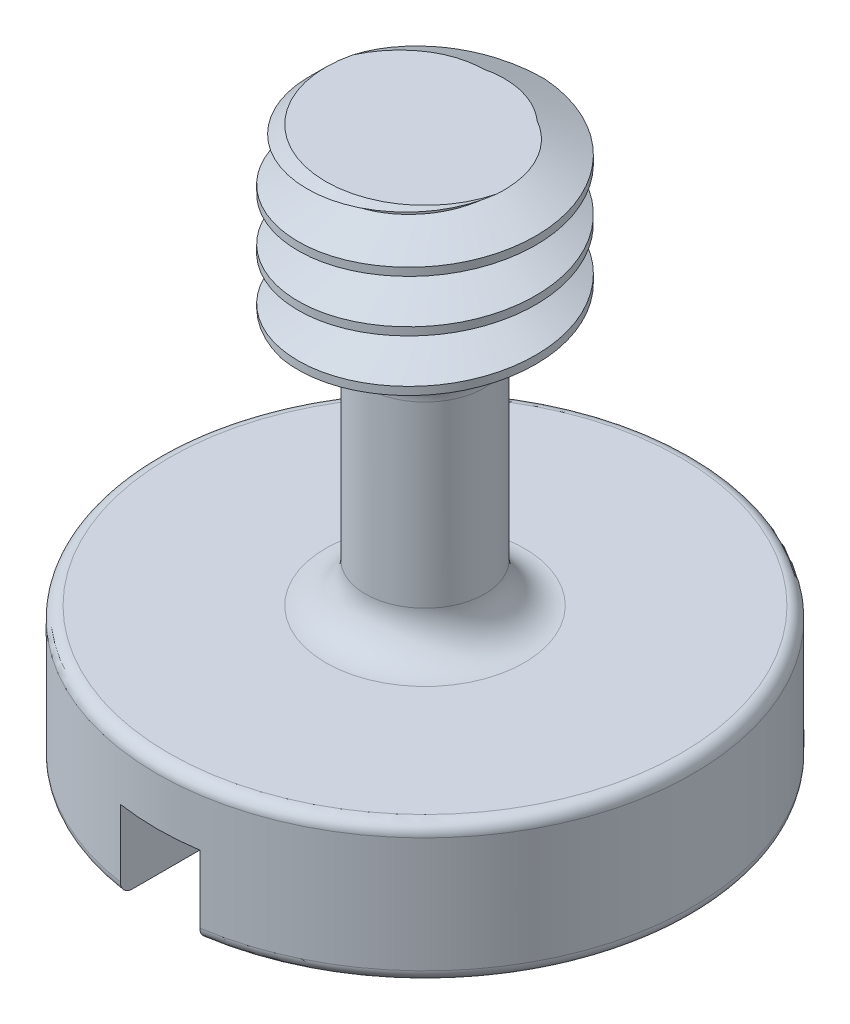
ISO-10303-21;
HEADER;
FILE_DESCRIPTION(('STEP AP214'),'2;1');
FILE_NAME('part.step','',(''),(''),'','','');
FILE_SCHEMA(('AUTOMOTIVE_DESIGN { 1 0 10303 214 1 1 1 1 }'));
ENDSEC;
DATA;
#1=APPLICATION_CONTEXT('core data for automotive mechanical design processes');
#2=APPLICATION_PROTOCOL_DEFINITION('international standard','automotive_design',2000,#1);
#3=PRODUCT_CONTEXT('',#1,'mechanical');
#4=PRODUCT('Part','Part','',(#3));
#5=PRODUCT_RELATED_PRODUCT_CATEGORY('part','',(#4));
#6=PRODUCT_DEFINITION_FORMATION('','',#4);
#7=PRODUCT_DEFINITION_CONTEXT('part definition',#1,'design');
#8=PRODUCT_DEFINITION('design','',#6,#7);
#9=PRODUCT_DEFINITION_SHAPE('','',#8);
#10=(LENGTH_UNIT() NAMED_UNIT(*) SI_UNIT(.MILLI.,.METRE.));
#11=(NAMED_UNIT(*) PLANE_ANGLE_UNIT() SI_UNIT($,.RADIAN.));
#12=(NAMED_UNIT(*) SI_UNIT($,.STERADIAN.) SOLID_ANGLE_UNIT());
#13=UNCERTAINTY_MEASURE_WITH_UNIT(LENGTH_MEASURE(1.E-05),#10,'distance_accuracy_value','');
#14=(GEOMETRIC_REPRESENTATION_CONTEXT(3) GLOBAL_UNCERTAINTY_ASSIGNED_CONTEXT((#13)) GLOBAL_UNIT_ASSIGNED_CONTEXT((#10,
#11,#12)) REPRESENTATION_CONTEXT('',''));
#15=CARTESIAN_POINT('',(0.,0.,0.));
#16=DIRECTION('',(0.,0.,1.));
#17=DIRECTION('',(1.,0.,0.));
#18=AXIS2_PLACEMENT_3D('',#15,#16,#17);
#19=CARTESIAN_POINT('',(0.,0.,0.));
#20=DIRECTION('',(0.,-1.,0.));
#21=DIRECTION('',(0.,0.,-1.));
#22=AXIS2_PLACEMENT_3D('',#19,#20,#21);
#23=PLANE('',#22);
#24=DIRECTION('',(0.,0.,1.));
#25=VECTOR('',#24,1.);
#26=CARTESIAN_POINT('',(1.,0.,6.75));
#27=LINE('',#26,#25);
#28=CARTESIAN_POINT('',(1.,0.,-6.37200910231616));
#29=VERTEX_POINT('',#28);
#30=CARTESIAN_POINT('',(1.,0.,6.37200910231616));
#31=VERTEX_POINT('',#30);
#32=EDGE_CURVE('E254',#29,#31,#27,.T.);
#33=ORIENTED_EDGE('',*,*,#32,.F.);
#34=CARTESIAN_POINT('',(0.,0.,0.));
#35=DIRECTION('',(0.,-1.,0.));
#36=DIRECTION('',(0.,0.,-1.));
#37=AXIS2_PLACEMENT_3D('',#34,#35,#36);
#38=CIRCLE('',#37,6.45);
#39=EDGE_CURVE('E286',#29,#31,#38,.T.);
#40=ORIENTED_EDGE('',*,*,#39,.T.);
#41=EDGE_LOOP('',(#33,#40));
#42=FACE_BOUND('',#41,.T.);
#43=ADVANCED_FACE('F40',(#42),#23,.T.);
#44=CARTESIAN_POINT('',(0.,0.3,0.));
#45=DIRECTION('',(0.,-1.,0.));
#46=DIRECTION('',(0.,0.,-1.));
#47=AXIS2_PLACEMENT_3D('',#44,#45,#46);
#48=TOROIDAL_SURFACE('',#47,6.45,0.3);
#49=CARTESIAN_POINT('',(1.,0.154112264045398,-6.63722891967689));
#50=CARTESIAN_POINT('',(1.,0.139356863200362,-6.62892352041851));
#51=CARTESIAN_POINT('',(1.,0.125297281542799,-6.6193551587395));
#52=CARTESIAN_POINT('',(1.,0.0989784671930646,-6.59797884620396));
#53=CARTESIAN_POINT('',(1.,0.0867216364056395,-6.58616795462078));
#54=CARTESIAN_POINT('',(1.,0.0643699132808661,-6.56067133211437));
#55=CARTESIAN_POINT('',(1.,0.0542729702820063,-6.54698739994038));
#56=CARTESIAN_POINT('',(1.,0.036500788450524,-6.51813443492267));
#57=CARTESIAN_POINT('',(1.,0.0288249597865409,-6.50296576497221));
#58=CARTESIAN_POINT('',(1.,0.0160381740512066,-6.4714363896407));
#59=CARTESIAN_POINT('',(1.,0.0109490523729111,-6.45506682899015));
#60=CARTESIAN_POINT('',(1.,0.00356403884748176,-6.42170850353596));
#61=CARTESIAN_POINT('',(1.,0.00126841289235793,-6.40471967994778));
#62=CARTESIAN_POINT('',(1.,-0.000478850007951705,-6.37044555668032));
#63=CARTESIAN_POINT('',(1.,9.4801170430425E-05,-6.35315896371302));
#64=CARTESIAN_POINT('',(1.,0.00412790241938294,-6.31892537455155));
#65=CARTESIAN_POINT('',(1.,0.00758742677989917,-6.30197838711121));
#66=CARTESIAN_POINT('',(1.,0.0173125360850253,-6.26886210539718));
#67=CARTESIAN_POINT('',(1.,0.0235852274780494,-6.25269489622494));
#68=CARTESIAN_POINT('',(1.,0.0387701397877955,-6.22165100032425));
#69=CARTESIAN_POINT('',(1.,0.0476823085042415,-6.20677428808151));
#70=CARTESIAN_POINT('',(1.,0.0678476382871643,-6.17882545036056));
#71=CARTESIAN_POINT('',(1.,0.0790877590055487,-6.16574392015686));
#72=CARTESIAN_POINT('',(1.,0.103627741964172,-6.1416807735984));
#73=CARTESIAN_POINT('',(1.,0.116927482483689,-6.13069903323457));
#74=CARTESIAN_POINT('',(1.,0.145046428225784,-6.111284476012));
#75=CARTESIAN_POINT('',(1.,0.159846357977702,-6.10282374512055));
#76=CARTESIAN_POINT('',(1.,0.190669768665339,-6.08854301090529));
#77=CARTESIAN_POINT('',(1.,0.206693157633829,-6.08272280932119));
#78=CARTESIAN_POINT('',(1.,0.239296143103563,-6.07395985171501));
#79=CARTESIAN_POINT('',(1.,0.255866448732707,-6.07098251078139));
#80=CARTESIAN_POINT('',(1.,0.289271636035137,-6.06787399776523));
#81=CARTESIAN_POINT('',(1.,0.306106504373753,-6.06774268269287));
#82=CARTESIAN_POINT('',(1.,0.33943715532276,-6.07032082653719));
#83=CARTESIAN_POINT('',(1.,0.355934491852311,-6.07301026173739));
#84=CARTESIAN_POINT('',(1.,0.388244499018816,-6.08111622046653));
#85=CARTESIAN_POINT('',(1.,0.404057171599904,-6.08653273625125));
#86=CARTESIAN_POINT('',(1.,0.43458229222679,-6.09994045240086));
#87=CARTESIAN_POINT('',(1.,0.449292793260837,-6.10793608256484));
#88=CARTESIAN_POINT('',(1.,0.477179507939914,-6.12626132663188));
#89=CARTESIAN_POINT('',(1.,0.490355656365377,-6.1365910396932));
#90=CARTESIAN_POINT('',(1.,0.514936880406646,-6.15939319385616));
#91=CARTESIAN_POINT('',(1.,0.526323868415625,-6.17188512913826));
#92=CARTESIAN_POINT('',(1.,0.546870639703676,-6.19858275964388));
#93=CARTESIAN_POINT('',(1.,0.556030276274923,-6.21278856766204));
#94=CARTESIAN_POINT('',(1.,0.571983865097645,-6.24270349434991));
#95=CARTESIAN_POINT('',(1.,0.578746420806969,-6.25842935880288));
#96=CARTESIAN_POINT('',(1.,0.589564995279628,-6.29078610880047));
#97=CARTESIAN_POINT('',(1.,0.593620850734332,-6.30741704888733));
#98=CARTESIAN_POINT('',(1.,0.598946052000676,-6.34128871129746));
#99=CARTESIAN_POINT('',(1.,0.600187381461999,-6.35853384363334));
#100=CARTESIAN_POINT('',(1.,0.599766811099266,-6.39298901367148));
#101=CARTESIAN_POINT('',(1.,0.598104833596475,-6.41019905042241));
#102=CARTESIAN_POINT('',(1.,0.591910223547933,-6.44414762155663));
#103=CARTESIAN_POINT('',(1.,0.587369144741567,-6.46088461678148));
#104=CARTESIAN_POINT('',(1.,0.575528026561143,-6.49335297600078));
#105=CARTESIAN_POINT('',(1.,0.5682280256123,-6.5090843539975));
#106=CARTESIAN_POINT('',(1.,0.551108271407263,-6.53900906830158));
#107=CARTESIAN_POINT('',(1.,0.541300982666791,-6.5532095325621));
#108=CARTESIAN_POINT('',(1.,0.519418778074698,-6.57974073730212));
#109=CARTESIAN_POINT('',(1.,0.507343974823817,-6.59207157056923));
#110=CARTESIAN_POINT('',(1.,0.481399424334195,-6.6143781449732));
#111=CARTESIAN_POINT('',(1.,0.46754913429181,-6.62437651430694));
#112=CARTESIAN_POINT('',(1.,0.438352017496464,-6.64187525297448));
#113=CARTESIAN_POINT('',(1.,0.423005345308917,-6.64937587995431));
#114=CARTESIAN_POINT('',(1.,0.391433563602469,-6.66158183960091));
#115=CARTESIAN_POINT('',(1.,0.375220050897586,-6.66631717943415));
#116=CARTESIAN_POINT('',(1.,0.342221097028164,-6.67297719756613));
#117=CARTESIAN_POINT('',(1.,0.32543553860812,-6.67490129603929));
#118=CARTESIAN_POINT('',(1.,0.29189775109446,-6.67587542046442));
#119=CARTESIAN_POINT('',(1.,0.275146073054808,-6.67494492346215));
#120=CARTESIAN_POINT('',(1.,0.242052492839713,-6.67028005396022));
#121=CARTESIAN_POINT('',(1.,0.225710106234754,-6.66654917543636));
#122=CARTESIAN_POINT('',(1.,0.20014138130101,-6.6584002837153));
#123=CARTESIAN_POINT('',(1.,0.190637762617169,-6.65482554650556));
#124=CARTESIAN_POINT('',(1.,0.172043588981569,-6.64672797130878));
#125=CARTESIAN_POINT('',(1.,0.162953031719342,-6.64220513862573));
#126=CARTESIAN_POINT('',(1.,0.154112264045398,-6.63722891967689));
#127=B_SPLINE_CURVE_WITH_KNOTS('',3,(#49,#50,#51,#52,#53,#54,#55,#56,#57,#58,#59,#60,#61,#62,
#63,#64,#65,#66,#67,#68,#69,#70,#71,#72,#73,#74,#75,#76,#77,#78,#79,#80,#81,#82,#83,#84,#85,#86,
#87,#88,#89,#90,#91,#92,#93,#94,#95,#96,#97,#98,#99,#100,#101,#102,#103,#104,#105,#106,#107,
#108,#109,#110,#111,#112,#113,#114,#115,#116,#117,#118,#119,#120,#121,#122,#123,#124,#125,#126),
.UNSPECIFIED.,.T.,.F.,(4,2,2,2,2,2,2,2,2,2,2,2,2,2,2,2,2,2,2,2,2,2,2,2,2,2,2,2,2,2,2,2,2,2,2,2,
2,2,4),(0.,0.0507592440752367,0.101585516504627,0.152363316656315,0.203128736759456,
0.254315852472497,0.305507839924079,0.357151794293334,0.408797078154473,0.460573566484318,
0.512349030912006,0.563841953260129,0.615331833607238,0.666228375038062,0.717121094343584,
0.76738647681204,0.81764933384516,0.867557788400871,0.917466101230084,0.967460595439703,
1.0174572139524,1.06793061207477,1.11840733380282,1.16952268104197,1.22064111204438,
1.27226619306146,1.32389265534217,1.37567127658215,1.42744917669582,1.47897451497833,
1.53049729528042,1.58149725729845,1.63249195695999,1.68292248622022,1.73336341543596,
1.78346095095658,1.83349608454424,1.86390889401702,1.89432153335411),.UNSPECIFIED.);
#128=CARTESIAN_POINT('',(1.,0.3,-6.67551496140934));
#129=VERTEX_POINT('',#128);
#130=EDGE_CURVE('E347',#129,#29,#127,.T.);
#131=ORIENTED_EDGE('',*,*,#130,.F.);
#132=CARTESIAN_POINT('',(0.,0.3,0.));
#133=DIRECTION('',(0.,-1.,0.));
#134=DIRECTION('',(0.,0.,-1.));
#135=AXIS2_PLACEMENT_3D('',#132,#133,#134);
#136=CIRCLE('',#135,6.75);
#137=CARTESIAN_POINT('',(1.,0.3,6.67551496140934));
#138=VERTEX_POINT('',#137);
#139=EDGE_CURVE('E292',#138,#129,#136,.F.);
#140=ORIENTED_EDGE('',*,*,#139,.F.);
#141=CARTESIAN_POINT('',(1.,0.184182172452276,6.09172489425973));
#142=CARTESIAN_POINT('',(1.,0.168636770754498,6.09831866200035));
#143=CARTESIAN_POINT('',(1.,0.153641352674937,6.10624268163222));
#144=CARTESIAN_POINT('',(1.,0.125187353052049,6.12451112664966));
#145=CARTESIAN_POINT('',(1.,0.111730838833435,6.13485875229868));
#146=CARTESIAN_POINT('',(1.,0.0867530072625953,6.15765038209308));
#147=CARTESIAN_POINT('',(1.,0.0752297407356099,6.17009224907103));
#148=CARTESIAN_POINT('',(1.,0.0544158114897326,6.19671433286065));
#149=CARTESIAN_POINT('',(1.,0.0451246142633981,6.21089413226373));
#150=CARTESIAN_POINT('',(1.,0.0289380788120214,6.2407339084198));
#151=CARTESIAN_POINT('',(1.,0.0220660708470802,6.25640654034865));
#152=CARTESIAN_POINT('',(1.,0.0110206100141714,6.28867630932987));
#153=CARTESIAN_POINT('',(1.,0.00684742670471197,6.30527353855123));
#154=CARTESIAN_POINT('',(1.,0.00128152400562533,6.33909933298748));
#155=CARTESIAN_POINT('',(1.,-8.289732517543E-05,6.35633255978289));
#156=CARTESIAN_POINT('',(1.,9.07086313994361E-05,6.39078472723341));
#157=CARTESIAN_POINT('',(1.,0.00162881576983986,6.40800366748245));
#158=CARTESIAN_POINT('',(1.,0.00757833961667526,6.44199386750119));
#159=CARTESIAN_POINT('',(1.,0.0119987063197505,6.45876356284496));
#160=CARTESIAN_POINT('',(1.,0.0236051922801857,6.49131734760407));
#161=CARTESIAN_POINT('',(1.,0.0307912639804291,6.50710145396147));
#162=CARTESIAN_POINT('',(1.,0.0476950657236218,6.53715253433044));
#163=CARTESIAN_POINT('',(1.,0.057400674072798,6.55142632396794));
#164=CARTESIAN_POINT('',(1.,0.0790932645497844,6.57812052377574));
#165=CARTESIAN_POINT('',(1.,0.0910801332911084,6.59054102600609));
#166=CARTESIAN_POINT('',(1.,0.116866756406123,6.61304038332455));
#167=CARTESIAN_POINT('',(1.,0.130646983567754,6.62314161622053));
#168=CARTESIAN_POINT('',(1.,0.159723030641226,6.64085681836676));
#169=CARTESIAN_POINT('',(1.,0.1750187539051,6.64847094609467));
#170=CARTESIAN_POINT('',(1.,0.206510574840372,6.66090974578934));
#171=CARTESIAN_POINT('',(1.,0.222694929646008,6.66576415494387));
#172=CARTESIAN_POINT('',(1.,0.255651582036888,6.67266418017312));
#173=CARTESIAN_POINT('',(1.,0.272423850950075,6.67470993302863));
#174=CARTESIAN_POINT('',(1.,0.305947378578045,6.67592568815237));
#175=CARTESIAN_POINT('',(1.,0.322697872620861,6.67511688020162));
#176=CARTESIAN_POINT('',(1.,0.355824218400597,6.67069515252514));
#177=CARTESIAN_POINT('',(1.,0.372200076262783,6.66708227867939));
#178=CARTESIAN_POINT('',(1.,0.4040970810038,6.65716640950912));
#179=CARTESIAN_POINT('',(1.,0.41961908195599,6.65086615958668));
#180=CARTESIAN_POINT('',(1.,0.449393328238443,6.63576337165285));
#181=CARTESIAN_POINT('',(1.,0.463645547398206,6.62696078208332));
#182=CARTESIAN_POINT('',(1.,0.490565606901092,6.60705426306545));
#183=CARTESIAN_POINT('',(1.,0.503223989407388,6.59593754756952));
#184=CARTESIAN_POINT('',(1.,0.526517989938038,6.57175609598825));
#185=CARTESIAN_POINT('',(1.,0.537153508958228,6.55869126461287));
#186=CARTESIAN_POINT('',(1.,0.556217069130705,6.53084261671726));
#187=CARTESIAN_POINT('',(1.,0.56462142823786,6.51604259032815));
#188=CARTESIAN_POINT('',(1.,0.578856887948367,6.4852529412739));
#189=CARTESIAN_POINT('',(1.,0.584687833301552,6.46926324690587));
#190=CARTESIAN_POINT('',(1.,0.593674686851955,6.43636227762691));
#191=CARTESIAN_POINT('',(1.,0.596800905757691,6.41944289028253));
#192=CARTESIAN_POINT('',(1.,0.600190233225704,6.38531955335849));
#193=CARTESIAN_POINT('',(1.,0.6004532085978,6.36811559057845));
#194=CARTESIAN_POINT('',(1.,0.598102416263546,6.33378425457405));
#195=CARTESIAN_POINT('',(1.,0.595468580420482,6.31665825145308));
#196=CARTESIAN_POINT('',(1.,0.587362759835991,6.28309106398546));
#197=CARTESIAN_POINT('',(1.,0.581890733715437,6.266649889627));
#198=CARTESIAN_POINT('',(1.,0.568256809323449,6.23492814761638));
#199=CARTESIAN_POINT('',(1.,0.560095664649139,6.21964725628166));
#200=CARTESIAN_POINT('',(1.,0.541304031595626,6.19068708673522));
#201=CARTESIAN_POINT('',(1.,0.530673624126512,6.17700775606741));
#202=CARTESIAN_POINT('',(1.,0.507331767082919,6.15176093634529));
#203=CARTESIAN_POINT('',(1.,0.49463768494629,6.14017739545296));
#204=CARTESIAN_POINT('',(1.,0.467464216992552,6.11933891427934));
#205=CARTESIAN_POINT('',(1.,0.452985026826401,6.11008371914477));
#206=CARTESIAN_POINT('',(1.,0.422847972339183,6.09428840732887));
#207=CARTESIAN_POINT('',(1.,0.40720730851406,6.08771546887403));
#208=CARTESIAN_POINT('',(1.,0.375032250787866,6.07732071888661));
#209=CARTESIAN_POINT('',(1.,0.358497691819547,6.07349941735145));
#210=CARTESIAN_POINT('',(1.,0.325198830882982,6.06875506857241));
#211=CARTESIAN_POINT('',(1.,0.308438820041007,6.0678017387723));
#212=CARTESIAN_POINT('',(1.,0.275013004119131,6.06873874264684));
#213=CARTESIAN_POINT('',(1.,0.258347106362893,6.07062546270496));
#214=CARTESIAN_POINT('',(1.,0.232066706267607,6.07587515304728));
#215=CARTESIAN_POINT('',(1.,0.222268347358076,6.0783600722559));
#216=CARTESIAN_POINT('',(1.,0.202975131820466,6.08431299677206));
#217=CARTESIAN_POINT('',(1.,0.193480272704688,6.0877809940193));
#218=CARTESIAN_POINT('',(1.,0.184182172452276,6.09172489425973));
#219=B_SPLINE_CURVE_WITH_KNOTS('',3,(#141,#142,#143,#144,#145,#146,#147,#148,#149,#150,#151,
#152,#153,#154,#155,#156,#157,#158,#159,#160,#161,#162,#163,#164,#165,#166,#167,#168,#169,#170,
#171,#172,#173,#174,#175,#176,#177,#178,#179,#180,#181,#182,#183,#184,#185,#186,#187,#188,#189,
#190,#191,#192,#193,#194,#195,#196,#197,#198,#199,#200,#201,#202,#203,#204,#205,#206,#207,#208,
#209,#210,#211,#212,#213,#214,#215,#216,#217,#218),.UNSPECIFIED.,.T.,.F.,(4,2,2,2,2,2,2,2,2,2,2,
2,2,2,2,2,2,2,2,2,2,2,2,2,2,2,2,2,2,2,2,2,2,2,2,2,2,2,4),(0.,0.0506205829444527,
0.101308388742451,0.15194477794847,0.202569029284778,0.253668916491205,0.304773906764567,
0.356391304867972,0.408010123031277,0.459789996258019,0.51156897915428,0.563103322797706,
0.614635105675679,0.665646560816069,0.716654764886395,0.767102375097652,0.817547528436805,
0.867619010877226,0.917689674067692,0.967709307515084,1.01772997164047,1.06803471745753,
1.11834192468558,1.16916349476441,1.21998813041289,1.2713638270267,1.32274191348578,
1.37447818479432,1.42621521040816,1.47793774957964,1.52965859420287,1.580964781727,
1.6322653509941,1.68291785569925,1.73357974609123,1.78370479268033,1.83376611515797,
1.86404382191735,1.89432128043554),.UNSPECIFIED.);
#220=EDGE_CURVE('E349',#31,#138,#219,.T.);
#221=ORIENTED_EDGE('',*,*,#220,.F.);
#222=ORIENTED_EDGE('',*,*,#39,.F.);
#223=EDGE_LOOP('',(#131,#140,#221,#222));
#224=FACE_BOUND('',#223,.T.);
#225=ADVANCED_FACE('F335',(#224),#48,.T.);
#226=CARTESIAN_POINT('',(0.,14.,0.));
#227=DIRECTION('',(0.,1.,0.));
#228=DIRECTION('',(0.,0.,1.));
#229=AXIS2_PLACEMENT_3D('',#226,#227,#228);
#230=PLANE('',#229);
#231=CARTESIAN_POINT('',(-2.53,14.,-0.337781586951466));
#232=CARTESIAN_POINT('',(-2.50948082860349,14.,-0.401975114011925));
#233=CARTESIAN_POINT('',(-2.48628432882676,14.,-0.465267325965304));
#234=CARTESIAN_POINT('',(-2.43465469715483,14.,-0.589688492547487));
#235=CARTESIAN_POINT('',(-2.40622083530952,14.,-0.650817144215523));
#236=CARTESIAN_POINT('',(-2.31317542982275,14.,-0.83053418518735));
#237=CARTESIAN_POINT('',(-2.24087003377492,14.,-0.945297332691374));
#238=CARTESIAN_POINT('',(-2.11887995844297,14.,-1.10677706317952));
#239=CARTESIAN_POINT('',(-2.07598485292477,14.,-1.15880395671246));
#240=CARTESIAN_POINT('',(-1.98591570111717,14.,-1.25907777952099));
#241=CARTESIAN_POINT('',(-1.93874085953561,14.,-1.30732400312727));
#242=CARTESIAN_POINT('',(-1.86507004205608,14.,-1.37653655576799));
#243=CARTESIAN_POINT('',(-1.84003181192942,14.,-1.39907853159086));
#244=CARTESIAN_POINT('',(-1.78902203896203,14.,-1.44308721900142));
#245=CARTESIAN_POINT('',(-1.76305046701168,14.,-1.46455389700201));
#246=CARTESIAN_POINT('',(-1.7102203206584,14.,-1.50635521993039));
#247=CARTESIAN_POINT('',(-1.68336188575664,14.,-1.52669004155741));
#248=CARTESIAN_POINT('',(-1.62883299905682,14.,-1.56624003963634));
#249=CARTESIAN_POINT('',(-1.60116258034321,14.,-1.58545526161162));
#250=CARTESIAN_POINT('',(-1.54492642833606,14.,-1.62255252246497));
#251=CARTESIAN_POINT('',(-1.51636044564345,14.,-1.6404341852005));
#252=CARTESIAN_POINT('',(-1.45838032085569,14.,-1.67475816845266));
#253=CARTESIAN_POINT('',(-1.42896618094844,14.,-1.69120049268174));
#254=CARTESIAN_POINT('',(-1.33955985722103,14.,-1.73832384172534));
#255=CARTESIAN_POINT('',(-1.27839042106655,14.,-1.76681005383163));
#256=CARTESIAN_POINT('',(-1.15366051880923,14.,-1.81753482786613));
#257=CARTESIAN_POINT('',(-1.09010475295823,14.,-1.83978500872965));
#258=CARTESIAN_POINT('',(-0.961121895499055,14.,-1.87786823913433));
#259=CARTESIAN_POINT('',(-0.895695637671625,14.,-1.89370410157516));
#260=CARTESIAN_POINT('',(-0.772006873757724,14.,-1.9171908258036));
#261=CARTESIAN_POINT('',(-0.713892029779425,14.,-1.92562673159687));
#262=CARTESIAN_POINT('',(-0.597216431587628,14.,-1.93740827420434));
#263=CARTESIAN_POINT('',(-0.538656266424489,14.,-1.94075974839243));
#264=CARTESIAN_POINT('',(-0.480055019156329,14.,-1.94154330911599));
#265=B_SPLINE_CURVE_WITH_KNOTS('',3,(#231,#232,#233,#234,#235,#236,#237,#238,#239,#240,#241,
#242,#243,#244,#245,#246,#247,#248,#249,#250,#251,#252,#253,#254,#255,#256,#257,#258,#259,#260,
#261,#262,#263,#264),.UNSPECIFIED.,.F.,.F.,(4,2,2,2,2,2,2,2,2,2,2,2,2,2,2,2,4),(0.,
0.202032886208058,0.4040939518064,0.80870246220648,1.01081479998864,1.21296477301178,
1.31401330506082,1.41506499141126,1.51610085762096,1.6171326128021,1.71819275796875,
1.8192526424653,2.02132463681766,2.22301759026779,2.42462199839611,2.60057584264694,
2.77632752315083),.UNSPECIFIED.);
#266=CARTESIAN_POINT('',(-2.42449232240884,14.,-0.60978437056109));
#267=VERTEX_POINT('',#266);
#268=CARTESIAN_POINT('',(-0.480055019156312,14.,-1.941543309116));
#269=VERTEX_POINT('',#268);
#270=EDGE_CURVE('E243',#267,#269,#265,.T.);
#271=ORIENTED_EDGE('',*,*,#270,.F.);
#272=CARTESIAN_POINT('',(0.,14.,0.));
#273=DIRECTION('',(0.,1.,0.));
#274=DIRECTION('',(0.,0.,1.));
#275=AXIS2_PLACEMENT_3D('',#272,#273,#274);
#276=CIRCLE('',#275,2.5);
#277=CARTESIAN_POINT('',(2.42450271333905,14.,0.609743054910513));
#278=VERTEX_POINT('',#277);
#279=EDGE_CURVE('E157',#267,#278,#276,.T.);
#280=ORIENTED_EDGE('',*,*,#279,.T.);
#281=CARTESIAN_POINT('',(1.32637429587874,14.,-1.49692166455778));
#282=CARTESIAN_POINT('',(1.33720724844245,14.,-1.49092640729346));
#283=CARTESIAN_POINT('',(1.34798141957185,14.,-1.48482479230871));
#284=CARTESIAN_POINT('',(1.36940290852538,14.,-1.47240470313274));
#285=CARTESIAN_POINT('',(1.38005023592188,14.,-1.46608624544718));
#286=CARTESIAN_POINT('',(1.41178639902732,14.,-1.44680048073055));
#287=CARTESIAN_POINT('',(1.43267359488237,14.,-1.43350047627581));
#288=CARTESIAN_POINT('',(1.47396322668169,14.,-1.4061841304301));
#289=CARTESIAN_POINT('',(1.49436580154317,14.,-1.39216799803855));
#290=CARTESIAN_POINT('',(1.53468030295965,14.,-1.3634455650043));
#291=CARTESIAN_POINT('',(1.55459219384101,14.,-1.34873921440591));
#292=CARTESIAN_POINT('',(1.61359841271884,14.,-1.30356749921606));
#293=CARTESIAN_POINT('',(1.65191905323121,14.,-1.27207873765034));
#294=CARTESIAN_POINT('',(1.7262974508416,14.,-1.2065439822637));
#295=CARTESIAN_POINT('',(1.76235481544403,14.,-1.17249754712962));
#296=CARTESIAN_POINT('',(1.87917206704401,14.,-1.05429926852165));
#297=CARTESIAN_POINT('',(1.95448095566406,14.,-0.964622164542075));
#298=CARTESIAN_POINT('',(2.08958744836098,14.,-0.7743559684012));
#299=CARTESIAN_POINT('',(2.14939368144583,14.,-0.673772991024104));
#300=CARTESIAN_POINT('',(2.22748988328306,14.,-0.514577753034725));
#301=CARTESIAN_POINT('',(2.25195083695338,14.,-0.458916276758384));
#302=CARTESIAN_POINT('',(2.29613487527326,14.,-0.345744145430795));
#303=CARTESIAN_POINT('',(2.31585879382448,14.,-0.288233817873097));
#304=CARTESIAN_POINT('',(2.35048239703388,14.,-0.171715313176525));
#305=CARTESIAN_POINT('',(2.36537763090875,14.,-0.112705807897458));
#306=CARTESIAN_POINT('',(2.38395540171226,14.,-0.0234207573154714));
#307=CARTESIAN_POINT('',(2.3895211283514,14.,0.00647473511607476));
#308=CARTESIAN_POINT('',(2.39957105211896,14.,0.0664515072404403));
#309=CARTESIAN_POINT('',(2.40405502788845,14.,0.0965328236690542));
#310=CARTESIAN_POINT('',(2.41609956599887,14.,0.188715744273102));
#311=CARTESIAN_POINT('',(2.42190328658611,14.,0.2510590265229));
#312=CARTESIAN_POINT('',(2.42887135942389,14.,0.375996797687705));
#313=CARTESIAN_POINT('',(2.43003446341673,14.,0.438591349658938));
#314=CARTESIAN_POINT('',(2.42652518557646,14.,0.626246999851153));
#315=CARTESIAN_POINT('',(2.41486705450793,14.,0.75127863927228));
#316=CARTESIAN_POINT('',(2.38222671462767,14.,0.944687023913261));
#317=CARTESIAN_POINT('',(2.3674514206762,14.,1.01419623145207));
#318=CARTESIAN_POINT('',(2.33210534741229,14.,1.15175836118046));
#319=CARTESIAN_POINT('',(2.3115336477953,14.,1.21981105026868));
#320=CARTESIAN_POINT('',(2.26475125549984,14.,1.35394595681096));
#321=CARTESIAN_POINT('',(2.2385404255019,14.,1.4200281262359));
#322=CARTESIAN_POINT('',(2.18067925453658,14.,1.54974856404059));
#323=CARTESIAN_POINT('',(2.14903010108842,14.,1.61338736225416));
#324=CARTESIAN_POINT('',(2.08047557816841,14.,1.73792178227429));
#325=CARTESIAN_POINT('',(2.04356086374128,14.,1.79881226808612));
#326=CARTESIAN_POINT('',(1.96472384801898,14.,1.91727193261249));
#327=CARTESIAN_POINT('',(1.9227999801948,14.,1.97484006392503));
#328=CARTESIAN_POINT('',(1.83490108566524,14.,2.08674941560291));
#329=CARTESIAN_POINT('',(1.78892729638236,14.,2.14109161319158));
#330=CARTESIAN_POINT('',(1.69310268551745,14.,2.2462106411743));
#331=CARTESIAN_POINT('',(1.64325364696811,14.,2.2969890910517));
#332=CARTESIAN_POINT('',(1.55731068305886,14.,2.37831468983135));
#333=CARTESIAN_POINT('',(1.52221936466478,14.,2.40992928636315));
#334=CARTESIAN_POINT('',(1.45061752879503,14.,2.47132925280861));
#335=CARTESIAN_POINT('',(1.41411062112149,14.,2.5011188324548));
#336=CARTESIAN_POINT('',(1.37689315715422,14.,2.53000000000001));
#337=B_SPLINE_CURVE_WITH_KNOTS('',3,(#281,#282,#283,#284,#285,#286,#287,#288,#289,#290,#291,
#292,#293,#294,#295,#296,#297,#298,#299,#300,#301,#302,#303,#304,#305,#306,#307,#308,#309,#310,
#311,#312,#313,#314,#315,#316,#317,#318,#319,#320,#321,#322,#323,#324,#325,#326,#327,#328,#329,
#330,#331,#332,#333,#334,#335,#336),.UNSPECIFIED.,.F.,.F.,(4,2,2,2,2,2,2,2,2,2,2,2,2,2,2,2,2,2,
2,2,2,2,2,2,2,2,2,4),(0.,0.0371432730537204,0.0742837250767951,0.148550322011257,
0.222795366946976,0.297045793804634,0.445705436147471,0.594390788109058,0.944040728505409,
1.29349562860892,1.47571017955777,1.65789263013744,1.84024253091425,1.93144967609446,
2.02267546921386,2.21031376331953,2.39800252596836,2.77308469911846,2.98606899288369,
3.19908712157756,3.4121104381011,3.62508729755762,3.83844694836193,4.0518734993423,
4.26523506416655,4.47849903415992,4.62014339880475,4.761447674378),.UNSPECIFIED.);
#338=CARTESIAN_POINT('',(1.32637429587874,14.,-1.49692166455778));
#339=VERTEX_POINT('',#338);
#340=EDGE_CURVE('E147',#339,#278,#337,.T.);
#341=ORIENTED_EDGE('',*,*,#340,.F.);
#342=CARTESIAN_POINT('',(-0.480055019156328,14.,-1.94154330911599));
#343=CARTESIAN_POINT('',(-0.414926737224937,14.,-1.95765123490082));
#344=CARTESIAN_POINT('',(-0.349015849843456,14.,-1.97046441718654));
#345=CARTESIAN_POINT('',(-0.216144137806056,14.,-1.98943042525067));
#346=CARTESIAN_POINT('',(-0.14918191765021,14.,-1.99557347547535));
#347=CARTESIAN_POINT('',(0.0302018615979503,14.,-2.00293135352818));
#348=CARTESIAN_POINT('',(0.142929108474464,14.,-1.99805915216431));
#349=CARTESIAN_POINT('',(0.366044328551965,14.,-1.9694487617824));
#350=CARTESIAN_POINT('',(0.476429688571,14.,-1.94569052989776));
#351=CARTESIAN_POINT('',(0.69167505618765,14.,-1.87997337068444));
#352=CARTESIAN_POINT('',(0.796533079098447,14.,-1.83800795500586));
#353=CARTESIAN_POINT('',(0.997588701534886,14.,-1.73708646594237));
#354=CARTESIAN_POINT('',(1.09380133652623,14.,-1.6781606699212));
#355=CARTESIAN_POINT('',(1.20883776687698,14.,-1.5936403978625));
#356=CARTESIAN_POINT('',(1.23298146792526,14.,-1.5750338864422));
#357=CARTESIAN_POINT('',(1.28035745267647,14.,-1.53676630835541));
#358=CARTESIAN_POINT('',(1.30359106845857,14.,-1.51710689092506));
#359=CARTESIAN_POINT('',(1.32637429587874,14.,-1.49692166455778));
#360=B_SPLINE_CURVE_WITH_KNOTS('',3,(#342,#343,#344,#345,#346,#347,#348,#349,#350,#351,#352,
#353,#354,#355,#356,#357,#358,#359),.UNSPECIFIED.,.F.,.F.,(4,2,2,2,2,2,2,2,4),(0.,
0.201125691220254,0.402545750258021,0.739337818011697,1.07648778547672,1.41375799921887,
1.75042981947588,1.841854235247,1.93313941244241),.UNSPECIFIED.);
#361=EDGE_CURVE('E136',#269,#339,#360,.T.);
#362=ORIENTED_EDGE('',*,*,#361,.F.);
#363=EDGE_LOOP('',(#271,#280,#341,#362));
#364=FACE_BOUND('',#363,.T.);
#365=ADVANCED_FACE('F155',(#364),#230,.T.);
#366=CARTESIAN_POINT('',(0.,0.,0.));
#367=DIRECTION('',(0.,-1.,0.));
#368=DIRECTION('',(0.,0.,-1.));
#369=AXIS2_PLACEMENT_3D('',#366,#367,#368);
#370=CYLINDRICAL_SURFACE('',#369,3.);
#371=CARTESIAN_POINT('',(0.,10.,0.));
#372=DIRECTION('',(0.,-1.,0.));
#373=DIRECTION('',(0.,0.,-1.));
#374=AXIS2_PLACEMENT_3D('',#371,#372,#373);
#375=CIRCLE('',#374,3.);
#376=CARTESIAN_POINT('',(-0.729448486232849,10.,2.90996588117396));
#377=VERTEX_POINT('',#376);
#378=CARTESIAN_POINT('',(-2.80490163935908,10.,1.06420078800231));
#379=VERTEX_POINT('',#378);
#380=EDGE_CURVE('E266',#377,#379,#375,.T.);
#381=ORIENTED_EDGE('',*,*,#380,.F.);
#382=CARTESIAN_POINT('',(-2.9999994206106,14.9251333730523,2.48260807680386E-08));
#383=CARTESIAN_POINT('',(-2.9999994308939,14.8438833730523,-1.24264042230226));
#384=CARTESIAN_POINT('',(-2.12131995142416,14.7626333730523,-2.12131991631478));
#385=CARTESIAN_POINT('',(-1.24264047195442,14.6813833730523,-2.99999941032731));
#386=CARTESIAN_POINT('',(-2.48260809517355E-08,14.6001333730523,-2.9999994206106));
#387=CARTESIAN_POINT('',(1.24264042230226,14.5188833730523,-2.9999994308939));
#388=CARTESIAN_POINT('',(2.12131991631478,14.4376333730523,-2.12131995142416));
#389=CARTESIAN_POINT('',(2.99999941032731,14.3563833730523,-1.24264047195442));
#390=CARTESIAN_POINT('',(2.9999994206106,14.2751333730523,-2.48260811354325E-08));
#391=CARTESIAN_POINT('',(2.99999943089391,14.1938833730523,1.24264042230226));
#392=CARTESIAN_POINT('',(2.12131995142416,14.1126333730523,2.12131991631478));
#393=CARTESIAN_POINT('',(1.24264047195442,14.0313833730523,2.9999994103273));
#394=CARTESIAN_POINT('',(2.48260813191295E-08,13.9501333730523,2.9999994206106));
#395=CARTESIAN_POINT('',(-1.24264042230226,13.8688833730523,2.9999994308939));
#396=CARTESIAN_POINT('',(-2.12131991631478,13.7876333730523,2.12131995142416));
#397=CARTESIAN_POINT('',(-2.9999994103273,13.7063833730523,1.24264047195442));
#398=CARTESIAN_POINT('',(-2.9999994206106,13.6251333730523,2.48260807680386E-08));
#399=CARTESIAN_POINT('',(-2.9999994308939,13.5438833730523,-1.24264042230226));
#400=CARTESIAN_POINT('',(-2.12131995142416,13.4626333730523,-2.12131991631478));
#401=CARTESIAN_POINT('',(-1.24264047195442,13.3813833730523,-2.99999941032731));
#402=CARTESIAN_POINT('',(-2.48260809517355E-08,13.3001333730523,-2.9999994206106));
#403=CARTESIAN_POINT('',(1.24264042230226,13.2188833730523,-2.9999994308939));
#404=CARTESIAN_POINT('',(2.12131991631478,13.1376333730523,-2.12131995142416));
#405=CARTESIAN_POINT('',(2.99999941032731,13.0563833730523,-1.24264047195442));
#406=CARTESIAN_POINT('',(2.9999994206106,12.9751333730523,-2.48260811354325E-08));
#407=CARTESIAN_POINT('',(2.99999943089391,12.8938833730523,1.24264042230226));
#408=CARTESIAN_POINT('',(2.12131995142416,12.8126333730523,2.12131991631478));
#409=CARTESIAN_POINT('',(1.24264047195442,12.7313833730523,2.9999994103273));
#410=CARTESIAN_POINT('',(2.48260813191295E-08,12.6501333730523,2.9999994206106));
#411=CARTESIAN_POINT('',(-1.24264042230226,12.5688833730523,2.9999994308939));
#412=CARTESIAN_POINT('',(-2.12131991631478,12.4876333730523,2.12131995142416));
#413=CARTESIAN_POINT('',(-2.9999994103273,12.4063833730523,1.24264047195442));
#414=CARTESIAN_POINT('',(-2.9999994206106,12.3251333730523,2.48260807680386E-08));
#415=CARTESIAN_POINT('',(-2.9999994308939,12.2438833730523,-1.24264042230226));
#416=CARTESIAN_POINT('',(-2.12131995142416,12.1626333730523,-2.12131991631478));
#417=CARTESIAN_POINT('',(-1.24264047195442,12.0813833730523,-2.99999941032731));
#418=CARTESIAN_POINT('',(-2.48260809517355E-08,12.0001333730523,-2.9999994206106));
#419=CARTESIAN_POINT('',(1.24264042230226,11.9188833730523,-2.9999994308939));
#420=CARTESIAN_POINT('',(2.12131991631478,11.8376333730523,-2.12131995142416));
#421=CARTESIAN_POINT('',(2.99999941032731,11.7563833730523,-1.24264047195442));
#422=CARTESIAN_POINT('',(2.9999994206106,11.6751333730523,-2.48260811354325E-08));
#423=CARTESIAN_POINT('',(2.99999943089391,11.5938833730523,1.24264042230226));
#424=CARTESIAN_POINT('',(2.12131995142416,11.5126333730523,2.12131991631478));
#425=CARTESIAN_POINT('',(1.24264047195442,11.4313833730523,2.9999994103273));
#426=CARTESIAN_POINT('',(2.48260813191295E-08,11.3501333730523,2.9999994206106));
#427=CARTESIAN_POINT('',(-1.24264042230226,11.2688833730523,2.9999994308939));
#428=CARTESIAN_POINT('',(-2.12131991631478,11.1876333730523,2.12131995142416));
#429=CARTESIAN_POINT('',(-2.9999994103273,11.1063833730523,1.24264047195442));
#430=CARTESIAN_POINT('',(-2.9999994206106,11.0251333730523,2.48260807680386E-08));
#431=CARTESIAN_POINT('',(-2.9999994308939,10.9438833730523,-1.24264042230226));
#432=CARTESIAN_POINT('',(-2.12131995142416,10.8626333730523,-2.12131991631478));
#433=CARTESIAN_POINT('',(-1.24264047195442,10.7813833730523,-2.99999941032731));
#434=CARTESIAN_POINT('',(-2.48260809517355E-08,10.7001333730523,-2.9999994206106));
#435=CARTESIAN_POINT('',(1.24264042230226,10.6188833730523,-2.9999994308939));
#436=CARTESIAN_POINT('',(2.12131991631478,10.5376333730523,-2.12131995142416));
#437=CARTESIAN_POINT('',(2.99999941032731,10.4563833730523,-1.24264047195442));
#438=CARTESIAN_POINT('',(2.9999994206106,10.3751333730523,-2.48260811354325E-08));
#439=CARTESIAN_POINT('',(2.99999943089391,10.2938833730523,1.24264042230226));
#440=CARTESIAN_POINT('',(2.12131995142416,10.2126333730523,2.12131991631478));
#441=CARTESIAN_POINT('',(1.24264047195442,10.1313833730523,2.9999994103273));
#442=CARTESIAN_POINT('',(2.48260813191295E-08,10.0501333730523,2.9999994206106));
#443=CARTESIAN_POINT('',(-1.24264042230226,9.96888337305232,2.9999994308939));
#444=CARTESIAN_POINT('',(-2.12131991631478,9.88763337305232,2.12131995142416));
#445=CARTESIAN_POINT('',(-2.9999994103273,9.80638337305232,1.24264047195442));
#446=CARTESIAN_POINT('',(-2.9999994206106,9.72513337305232,2.48260807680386E-08));
#447=CARTESIAN_POINT('',(-2.9999994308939,9.64388337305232,-1.24264042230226));
#448=CARTESIAN_POINT('',(-2.12131995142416,9.56263337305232,-2.12131991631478));
#449=CARTESIAN_POINT('',(-1.24264047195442,9.48138337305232,-2.99999941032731));
#450=CARTESIAN_POINT('',(-2.48260809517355E-08,9.40013337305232,-2.9999994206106));
#451=CARTESIAN_POINT('',(1.24264042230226,9.31888337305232,-2.9999994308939));
#452=CARTESIAN_POINT('',(2.12131991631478,9.23763337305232,-2.12131995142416));
#453=CARTESIAN_POINT('',(2.99999941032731,9.15638337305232,-1.24264047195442));
#454=CARTESIAN_POINT('',(2.9999994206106,9.07513337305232,-2.48260811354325E-08));
#455=CARTESIAN_POINT('',(2.99999943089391,8.99388337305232,1.24264042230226));
#456=CARTESIAN_POINT('',(2.12131995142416,8.91263337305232,2.12131991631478));
#457=CARTESIAN_POINT('',(1.24264047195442,8.83138337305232,2.9999994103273));
#458=CARTESIAN_POINT('',(2.48260813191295E-08,8.75013337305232,2.9999994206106));
#459=(BOUNDED_CURVE() B_SPLINE_CURVE(2,(#382,#383,#384,#385,#386,#387,#388,#389,#390,#391,#392,
#393,#394,#395,#396,#397,#398,#399,#400,#401,#402,#403,#404,#405,#406,#407,#408,#409,#410,#411,
#412,#413,#414,#415,#416,#417,#418,#419,#420,#421,#422,#423,#424,#425,#426,#427,#428,#429,#430,
#431,#432,#433,#434,#435,#436,#437,#438,#439,#440,#441,#442,#443,#444,#445,#446,#447,#448,#449,
#450,#451,#452,#453,#454,#455,#456,#457,#458),.UNSPECIFIED.,.F.,
.F.) B_SPLINE_CURVE_WITH_KNOTS((3,2,2,2,2,2,2,2,2,2,2,2,2,2,2,2,2,2,2,2,2,2,2,2,2,2,2,2,2,2,2,2,
2,2,2,2,2,2,3),(0.,0.025,0.05,0.075,0.1,0.125,0.15,0.175,0.2,0.225,0.25,0.275,0.3,0.325,0.35,
0.375,0.4,0.425,0.45,0.475,0.5,0.525,0.55,0.575,0.6,0.625,0.65,0.675,0.7,0.725,0.75,0.775,0.8,
0.825,0.85,0.875,0.9,0.925,0.95),
.UNSPECIFIED.) CURVE() GEOMETRIC_REPRESENTATION_ITEM() RATIONAL_B_SPLINE_CURVE((1.,
0.923879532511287,1.,0.923879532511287,1.,0.923879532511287,1.,0.923879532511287,1.,
0.923879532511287,1.,0.923879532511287,1.,0.923879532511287,1.,0.923879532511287,1.,
0.923879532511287,1.,0.923879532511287,1.,0.923879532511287,1.,0.923879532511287,1.,
0.923879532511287,1.,0.923879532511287,1.,0.923879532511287,1.,0.923879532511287,1.,
0.923879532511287,1.,0.923879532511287,1.,0.923879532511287,1.,0.923879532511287,1.,
0.923879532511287,1.,0.923879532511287,1.,0.923879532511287,1.,0.923879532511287,1.,
0.923879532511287,1.,0.923879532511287,1.,0.923879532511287,1.,0.923879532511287,1.,
0.923879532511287,1.,0.923879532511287,1.,0.923879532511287,1.,0.923879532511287,1.,
0.923879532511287,1.,0.923879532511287,1.,0.923879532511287,1.,0.923879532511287,1.,
0.923879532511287,1.,0.923879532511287,1.)) REPRESENTATION_ITEM(''));
#460=CARTESIAN_POINT('',(-2.47450080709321,13.5,-1.6961256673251));
#461=VERTEX_POINT('',#460);
#462=EDGE_CURVE('E203',#461,#377,#459,.T.);
#463=ORIENTED_EDGE('',*,*,#462,.F.);
#464=CARTESIAN_POINT('',(0.,13.5,0.));
#465=DIRECTION('',(0.,1.,0.));
#466=DIRECTION('',(0.,0.,1.));
#467=AXIS2_PLACEMENT_3D('',#464,#465,#466);
#468=CIRCLE('',#467,3.);
#469=CARTESIAN_POINT('',(0.0020395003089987,13.5,-2.99999872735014));
#470=VERTEX_POINT('',#469);
#471=EDGE_CURVE('E269',#461,#470,#468,.F.);
#472=ORIENTED_EDGE('',*,*,#471,.T.);
#473=CARTESIAN_POINT('',(-2.99999942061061,13.8251333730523,2.48260809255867E-08));
#474=CARTESIAN_POINT('',(-2.99999943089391,13.7438833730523,-1.24264042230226));
#475=CARTESIAN_POINT('',(-2.12131995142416,13.6626333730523,-2.12131991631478));
#476=CARTESIAN_POINT('',(-1.24264047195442,13.5813833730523,-2.99999941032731));
#477=CARTESIAN_POINT('',(-2.48260811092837E-08,13.5001333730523,-2.99999942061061));
#478=CARTESIAN_POINT('',(1.24264042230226,13.4188833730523,-2.99999943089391));
#479=CARTESIAN_POINT('',(2.12131991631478,13.3376333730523,-2.12131995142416));
#480=CARTESIAN_POINT('',(2.99999941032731,13.2563833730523,-1.24264047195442));
#481=CARTESIAN_POINT('',(2.99999942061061,13.1751333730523,-2.48260812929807E-08));
#482=CARTESIAN_POINT('',(2.99999943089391,13.0938833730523,1.24264042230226));
#483=CARTESIAN_POINT('',(2.12131995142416,13.0126333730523,2.12131991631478));
#484=CARTESIAN_POINT('',(1.24264047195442,12.9313833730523,2.99999941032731));
#485=CARTESIAN_POINT('',(2.48260814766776E-08,12.8501333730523,2.99999942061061));
#486=CARTESIAN_POINT('',(-1.24264042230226,12.7688833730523,2.9999994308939));
#487=CARTESIAN_POINT('',(-2.12131991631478,12.6876333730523,2.12131995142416));
#488=CARTESIAN_POINT('',(-2.99999941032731,12.6063833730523,1.24264047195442));
#489=CARTESIAN_POINT('',(-2.99999942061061,12.5251333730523,2.48260809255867E-08));
#490=CARTESIAN_POINT('',(-2.99999943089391,12.4438833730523,-1.24264042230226));
#491=CARTESIAN_POINT('',(-2.12131995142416,12.3626333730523,-2.12131991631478));
#492=CARTESIAN_POINT('',(-1.24264047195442,12.2813833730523,-2.99999941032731));
#493=CARTESIAN_POINT('',(-2.48260811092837E-08,12.2001333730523,-2.99999942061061));
#494=CARTESIAN_POINT('',(1.24264042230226,12.1188833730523,-2.99999943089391));
#495=CARTESIAN_POINT('',(2.12131991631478,12.0376333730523,-2.12131995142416));
#496=CARTESIAN_POINT('',(2.99999941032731,11.9563833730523,-1.24264047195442));
#497=CARTESIAN_POINT('',(2.99999942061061,11.8751333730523,-2.48260812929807E-08));
#498=CARTESIAN_POINT('',(2.99999943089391,11.7938833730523,1.24264042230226));
#499=CARTESIAN_POINT('',(2.12131995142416,11.7126333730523,2.12131991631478));
#500=CARTESIAN_POINT('',(1.24264047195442,11.6313833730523,2.99999941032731));
#501=CARTESIAN_POINT('',(2.48260814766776E-08,11.5501333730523,2.99999942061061));
#502=CARTESIAN_POINT('',(-1.24264042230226,11.4688833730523,2.9999994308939));
#503=CARTESIAN_POINT('',(-2.12131991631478,11.3876333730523,2.12131995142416));
#504=CARTESIAN_POINT('',(-2.99999941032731,11.3063833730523,1.24264047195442));
#505=CARTESIAN_POINT('',(-2.99999942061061,11.2251333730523,2.48260809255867E-08));
#506=CARTESIAN_POINT('',(-2.99999943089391,11.1438833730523,-1.24264042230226));
#507=CARTESIAN_POINT('',(-2.12131995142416,11.0626333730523,-2.12131991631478));
#508=CARTESIAN_POINT('',(-1.24264047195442,10.9813833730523,-2.99999941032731));
#509=CARTESIAN_POINT('',(-2.48260811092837E-08,10.9001333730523,-2.99999942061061));
#510=CARTESIAN_POINT('',(1.24264042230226,10.8188833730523,-2.99999943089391));
#511=CARTESIAN_POINT('',(2.12131991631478,10.7376333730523,-2.12131995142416));
#512=CARTESIAN_POINT('',(2.99999941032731,10.6563833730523,-1.24264047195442));
#513=CARTESIAN_POINT('',(2.99999942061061,10.5751333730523,-2.48260812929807E-08));
#514=CARTESIAN_POINT('',(2.99999943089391,10.4938833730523,1.24264042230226));
#515=CARTESIAN_POINT('',(2.12131995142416,10.4126333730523,2.12131991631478));
#516=CARTESIAN_POINT('',(1.24264047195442,10.3313833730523,2.99999941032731));
#517=CARTESIAN_POINT('',(2.48260814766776E-08,10.2501333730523,2.99999942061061));
#518=CARTESIAN_POINT('',(-1.24264042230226,10.1688833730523,2.9999994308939));
#519=CARTESIAN_POINT('',(-2.12131991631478,10.0876333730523,2.12131995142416));
#520=CARTESIAN_POINT('',(-2.99999941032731,10.0063833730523,1.24264047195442));
#521=CARTESIAN_POINT('',(-2.99999942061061,9.92513337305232,2.48260809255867E-08));
#522=CARTESIAN_POINT('',(-2.99999943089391,9.84388337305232,-1.24264042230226));
#523=CARTESIAN_POINT('',(-2.12131995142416,9.76263337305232,-2.12131991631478));
#524=CARTESIAN_POINT('',(-1.24264047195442,9.68138337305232,-2.99999941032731));
#525=CARTESIAN_POINT('',(-2.48260811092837E-08,9.60013337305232,-2.99999942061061));
#526=CARTESIAN_POINT('',(1.24264042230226,9.51888337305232,-2.99999943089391));
#527=CARTESIAN_POINT('',(2.12131991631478,9.43763337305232,-2.12131995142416));
#528=CARTESIAN_POINT('',(2.99999941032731,9.35638337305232,-1.24264047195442));
#529=CARTESIAN_POINT('',(2.99999942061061,9.27513337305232,-2.48260812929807E-08));
#530=CARTESIAN_POINT('',(2.99999943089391,9.19388337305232,1.24264042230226));
#531=CARTESIAN_POINT('',(2.12131995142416,9.11263337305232,2.12131991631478));
#532=CARTESIAN_POINT('',(1.24264047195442,9.03138337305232,2.99999941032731));
#533=CARTESIAN_POINT('',(2.48260814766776E-08,8.95013337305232,2.99999942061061));
#534=CARTESIAN_POINT('',(-1.24264042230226,8.86888337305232,2.9999994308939));
#535=CARTESIAN_POINT('',(-2.12131991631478,8.78763337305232,2.12131995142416));
#536=CARTESIAN_POINT('',(-2.99999941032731,8.70638337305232,1.24264047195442));
#537=CARTESIAN_POINT('',(-2.99999942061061,8.62513337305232,2.48260809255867E-08));
#538=CARTESIAN_POINT('',(-2.99999943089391,8.54388337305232,-1.24264042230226));
#539=CARTESIAN_POINT('',(-2.12131995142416,8.46263337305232,-2.12131991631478));
#540=CARTESIAN_POINT('',(-1.24264047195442,8.38138337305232,-2.99999941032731));
#541=CARTESIAN_POINT('',(-2.48260811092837E-08,8.30013337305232,-2.99999942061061));
#542=CARTESIAN_POINT('',(1.24264042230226,8.21888337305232,-2.99999943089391));
#543=CARTESIAN_POINT('',(2.12131991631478,8.13763337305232,-2.12131995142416));
#544=CARTESIAN_POINT('',(2.99999941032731,8.05638337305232,-1.24264047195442));
#545=CARTESIAN_POINT('',(2.99999942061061,7.97513337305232,-2.48260812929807E-08));
#546=CARTESIAN_POINT('',(2.99999943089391,7.89388337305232,1.24264042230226));
#547=CARTESIAN_POINT('',(2.12131995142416,7.81263337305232,2.12131991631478));
#548=CARTESIAN_POINT('',(1.24264047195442,7.73138337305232,2.99999941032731));
#549=CARTESIAN_POINT('',(2.48260814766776E-08,7.65013337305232,2.99999942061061));
#550=(BOUNDED_CURVE() B_SPLINE_CURVE(2,(#473,#474,#475,#476,#477,#478,#479,#480,#481,#482,#483,
#484,#485,#486,#487,#488,#489,#490,#491,#492,#493,#494,#495,#496,#497,#498,#499,#500,#501,#502,
#503,#504,#505,#506,#507,#508,#509,#510,#511,#512,#513,#514,#515,#516,#517,#518,#519,#520,#521,
#522,#523,#524,#525,#526,#527,#528,#529,#530,#531,#532,#533,#534,#535,#536,#537,#538,#539,#540,
#541,#542,#543,#544,#545,#546,#547,#548,#549),.UNSPECIFIED.,.F.,
.F.) B_SPLINE_CURVE_WITH_KNOTS((3,2,2,2,2,2,2,2,2,2,2,2,2,2,2,2,2,2,2,2,2,2,2,2,2,2,2,2,2,2,2,2,
2,2,2,2,2,2,3),(0.,0.025,0.05,0.075,0.1,0.125,0.15,0.175,0.2,0.225,0.25,0.275,0.3,0.325,0.35,
0.375,0.4,0.425,0.45,0.475,0.5,0.525,0.55,0.575,0.6,0.625,0.65,0.675,0.7,0.725,0.75,0.775,0.8,
0.825,0.85,0.875,0.9,0.925,0.95),
.UNSPECIFIED.) CURVE() GEOMETRIC_REPRESENTATION_ITEM() RATIONAL_B_SPLINE_CURVE((1.,
0.923879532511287,1.,0.923879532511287,1.,0.923879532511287,1.,0.923879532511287,1.,
0.923879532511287,1.,0.923879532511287,1.,0.923879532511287,1.,0.923879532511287,1.,
0.923879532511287,1.,0.923879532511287,1.,0.923879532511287,1.,0.923879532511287,1.,
0.923879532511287,1.,0.923879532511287,1.,0.923879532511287,1.,0.923879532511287,1.,
0.923879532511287,1.,0.923879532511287,1.,0.923879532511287,1.,0.923879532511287,1.,
0.923879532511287,1.,0.923879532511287,1.,0.923879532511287,1.,0.923879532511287,1.,
0.923879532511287,1.,0.923879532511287,1.,0.923879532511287,1.,0.923879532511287,1.,
0.923879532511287,1.,0.923879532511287,1.,0.923879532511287,1.,0.923879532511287,1.,
0.923879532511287,1.,0.923879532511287,1.,0.923879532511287,1.,0.923879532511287,1.,
0.923879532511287,1.,0.923879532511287,1.)) REPRESENTATION_ITEM(''));
#551=EDGE_CURVE('E152',#470,#379,#550,.T.);
#552=ORIENTED_EDGE('',*,*,#551,.T.);
#553=EDGE_LOOP('',(#381,#463,#472,#552));
#554=FACE_BOUND('',#553,.T.);
#555=ADVANCED_FACE('F210',(#554),#370,.T.);
#556=CARTESIAN_POINT('',(3.,10.,0.));
#557=DIRECTION('',(0.,-1.,0.));
#558=DIRECTION('',(0.,0.,-1.));
#559=AXIS2_PLACEMENT_3D('',#556,#557,#558);
#560=PLANE('',#559);
#561=CARTESIAN_POINT('',(0.490080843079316,10.,-1.9390368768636));
#562=CARTESIAN_POINT('',(0.445881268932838,10.,-1.96186023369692));
#563=CARTESIAN_POINT('',(0.400781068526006,10.,-1.98292907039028));
#564=CARTESIAN_POINT('',(0.309122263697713,10.,-2.02144779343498));
#565=CARTESIAN_POINT('',(0.262565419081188,10.,-2.038901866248));
#566=CARTESIAN_POINT('',(0.168348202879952,10.,-2.07009620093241));
#567=CARTESIAN_POINT('',(0.120690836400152,10.,-2.08384551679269));
#568=CARTESIAN_POINT('',(0.024438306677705,10.,-2.10757430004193));
#569=CARTESIAN_POINT('',(-0.024157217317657,10.,-2.11755228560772));
#570=CARTESIAN_POINT('',(-0.126605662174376,10.,-2.13513599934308));
#571=CARTESIAN_POINT('',(-0.180513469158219,10.,-2.14241997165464));
#572=CARTESIAN_POINT('',(-0.28870748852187,10.,-2.1530361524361));
#573=CARTESIAN_POINT('',(-0.342993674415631,10.,-2.15636863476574));
#574=CARTESIAN_POINT('',(-0.50615488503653,10.,-2.16043935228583));
#575=CARTESIAN_POINT('',(-0.615225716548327,10.,-2.15523255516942));
#576=CARTESIAN_POINT('',(-0.848674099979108,10.,-2.12693815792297));
#577=CARTESIAN_POINT('',(-0.972735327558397,10.,-2.10114529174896));
#578=CARTESIAN_POINT('',(-1.15410691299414,10.,-2.04725542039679));
#579=CARTESIAN_POINT('',(-1.21378052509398,10.,-2.02675716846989));
#580=CARTESIAN_POINT('',(-1.33121243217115,10.,-1.9808486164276));
#581=CARTESIAN_POINT('',(-1.38897105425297,10.,-1.955439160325));
#582=CARTESIAN_POINT('',(-1.50233623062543,10.,-1.89980604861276));
#583=CARTESIAN_POINT('',(-1.55793591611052,10.,-1.86956837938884));
#584=CARTESIAN_POINT('',(-1.63930138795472,10.,-1.82083762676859));
#585=CARTESIAN_POINT('',(-1.66608845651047,10.,-1.80402861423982));
#586=CARTESIAN_POINT('',(-1.71892582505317,10.,-1.76928576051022));
#587=CARTESIAN_POINT('',(-1.7449760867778,10.,-1.75135186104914));
#588=CARTESIAN_POINT('',(-1.79643057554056,10.,-1.71452150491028));
#589=CARTESIAN_POINT('',(-1.8218340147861,10.,-1.69562395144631));
#590=CARTESIAN_POINT('',(-1.87193858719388,10.,-1.65692222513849));
#591=CARTESIAN_POINT('',(-1.89663973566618,10.,-1.63711807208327));
#592=CARTESIAN_POINT('',(-1.96963874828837,10.,-1.57637742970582));
#593=CARTESIAN_POINT('',(-2.01683805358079,10.,-1.53410855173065));
#594=CARTESIAN_POINT('',(-2.11180615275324,10.,-1.44262032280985));
#595=CARTESIAN_POINT('',(-2.15930007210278,10.,-1.39311525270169));
#596=CARTESIAN_POINT('',(-2.25023466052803,10.,-1.29054341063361));
#597=CARTESIAN_POINT('',(-2.29367547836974,10.,-1.23747676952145));
#598=CARTESIAN_POINT('',(-2.41745134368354,10.,-1.07346743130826));
#599=CARTESIAN_POINT('',(-2.49140553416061,10.,-0.957555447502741));
#600=CARTESIAN_POINT('',(-2.59030878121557,10.,-0.771907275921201));
#601=CARTESIAN_POINT('',(-2.62208142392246,10.,-0.705678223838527));
#602=CARTESIAN_POINT('',(-2.67997472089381,10.,-0.570775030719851));
#603=CARTESIAN_POINT('',(-2.70609563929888,10.,-0.502101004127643));
#604=CARTESIAN_POINT('',(-2.75251882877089,10.,-0.362727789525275));
#605=CARTESIAN_POINT('',(-2.77281472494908,10.,-0.292026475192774));
#606=CARTESIAN_POINT('',(-2.79878362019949,10.,-0.184907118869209));
#607=CARTESIAN_POINT('',(-2.80669478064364,10.,-0.149018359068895));
#608=CARTESIAN_POINT('',(-2.82099189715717,10.,-0.0769357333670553));
#609=CARTESIAN_POINT('',(-2.82737782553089,10.,-0.0407418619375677));
#610=CARTESIAN_POINT('',(-2.83872270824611,10.,0.0319448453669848));
#611=CARTESIAN_POINT('',(-2.84367862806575,10.,0.0684381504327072));
#612=CARTESIAN_POINT('',(-2.85226093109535,10.,0.141579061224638));
#613=CARTESIAN_POINT('',(-2.85588729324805,10.,0.17822666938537));
#614=CARTESIAN_POINT('',(-2.86471795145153,10.,0.288344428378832));
#615=CARTESIAN_POINT('',(-2.86787396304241,10.,0.36199043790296));
#616=CARTESIAN_POINT('',(-2.86872160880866,10.,0.50921186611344));
#617=CARTESIAN_POINT('',(-2.86642001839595,10.,0.58278725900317));
#618=CARTESIAN_POINT('',(-2.85637335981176,10.,0.729538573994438));
#619=CARTESIAN_POINT('',(-2.84863106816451,10.,0.802714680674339));
#620=CARTESIAN_POINT('',(-2.83365678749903,10.,0.907129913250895));
#621=CARTESIAN_POINT('',(-2.82860966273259,10.,0.938695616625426));
#622=CARTESIAN_POINT('',(-2.81750899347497,10.,1.00160846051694));
#623=CARTESIAN_POINT('',(-2.81145672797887,10.,1.03295582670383));
#624=CARTESIAN_POINT('',(-2.80490163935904,10.,1.06420078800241));
#625=B_SPLINE_CURVE_WITH_KNOTS('',3,(#561,#562,#563,#564,#565,#566,#567,#568,#569,#570,#571,
#572,#573,#574,#575,#576,#577,#578,#579,#580,#581,#582,#583,#584,#585,#586,#587,#588,#589,#590,
#591,#592,#593,#594,#595,#596,#597,#598,#599,#600,#601,#602,#603,#604,#605,#606,#607,#608,#609,
#610,#611,#612,#613,#614,#615,#616,#617,#618,#619,#620,#621,#622,#623,#624),.UNSPECIFIED.,.F.,
.F.,(4,2,2,2,2,2,2,2,2,2,2,2,2,2,2,2,2,2,2,2,2,2,2,2,2,2,2,2,2,2,2,4),(0.,0.149186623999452,
0.298199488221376,0.446844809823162,0.595548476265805,0.758599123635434,0.921638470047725,
1.24803921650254,1.6262140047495,1.81532203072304,2.00439758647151,2.19403224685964,
2.28888089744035,2.38373446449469,2.47869850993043,2.57366048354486,2.76356281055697,
2.96914804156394,3.17472572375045,3.58519752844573,3.80536217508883,4.02551652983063,
4.24591091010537,4.35613479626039,4.46636068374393,4.57681878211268,4.68727862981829,
4.90819552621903,5.12883830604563,5.34936856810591,5.44525501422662,5.54102037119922),.UNSPECIFIED.);
#626=CARTESIAN_POINT('',(-1.87306423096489,10.,-1.65578693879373));
#627=VERTEX_POINT('',#626);
#628=EDGE_CURVE('E146',#627,#379,#625,.T.);
#629=ORIENTED_EDGE('',*,*,#628,.F.);
#630=CARTESIAN_POINT('',(0.,10.,0.));
#631=DIRECTION('',(0.,-1.,0.));
#632=DIRECTION('',(0.,0.,-1.));
#633=AXIS2_PLACEMENT_3D('',#630,#631,#632);
#634=CIRCLE('',#633,2.5);
#635=CARTESIAN_POINT('',(1.87309373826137,10.,1.65575355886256));
#636=VERTEX_POINT('',#635);
#637=EDGE_CURVE('E279',#627,#636,#634,.F.);
#638=ORIENTED_EDGE('',*,*,#637,.T.);
#639=CARTESIAN_POINT('',(-0.729448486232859,10.,2.90996588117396));
#640=CARTESIAN_POINT('',(-0.686979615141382,10.,2.91384953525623));
#641=CARTESIAN_POINT('',(-0.644428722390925,10.,2.91683652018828));
#642=CARTESIAN_POINT('',(-0.55924293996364,10.,2.9210137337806));
#643=CARTESIAN_POINT('',(-0.516608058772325,10.,2.9222041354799));
#644=CARTESIAN_POINT('',(-0.431268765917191,10.,2.92278590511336));
#645=CARTESIAN_POINT('',(-0.388564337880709,10.,2.92217485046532));
#646=CARTESIAN_POINT('',(-0.303216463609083,10.,2.91915386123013));
#647=CARTESIAN_POINT('',(-0.260573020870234,10.,2.91674382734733));
#648=CARTESIAN_POINT('',(-0.175443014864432,10.,2.91011746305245));
#649=CARTESIAN_POINT('',(-0.132956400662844,10.,2.90590178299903));
#650=CARTESIAN_POINT('',(-0.0481935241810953,10.,2.89572400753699));
#651=CARTESIAN_POINT('',(-0.0059172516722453,10.,2.88976199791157));
#652=CARTESIAN_POINT('',(0.0782921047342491,10.,2.87585980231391));
#653=CARTESIAN_POINT('',(0.120225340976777,10.,2.86792054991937));
#654=CARTESIAN_POINT('',(0.203662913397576,10.,2.85005327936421));
#655=CARTESIAN_POINT('',(0.245167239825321,10.,2.84012521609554));
#656=CARTESIAN_POINT('',(0.366390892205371,9.99999999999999,2.80805734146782));
#657=CARTESIAN_POINT('',(0.445410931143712,10.,2.78320252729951));
#658=CARTESIAN_POINT('',(0.600822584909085,10.,2.72628939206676));
#659=CARTESIAN_POINT('',(0.677213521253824,10.,2.6942292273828));
#660=CARTESIAN_POINT('',(0.826637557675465,10.,2.62319733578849));
#661=CARTESIAN_POINT('',(0.899673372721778,10.,2.58423132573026));
#662=CARTESIAN_POINT('',(1.04181471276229,10.,2.49969337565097));
#663=CARTESIAN_POINT('',(1.1109204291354,9.99999999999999,2.4541217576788));
#664=CARTESIAN_POINT('',(1.2385900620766,9.99999999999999,2.36113992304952));
#665=CARTESIAN_POINT('',(1.29754331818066,10.,2.31426253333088));
#666=CARTESIAN_POINT('',(1.41128982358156,10.,2.21567589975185));
#667=CARTESIAN_POINT('',(1.46608260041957,10.,2.16396610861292));
#668=CARTESIAN_POINT('',(1.54482886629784,10.,2.08308241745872));
#669=CARTESIAN_POINT('',(1.57050584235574,10.,2.0555655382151));
#670=CARTESIAN_POINT('',(1.62067792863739,10.,1.99946928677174));
#671=CARTESIAN_POINT('',(1.64517300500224,10.,1.97088988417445));
#672=CARTESIAN_POINT('',(1.69292040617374,10.,1.91271901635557));
#673=CARTESIAN_POINT('',(1.71617288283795,10.,1.88312767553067));
#674=CARTESIAN_POINT('',(1.76144018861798,10.,1.82301307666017));
#675=CARTESIAN_POINT('',(1.78345507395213,10.,1.79248986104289));
#676=CARTESIAN_POINT('',(1.82597220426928,10.,1.73046683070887));
#677=CARTESIAN_POINT('',(1.84647655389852,10.,1.69896846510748));
#678=CARTESIAN_POINT('',(1.88593157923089,10.,1.63501751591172));
#679=CARTESIAN_POINT('',(1.90488224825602,10.,1.60256492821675));
#680=CARTESIAN_POINT('',(1.95933939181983,10.,1.50388988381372));
#681=CARTESIAN_POINT('',(1.99246429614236,10.,1.43633075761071));
#682=CARTESIAN_POINT('',(2.05195637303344,10.,1.29840194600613));
#683=CARTESIAN_POINT('',(2.07833087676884,10.,1.22803540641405));
#684=CARTESIAN_POINT('',(2.12410977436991,10.,1.08506356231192));
#685=CARTESIAN_POINT('',(2.14351426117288,10.,1.01245828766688));
#686=CARTESIAN_POINT('',(2.17306033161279,10.,0.875392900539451));
#687=CARTESIAN_POINT('',(2.18408614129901,10.,0.811121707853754));
#688=CARTESIAN_POINT('',(2.20064619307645,10.,0.681878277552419));
#689=CARTESIAN_POINT('',(2.20618070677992,10.,0.616906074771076));
#690=CARTESIAN_POINT('',(2.21171585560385,10.,0.486637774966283));
#691=CARTESIAN_POINT('',(2.21170967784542,10.,0.421341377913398));
#692=CARTESIAN_POINT('',(2.2075379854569,10.,0.323586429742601));
#693=CARTESIAN_POINT('',(2.20545281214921,10.,0.291026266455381));
#694=CARTESIAN_POINT('',(2.19990154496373,10.,0.226017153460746));
#695=CARTESIAN_POINT('',(2.1964352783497,10.,0.193568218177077));
#696=CARTESIAN_POINT('',(2.1881231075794,10.,0.128901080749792));
#697=CARTESIAN_POINT('',(2.18327938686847,10.,0.0966825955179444));
#698=CARTESIAN_POINT('',(2.17226623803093,10.,0.0324737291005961));
#699=CARTESIAN_POINT('',(2.16609691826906,10.,0.000483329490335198));
#700=CARTESIAN_POINT('',(2.15218579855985,10.,-0.0631534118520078));
#701=CARTESIAN_POINT('',(2.14444418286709,10.,-0.0947997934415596));
#702=CARTESIAN_POINT('',(2.12739959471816,10.,-0.157666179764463));
#703=CARTESIAN_POINT('',(2.11809660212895,10.,-0.188886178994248));
#704=CARTESIAN_POINT('',(2.08794871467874,10.,-0.281561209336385));
#705=CARTESIAN_POINT('',(2.06480911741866,10.,-0.342286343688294));
#706=CARTESIAN_POINT('',(2.01261216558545,10.,-0.461100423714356));
#707=CARTESIAN_POINT('',(1.98355815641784,10.,-0.519190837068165));
#708=CARTESIAN_POINT('',(1.93915159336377,10.,-0.59788398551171));
#709=CARTESIAN_POINT('',(1.92617764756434,10.,-0.619852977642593));
#710=CARTESIAN_POINT('',(1.89938305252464,10.,-0.663249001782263));
#711=CARTESIAN_POINT('',(1.88556294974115,10.,-0.684676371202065));
#712=CARTESIAN_POINT('',(1.87132374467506,10.,-0.705826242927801));
#713=B_SPLINE_CURVE_WITH_KNOTS('',3,(#639,#640,#641,#642,#643,#644,#645,#646,#647,#648,#649,
#650,#651,#652,#653,#654,#655,#656,#657,#658,#659,#660,#661,#662,#663,#664,#665,#666,#667,#668,
#669,#670,#671,#672,#673,#674,#675,#676,#677,#678,#679,#680,#681,#682,#683,#684,#685,#686,#687,
#688,#689,#690,#691,#692,#693,#694,#695,#696,#697,#698,#699,#700,#701,#702,#703,#704,#705,#706,
#707,#708,#709,#710,#711,#712),.UNSPECIFIED.,.F.,.F.,(4,2,2,2,2,2,2,2,2,2,2,2,2,2,2,2,2,2,2,2,2,
2,2,2,2,2,2,2,2,2,2,2,2,2,2,2,4),(0.,0.127928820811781,0.255845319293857,0.383933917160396,
0.512029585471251,0.64007915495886,0.768122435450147,0.896105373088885,1.0240912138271,
1.27221688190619,1.52040610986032,1.76839083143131,2.01636346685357,2.24206248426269,
2.46778709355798,2.58066860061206,2.6935533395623,2.80642425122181,2.91929003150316,
3.03199545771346,3.14470136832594,3.37004296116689,3.59513877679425,3.82023159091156,
4.01563244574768,4.21102363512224,4.40665507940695,4.50451173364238,4.60238063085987,
4.70009524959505,4.79780188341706,4.89549707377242,4.99319352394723,5.18780661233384,
5.38230992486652,5.45883570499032,5.53531257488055),.UNSPECIFIED.);
#714=EDGE_CURVE('E60',#377,#636,#713,.T.);
#715=ORIENTED_EDGE('',*,*,#714,.F.);
#716=ORIENTED_EDGE('',*,*,#380,.T.);
#717=EDGE_LOOP('',(#629,#638,#715,#716));
#718=FACE_BOUND('',#717,.T.);
#719=ADVANCED_FACE('F205',(#718),#560,.T.);
#720=CARTESIAN_POINT('',(0.,0.,0.));
#721=DIRECTION('',(0.,-1.,0.));
#722=DIRECTION('',(0.,0.,-1.));
#723=AXIS2_PLACEMENT_3D('',#720,#721,#722);
#724=CYLINDRICAL_SURFACE('',#723,1.5);
#725=CARTESIAN_POINT('',(0.,9.,0.));
#726=DIRECTION('',(0.,-1.,0.));
#727=DIRECTION('',(0.,0.,-1.));
#728=AXIS2_PLACEMENT_3D('',#725,#726,#727);
#729=CIRCLE('',#728,1.5);
#730=CARTESIAN_POINT('',(0.,9.,-1.5));
#731=VERTEX_POINT('',#730);
#732=EDGE_CURVE('E276',#731,#731,#729,.T.);
#733=ORIENTED_EDGE('',*,*,#732,.T.);
#734=EDGE_LOOP('',(#733));
#735=FACE_BOUND('',#734,.T.);
#736=CARTESIAN_POINT('',(0.,4.5,0.));
#737=DIRECTION('',(0.,1.,0.));
#738=DIRECTION('',(0.,0.,1.));
#739=AXIS2_PLACEMENT_3D('',#736,#737,#738);
#740=CIRCLE('',#739,1.5);
#741=CARTESIAN_POINT('',(0.,4.5,1.5));
#742=VERTEX_POINT('',#741);
#743=EDGE_CURVE('E273',#742,#742,#740,.T.);
#744=ORIENTED_EDGE('',*,*,#743,.T.);
#745=EDGE_LOOP('',(#744));
#746=FACE_BOUND('',#745,.T.);
#747=ADVANCED_FACE('F209',(#735,#746),#724,.T.);
#748=CARTESIAN_POINT('',(6.75,3.5,0.));
#749=DIRECTION('',(0.,1.,0.));
#750=DIRECTION('',(0.,0.,1.));
#751=AXIS2_PLACEMENT_3D('',#748,#749,#750);
#752=PLANE('',#751);
#753=CARTESIAN_POINT('',(0.,3.5,0.));
#754=DIRECTION('',(0.,1.,0.));
#755=DIRECTION('',(0.,0.,1.));
#756=AXIS2_PLACEMENT_3D('',#753,#754,#755);
#757=CIRCLE('',#756,6.45);
#758=CARTESIAN_POINT('',(0.,3.5,6.45));
#759=VERTEX_POINT('',#758);
#760=EDGE_CURVE('E296',#759,#759,#757,.T.);
#761=ORIENTED_EDGE('',*,*,#760,.T.);
#762=EDGE_LOOP('',(#761));
#763=FACE_BOUND('',#762,.T.);
#764=CARTESIAN_POINT('',(0.,3.5,0.));
#765=DIRECTION('',(0.,1.,0.));
#766=DIRECTION('',(0.,0.,1.));
#767=AXIS2_PLACEMENT_3D('',#764,#765,#766);
#768=CIRCLE('',#767,2.5);
#769=CARTESIAN_POINT('',(0.,3.5,2.5));
#770=VERTEX_POINT('',#769);
#771=EDGE_CURVE('E282',#770,#770,#768,.F.);
#772=ORIENTED_EDGE('',*,*,#771,.T.);
#773=EDGE_LOOP('',(#772));
#774=FACE_BOUND('',#773,.T.);
#775=ADVANCED_FACE('F325',(#763,#774),#752,.T.);
#776=CARTESIAN_POINT('',(0.,0.,0.));
#777=DIRECTION('',(0.,-1.,0.));
#778=DIRECTION('',(0.,0.,-1.));
#779=AXIS2_PLACEMENT_3D('',#776,#777,#778);
#780=CYLINDRICAL_SURFACE('',#779,6.75);
#781=DIRECTION('',(0.,-1.,0.));
#782=VECTOR('',#781,1.);
#783=CARTESIAN_POINT('',(1.,0.,-6.67551496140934));
#784=LINE('',#783,#782);
#785=CARTESIAN_POINT('',(1.,2.,-6.67551496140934));
#786=VERTEX_POINT('',#785);
#787=EDGE_CURVE('E264',#786,#129,#784,.T.);
#788=ORIENTED_EDGE('',*,*,#787,.F.);
#789=CARTESIAN_POINT('',(0.,2.,0.));
#790=DIRECTION('',(0.,1.,0.));
#791=DIRECTION('',(0.,0.,1.));
#792=AXIS2_PLACEMENT_3D('',#789,#790,#791);
#793=CIRCLE('',#792,6.75);
#794=CARTESIAN_POINT('',(-0.999999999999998,2.,-6.67551496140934));
#795=VERTEX_POINT('',#794);
#796=EDGE_CURVE('E357',#795,#786,#793,.F.);
#797=ORIENTED_EDGE('',*,*,#796,.F.);
#798=DIRECTION('',(0.,-1.,0.));
#799=VECTOR('',#798,1.);
#800=CARTESIAN_POINT('',(-0.999999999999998,0.,-6.67551496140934));
#801=LINE('',#800,#799);
#802=CARTESIAN_POINT('',(-0.999999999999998,0.3,-6.67551496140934));
#803=VERTEX_POINT('',#802);
#804=EDGE_CURVE('E260',#803,#795,#801,.F.);
#805=ORIENTED_EDGE('',*,*,#804,.F.);
#806=CARTESIAN_POINT('',(-1.,0.3,6.67551496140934));
#807=VERTEX_POINT('',#806);
#808=EDGE_CURVE('E293',#803,#807,#136,.F.);
#809=ORIENTED_EDGE('',*,*,#808,.T.);
#810=DIRECTION('',(0.,-1.,0.));
#811=VECTOR('',#810,1.);
#812=CARTESIAN_POINT('',(-1.,0.,6.67551496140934));
#813=LINE('',#812,#811);
#814=CARTESIAN_POINT('',(-1.,2.,6.67551496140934));
#815=VERTEX_POINT('',#814);
#816=EDGE_CURVE('E68',#815,#807,#813,.T.);
#817=ORIENTED_EDGE('',*,*,#816,.F.);
#818=CARTESIAN_POINT('',(1.,2.,6.67551496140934));
#819=VERTEX_POINT('',#818);
#820=EDGE_CURVE('E351',#819,#815,#793,.F.);
#821=ORIENTED_EDGE('',*,*,#820,.F.);
#822=DIRECTION('',(0.,-1.,0.));
#823=VECTOR('',#822,1.);
#824=CARTESIAN_POINT('',(1.,0.,6.67551496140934));
#825=LINE('',#824,#823);
#826=EDGE_CURVE('E262',#138,#819,#825,.F.);
#827=ORIENTED_EDGE('',*,*,#826,.F.);
#828=ORIENTED_EDGE('',*,*,#139,.T.);
#829=EDGE_LOOP('',(#788,#797,#805,#809,#817,#821,#827,#828));
#830=FACE_BOUND('',#829,.T.);
#831=CARTESIAN_POINT('',(0.,3.2,0.));
#832=DIRECTION('',(0.,1.,0.));
#833=DIRECTION('',(0.,0.,1.));
#834=AXIS2_PLACEMENT_3D('',#831,#832,#833);
#835=CIRCLE('',#834,6.75);
#836=CARTESIAN_POINT('',(0.,3.2,6.75));
#837=VERTEX_POINT('',#836);
#838=EDGE_CURVE('E289',#837,#837,#835,.F.);
#839=ORIENTED_EDGE('',*,*,#838,.T.);
#840=EDGE_LOOP('',(#839));
#841=FACE_BOUND('',#840,.T.);
#842=ADVANCED_FACE('F322',(#830,#841),#780,.T.);
#843=DIRECTION('',(0.,0.,-1.));
#844=VECTOR('',#843,1.);
#845=CARTESIAN_POINT('',(-1.,0.,6.75));
#846=LINE('',#845,#844);
#847=CARTESIAN_POINT('',(-1.,0.,6.37200910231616));
#848=VERTEX_POINT('',#847);
#849=CARTESIAN_POINT('',(-0.999999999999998,0.,-6.37200910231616));
#850=VERTEX_POINT('',#849);
#851=EDGE_CURVE('E249',#848,#850,#846,.T.);
#852=ORIENTED_EDGE('',*,*,#851,.F.);
#853=EDGE_CURVE('E285',#848,#850,#38,.T.);
#854=ORIENTED_EDGE('',*,*,#853,.T.);
#855=EDGE_LOOP('',(#852,#854));
#856=FACE_BOUND('',#855,.T.);
#857=ADVANCED_FACE('F317',(#856),#23,.T.);
#858=CARTESIAN_POINT('',(0.,13.5,0.));
#859=DIRECTION('',(0.,-1.,0.));
#860=DIRECTION('',(0.,0.,-1.));
#861=AXIS2_PLACEMENT_3D('',#858,#859,#860);
#862=CONICAL_SURFACE('',#861,3.,0.785398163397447);
#863=CARTESIAN_POINT('',(0.00203551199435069,13.5,-2.99999930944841));
#864=CARTESIAN_POINT('',(-0.0778180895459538,13.5094932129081,-2.99056803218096));
#865=CARTESIAN_POINT('',(-0.157244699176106,13.5191848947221,-2.97773508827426));
#866=CARTESIAN_POINT('',(-0.314677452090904,13.5389122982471,-2.94539739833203));
#867=CARTESIAN_POINT('',(-0.392683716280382,13.5489479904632,-2.92589322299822));
#868=CARTESIAN_POINT('',(-0.546667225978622,13.5693047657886,-2.88035947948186));
#869=CARTESIAN_POINT('',(-0.622645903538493,13.5796256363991,-2.8543346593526));
#870=CARTESIAN_POINT('',(-0.772093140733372,13.6005023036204,-2.79594089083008));
#871=CARTESIAN_POINT('',(-0.845561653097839,13.6110581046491,-2.76357182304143));
#872=CARTESIAN_POINT('',(-0.989470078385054,13.63234336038,-2.69271677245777));
#873=CARTESIAN_POINT('',(-1.05990970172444,13.643072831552,-2.65423020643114));
#874=CARTESIAN_POINT('',(-1.19724649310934,13.6646365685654,-2.57141981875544));
#875=CARTESIAN_POINT('',(-1.26414387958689,13.6754708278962,-2.52709635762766));
#876=CARTESIAN_POINT('',(-1.39394475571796,13.6971755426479,-2.43291106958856));
#877=CARTESIAN_POINT('',(-1.45684707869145,13.7080460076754,-2.38304763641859));
#878=CARTESIAN_POINT('',(-1.57819526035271,13.7297440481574,-2.27814292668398));
#879=CARTESIAN_POINT('',(-1.63664036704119,13.7405716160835,-2.22310077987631));
#880=CARTESIAN_POINT('',(-1.74880099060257,13.7621249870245,-2.10808052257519));
#881=CARTESIAN_POINT('',(-1.80250450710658,13.7728504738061,-2.04809059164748));
#882=CARTESIAN_POINT('',(-1.86630341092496,13.7861220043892,-1.97039167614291));
#883=CARTESIAN_POINT('',(-1.87889833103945,13.7887699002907,-1.95471416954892));
#884=CARTESIAN_POINT('',(-1.90375673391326,13.7940455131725,-1.92309571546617));
#885=CARTESIAN_POINT('',(-1.91602023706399,13.7966732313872,-1.90715478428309));
#886=CARTESIAN_POINT('',(-1.95223234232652,13.8046045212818,-1.85890700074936));
#887=CARTESIAN_POINT('',(-1.9756046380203,13.8099566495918,-1.82617262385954));
#888=CARTESIAN_POINT('',(-2.02073939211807,13.8207660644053,-1.75968473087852));
#889=CARTESIAN_POINT('',(-2.0425036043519,13.8262232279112,-1.72593238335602));
#890=CARTESIAN_POINT('',(-2.08440045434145,13.8372427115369,-1.65744738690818));
#891=CARTESIAN_POINT('',(-2.10453309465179,13.8428050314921,-1.62271473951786));
#892=CARTESIAN_POINT('',(-2.16241072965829,13.8596331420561,-1.51717879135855));
#893=CARTESIAN_POINT('',(-2.19764963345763,13.8710434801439,-1.44501656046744));
#894=CARTESIAN_POINT('',(-2.28137791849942,13.9015706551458,-1.25061241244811));
#895=CARTESIAN_POINT('',(-2.32397471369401,13.920959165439,-1.12579631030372));
#896=CARTESIAN_POINT('',(-2.37296513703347,13.9503871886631,-0.934785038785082));
#897=CARTESIAN_POINT('',(-2.3868216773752,13.9602707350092,-0.870373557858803));
#898=CARTESIAN_POINT('',(-2.40946979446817,13.9801002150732,-0.740661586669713));
#899=CARTESIAN_POINT('',(-2.41826032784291,13.9900461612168,-0.675360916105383));
#900=CARTESIAN_POINT('',(-2.42449232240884,14.,-0.609784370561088));
#901=B_SPLINE_CURVE_WITH_KNOTS('',3,(#863,#864,#865,#866,#867,#868,#869,#870,#871,#872,#873,
#874,#875,#876,#877,#878,#879,#880,#881,#882,#883,#884,#885,#886,#887,#888,#889,#890,#891,#892,
#893,#894,#895,#896,#897,#898,#899,#900),.UNSPECIFIED.,.F.,.F.,(4,2,2,2,2,2,2,2,2,2,2,2,2,2,2,2,
2,2,4),(0.,0.242827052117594,0.485633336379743,0.728263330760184,0.970897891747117,
1.2135555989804,1.456198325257,1.69891158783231,1.94166570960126,2.18501758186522,
2.24586651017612,2.30671168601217,2.42839209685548,2.54993777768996,2.6714832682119,
2.91449804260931,3.31257621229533,3.51227810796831,3.71202111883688),.UNSPECIFIED.);
#902=EDGE_CURVE('E221',#470,#267,#901,.T.);
#903=ORIENTED_EDGE('',*,*,#902,.F.);
#904=ORIENTED_EDGE('',*,*,#471,.F.);
#905=CARTESIAN_POINT('',(2.42450271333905,14.,0.609743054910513));
#906=CARTESIAN_POINT('',(2.41119345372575,13.9958915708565,0.679492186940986));
#907=CARTESIAN_POINT('',(2.39494669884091,13.9917705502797,0.748632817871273));
#908=CARTESIAN_POINT('',(2.35667605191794,13.9835271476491,0.885293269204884));
#909=CARTESIAN_POINT('',(2.33465236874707,13.9794047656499,0.952813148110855));
#910=CARTESIAN_POINT('',(2.26022502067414,13.9670979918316,1.15190456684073));
#911=CARTESIAN_POINT('',(2.19937581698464,13.9589465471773,1.28047344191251));
#912=CARTESIAN_POINT('',(2.09265464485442,13.9469785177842,1.46415630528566));
#913=CARTESIAN_POINT('',(2.054469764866,13.9430293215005,1.52389945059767));
#914=CARTESIAN_POINT('',(1.97318835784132,13.9352331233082,1.63998512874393));
#915=CARTESIAN_POINT('',(1.93009194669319,13.931386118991,1.69632774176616));
#916=CARTESIAN_POINT('',(1.83927544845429,13.9238376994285,1.8051849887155));
#917=CARTESIAN_POINT('',(1.79155366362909,13.9201363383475,1.85769820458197));
#918=CARTESIAN_POINT('',(1.69205050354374,13.9126078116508,1.95871831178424));
#919=CARTESIAN_POINT('',(1.64026878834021,13.9087806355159,2.00722486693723));
#920=CARTESIAN_POINT('',(1.53210586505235,13.9010052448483,2.10061675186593));
#921=CARTESIAN_POINT('',(1.47566537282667,13.8970560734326,2.14543355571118));
#922=CARTESIAN_POINT('',(1.35932962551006,13.8891149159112,2.23027396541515));
#923=CARTESIAN_POINT('',(1.29943458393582,13.8851229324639,2.27029786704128));
#924=CARTESIAN_POINT('',(1.11509985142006,13.8731249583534,2.38277456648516));
#925=CARTESIAN_POINT('',(0.98591125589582,13.8650898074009,2.44771798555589));
#926=CARTESIAN_POINT('',(0.783776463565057,13.8530523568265,2.52933297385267));
#927=CARTESIAN_POINT('',(0.713967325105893,13.8489856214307,2.55413447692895));
#928=CARTESIAN_POINT('',(0.572483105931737,13.8409185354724,2.59777421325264));
#929=CARTESIAN_POINT('',(0.50080807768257,13.8369181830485,2.61661261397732));
#930=CARTESIAN_POINT('',(0.356106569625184,13.8290133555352,2.64817452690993));
#931=CARTESIAN_POINT('',(0.28307992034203,13.8251088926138,2.66089726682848));
#932=CARTESIAN_POINT('',(0.172943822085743,13.8193369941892,2.67533422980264));
#933=CARTESIAN_POINT('',(0.136127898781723,13.8174269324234,2.6793722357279));
#934=CARTESIAN_POINT('',(0.0623530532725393,13.8136498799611,2.68588092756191));
#935=CARTESIAN_POINT('',(0.0253941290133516,13.811782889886,2.68835159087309));
#936=CARTESIAN_POINT('',(-0.0485447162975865,13.8080459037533,2.69176980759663));
#937=CARTESIAN_POINT('',(-0.085524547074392,13.8061759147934,2.69271934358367));
#938=CARTESIAN_POINT('',(-0.159488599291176,13.8024062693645,2.69312827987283));
#939=CARTESIAN_POINT('',(-0.196472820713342,13.800506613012,2.69258768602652));
#940=CARTESIAN_POINT('',(-0.307344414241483,13.7947783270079,2.68872011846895));
#941=CARTESIAN_POINT('',(-0.381165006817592,13.790919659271,2.68314801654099));
#942=CARTESIAN_POINT('',(-0.528119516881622,13.783145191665,2.66605509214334));
#943=CARTESIAN_POINT('',(-0.601253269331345,13.7792293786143,2.65453287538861));
#944=CARTESIAN_POINT('',(-0.746349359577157,13.7713691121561,2.62561333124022));
#945=CARTESIAN_POINT('',(-0.81831170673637,13.7674246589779,2.60821605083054));
#946=CARTESIAN_POINT('',(-0.963695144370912,13.7593609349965,2.56677552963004));
#947=CARTESIAN_POINT('',(-1.03704322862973,13.7552415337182,2.54247579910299));
#948=CARTESIAN_POINT('',(-1.1814295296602,13.7470288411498,2.48777366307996));
#949=CARTESIAN_POINT('',(-1.25246770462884,13.7429355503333,2.45737114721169));
#950=CARTESIAN_POINT('',(-1.39171359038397,13.7348036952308,2.39068713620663));
#951=CARTESIAN_POINT('',(-1.45992191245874,13.7307651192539,2.35440691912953));
#952=CARTESIAN_POINT('',(-1.59303305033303,13.7227702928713,2.27622321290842));
#953=CARTESIAN_POINT('',(-1.65793611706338,13.7188140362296,2.23432015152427));
#954=CARTESIAN_POINT('',(-1.78393150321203,13.7110080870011,2.1452264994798));
#955=CARTESIAN_POINT('',(-1.84502702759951,13.7071583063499,2.09804045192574));
#956=CARTESIAN_POINT('',(-1.96302206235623,13.6996028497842,1.99867565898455));
#957=CARTESIAN_POINT('',(-2.01992125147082,13.6958971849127,1.94649653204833));
#958=CARTESIAN_POINT('',(-2.12934016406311,13.6883564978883,1.83771228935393));
#959=CARTESIAN_POINT('',(-2.18185874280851,13.6845214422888,1.78110602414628));
#960=CARTESIAN_POINT('',(-2.28214004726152,13.6767895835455,1.66382186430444));
#961=CARTESIAN_POINT('',(-2.32990115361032,13.6728927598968,1.60314259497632));
#962=CARTESIAN_POINT('',(-2.46784827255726,13.660937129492,1.41241244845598));
#963=CARTESIAN_POINT('',(-2.54996824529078,13.6528014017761,1.27637571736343));
#964=CARTESIAN_POINT('',(-2.69046781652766,13.6365876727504,0.992744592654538));
#965=CARTESIAN_POINT('',(-2.74885701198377,13.6285096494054,0.845154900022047));
#966=CARTESIAN_POINT('',(-2.8411086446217,13.6124936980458,0.539883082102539));
#967=CARTESIAN_POINT('',(-2.87458651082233,13.6045597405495,0.382082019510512));
#968=CARTESIAN_POINT('',(-2.89957465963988,13.5949387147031,0.182948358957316));
#969=CARTESIAN_POINT('',(-2.90373281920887,13.5930269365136,0.142976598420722));
#970=CARTESIAN_POINT('',(-2.91034809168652,13.5892485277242,0.0628921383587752));
#971=CARTESIAN_POINT('',(-2.91280551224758,13.5873818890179,0.0227794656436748));
#972=CARTESIAN_POINT('',(-2.91771212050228,13.5817578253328,-0.0976631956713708));
#973=CARTESIAN_POINT('',(-2.91769624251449,13.5779760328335,-0.178102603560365));
#974=CARTESIAN_POINT('',(-2.91111467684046,13.5702807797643,-0.339451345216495));
#975=CARTESIAN_POINT('',(-2.90448851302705,13.5663664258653,-0.420358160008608));
#976=CARTESIAN_POINT('',(-2.88463809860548,13.5584849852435,-0.581332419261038));
#977=CARTESIAN_POINT('',(-2.87141370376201,13.5545178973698,-0.661399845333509));
#978=CARTESIAN_POINT('',(-2.8219610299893,13.5425776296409,-0.899438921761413));
#979=CARTESIAN_POINT('',(-2.77594152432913,13.5345519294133,-1.05553035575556));
#980=CARTESIAN_POINT('',(-2.68466553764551,13.5220931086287,-1.29184320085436));
#981=CARTESIAN_POINT('',(-2.6478372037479,13.5176203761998,-1.37545213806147));
#982=CARTESIAN_POINT('',(-2.566702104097,13.5087491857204,-1.53879570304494));
#983=CARTESIAN_POINT('',(-2.52240743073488,13.5043506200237,-1.61853633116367));
#984=CARTESIAN_POINT('',(-2.47450553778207,13.5000005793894,-1.69611876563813));
#985=B_SPLINE_CURVE_WITH_KNOTS('',3,(#905,#906,#907,#908,#909,#910,#911,#912,#913,#914,#915,
#916,#917,#918,#919,#920,#921,#922,#923,#924,#925,#926,#927,#928,#929,#930,#931,#932,#933,#934,
#935,#936,#937,#938,#939,#940,#941,#942,#943,#944,#945,#946,#947,#948,#949,#950,#951,#952,#953,
#954,#955,#956,#957,#958,#959,#960,#961,#962,#963,#964,#965,#966,#967,#968,#969,#970,#971,#972,
#973,#974,#975,#976,#977,#978,#979,#980,#981,#982,#983,#984),.UNSPECIFIED.,.F.,.F.,(4,2,2,2,2,2,
2,2,2,2,2,2,2,2,2,2,2,2,2,2,2,2,2,2,2,2,2,2,2,2,2,2,2,2,2,2,2,2,2,4),(0.,0.213223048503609,
0.426438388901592,0.851461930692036,1.06431312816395,1.27715930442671,1.49008390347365,
1.7030263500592,1.91930024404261,2.13556078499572,2.56769240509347,2.79007617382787,
3.01245369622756,3.23485929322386,3.34608928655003,3.45732088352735,3.56840738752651,
3.67949345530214,3.90162274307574,4.12380410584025,4.34598369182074,4.57784153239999,
4.80970356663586,5.04151525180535,5.27330931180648,5.50490554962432,5.73651949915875,
5.96819378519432,6.19994666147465,6.67486203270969,7.14958515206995,7.63149290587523,
7.75217401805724,7.87283329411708,8.11413744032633,8.35766966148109,8.60120720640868,
9.08744136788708,9.36152060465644,9.63516013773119),.UNSPECIFIED.);
#986=EDGE_CURVE('E158',#278,#461,#985,.T.);
#987=ORIENTED_EDGE('',*,*,#986,.F.);
#988=ORIENTED_EDGE('',*,*,#279,.F.);
#989=EDGE_LOOP('',(#903,#904,#987,#988));
#990=FACE_BOUND('',#989,.T.);
#991=ADVANCED_FACE('F321',(#990),#862,.T.);
#992=CARTESIAN_POINT('',(0.,9.,0.));
#993=DIRECTION('',(0.,-1.,0.));
#994=DIRECTION('',(0.,0.,-1.));
#995=AXIS2_PLACEMENT_3D('',#992,#993,#994);
#996=TOROIDAL_SURFACE('',#995,2.5,1.);
#997=ORIENTED_EDGE('',*,*,#637,.F.);
#998=CARTESIAN_POINT('',(-1.87306423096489,10.,-1.65578693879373));
#999=CARTESIAN_POINT('',(-1.84293156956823,9.99999653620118,-1.67962392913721));
#1000=CARTESIAN_POINT('',(-1.81240414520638,9.99993065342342,-1.70297868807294));
#1001=CARTESIAN_POINT('',(-1.75046855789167,9.99967959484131,-1.74849541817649));
#1002=CARTESIAN_POINT('',(-1.71906027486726,9.99949440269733,-1.77065722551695));
#1003=CARTESIAN_POINT('',(-1.6552684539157,9.99901018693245,-1.81356081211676));
#1004=CARTESIAN_POINT('',(-1.62288456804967,9.99871112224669,-1.83430207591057));
#1005=CARTESIAN_POINT('',(-1.55723691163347,9.99800282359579,-1.87432968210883));
#1006=CARTESIAN_POINT('',(-1.52397317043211,9.99759359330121,-1.89361607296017));
#1007=CARTESIAN_POINT('',(-1.42286165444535,9.99620642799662,-1.94925422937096));
#1008=CARTESIAN_POINT('',(-1.35375203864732,9.99506947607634,-1.98334563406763));
#1009=CARTESIAN_POINT('',(-1.21275709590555,9.99241014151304,-2.04512435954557));
#1010=CARTESIAN_POINT('',(-1.14087220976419,9.99088781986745,-2.07281269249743));
#1011=CARTESIAN_POINT('',(-0.997117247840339,9.9875511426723,-2.12075069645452));
#1012=CARTESIAN_POINT('',(-0.925314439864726,9.98574718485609,-2.14120260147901));
#1013=CARTESIAN_POINT('',(-0.780173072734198,9.98185814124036,-2.17559523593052));
#1014=CARTESIAN_POINT('',(-0.706834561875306,9.97977306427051,-2.18953616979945));
#1015=CARTESIAN_POINT('',(-0.559262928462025,9.97536937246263,-2.21072665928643));
#1016=CARTESIAN_POINT('',(-0.485030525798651,9.97305093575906,-2.21798127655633));
#1017=CARTESIAN_POINT('',(-0.336197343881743,9.96823159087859,-2.22570765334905));
#1018=CARTESIAN_POINT('',(-0.261596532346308,9.96573066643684,-2.22617880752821));
#1019=CARTESIAN_POINT('',(-0.152255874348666,9.96195895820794,-2.22182904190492));
#1020=CARTESIAN_POINT('',(-0.117388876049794,9.96074029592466,-2.2196859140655));
#1021=CARTESIAN_POINT('',(-0.04777654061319,9.95828940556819,-2.21392261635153));
#1022=CARTESIAN_POINT('',(-0.0130311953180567,9.95705717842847,-2.21030254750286));
#1023=CARTESIAN_POINT('',(0.056244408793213,9.95453937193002,-2.20143936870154));
#1024=CARTESIAN_POINT('',(0.0907747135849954,9.95325380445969,-2.19619661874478));
#1025=CARTESIAN_POINT('',(0.159538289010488,9.95061661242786,-2.18405812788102));
#1026=CARTESIAN_POINT('',(0.193771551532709,9.94926498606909,-2.17716234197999));
#1027=CARTESIAN_POINT('',(0.295867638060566,9.94512044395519,-2.15404130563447));
#1028=CARTESIAN_POINT('',(0.363194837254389,9.94223539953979,-2.13537366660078));
#1029=CARTESIAN_POINT('',(0.495721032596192,9.93624089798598,-2.0917134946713));
#1030=CARTESIAN_POINT('',(0.560919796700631,9.93313141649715,-2.06672027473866));
#1031=CARTESIAN_POINT('',(0.740168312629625,9.92412075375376,-1.98793614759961));
#1032=CARTESIAN_POINT('',(0.851272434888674,9.91798807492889,-1.9271634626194));
#1033=CARTESIAN_POINT('',(1.00860119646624,9.90847417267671,-1.82245425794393));
#1034=CARTESIAN_POINT('',(1.05950297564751,9.90524940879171,-1.78528005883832));
#1035=CARTESIAN_POINT('',(1.15790130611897,9.89872445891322,-1.70664347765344));
#1036=CARTESIAN_POINT('',(1.20539843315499,9.89542428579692,-1.66518182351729));
#1037=CARTESIAN_POINT('',(1.28025208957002,9.88997660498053,-1.59385835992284));
#1038=CARTESIAN_POINT('',(1.30873049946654,9.88783949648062,-1.56515904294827));
#1039=CARTESIAN_POINT('',(1.3640291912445,9.88356077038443,-1.50621547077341));
#1040=CARTESIAN_POINT('',(1.3908500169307,9.88141915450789,-1.47597172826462));
#1041=CARTESIAN_POINT('',(1.42975164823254,9.87821453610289,-1.42954415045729));
#1042=CARTESIAN_POINT('',(1.44248731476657,9.87714850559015,-1.41390461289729));
#1043=CARTESIAN_POINT('',(1.46747111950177,9.8749893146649,-1.38224211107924));
#1044=CARTESIAN_POINT('',(1.47971927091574,9.87389615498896,-1.36621915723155));
#1045=CARTESIAN_POINT('',(1.50372887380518,9.87168744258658,-1.3338032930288));
#1046=CARTESIAN_POINT('',(1.51549010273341,9.87057187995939,-1.3174102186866));
#1047=CARTESIAN_POINT('',(1.53850918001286,9.86831849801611,-1.28427391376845));
#1048=CARTESIAN_POINT('',(1.54976698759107,9.86718067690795,-1.26753065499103));
#1049=CARTESIAN_POINT('',(1.56076672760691,9.86603164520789,-1.25062003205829));
#1050=B_SPLINE_CURVE_WITH_KNOTS('',3,(#998,#999,#1000,#1001,#1002,#1003,#1004,#1005,#1006,#1007,
#1008,#1009,#1010,#1011,#1012,#1013,#1014,#1015,#1016,#1017,#1018,#1019,#1020,#1021,#1022,#1023,
#1024,#1025,#1026,#1027,#1028,#1029,#1030,#1031,#1032,#1033,#1034,#1035,#1036,#1037,#1038,#1039,
#1040,#1041,#1042,#1043,#1044,#1045,#1046,#1047,#1048,#1049),.UNSPECIFIED.,.F.,.F.,(4,2,2,2,2,2,
2,2,2,2,2,2,2,2,2,2,2,2,2,2,2,2,2,2,2,4),(0.,0.115274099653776,0.230563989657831,
0.345895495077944,0.461223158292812,0.692089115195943,0.922918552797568,1.14666301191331,
1.37040044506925,1.59396836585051,1.81755623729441,1.92239338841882,2.02722336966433,
2.13203011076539,2.23683970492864,2.44625368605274,2.65569042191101,3.0337992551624,
3.2229635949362,3.41209587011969,3.53350472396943,3.65487353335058,3.71545823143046,
3.77604128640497,3.8366517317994,3.89726707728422),.UNSPECIFIED.);
#1051=CARTESIAN_POINT('',(1.56076672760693,9.86603164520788,-1.25062003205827));
#1052=VERTEX_POINT('',#1051);
#1053=EDGE_CURVE('E12',#627,#1052,#1050,.T.);
#1054=ORIENTED_EDGE('',*,*,#1053,.T.);
#1055=CARTESIAN_POINT('',(1.56076672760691,9.86603164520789,-1.25062003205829));
#1056=CARTESIAN_POINT('',(1.60277458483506,9.8660316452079,-1.19821501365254));
#1057=CARTESIAN_POINT('',(1.64212461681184,9.8660316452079,-1.14367614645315));
#1058=CARTESIAN_POINT('',(1.71509923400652,9.86603164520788,-1.03100107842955));
#1059=CARTESIAN_POINT('',(1.7487316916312,9.86603164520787,-0.972869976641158));
#1060=CARTESIAN_POINT('',(1.80465419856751,9.86603164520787,-0.863908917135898));
#1061=CARTESIAN_POINT('',(1.82789960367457,9.86603164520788,-0.813567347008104));
#1062=CARTESIAN_POINT('',(1.87014889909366,9.8660316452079,-0.711099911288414));
#1063=CARTESIAN_POINT('',(1.8891493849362,9.86603164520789,-0.658972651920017));
#1064=CARTESIAN_POINT('',(1.93998582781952,9.86603164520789,-0.499088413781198));
#1065=CARTESIAN_POINT('',(1.96501484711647,9.86603164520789,-0.389078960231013));
#1066=CARTESIAN_POINT('',(1.99626393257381,9.86603164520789,-0.166297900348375));
#1067=CARTESIAN_POINT('',(2.00245785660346,9.86603164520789,-0.0535226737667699));
#1068=CARTESIAN_POINT('',(1.99657853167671,9.86603164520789,0.145892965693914));
#1069=CARTESIAN_POINT('',(1.98832775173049,9.86603164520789,0.232662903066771));
#1070=CARTESIAN_POINT('',(1.96066734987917,9.86603164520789,0.404212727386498));
#1071=CARTESIAN_POINT('',(1.94128178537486,9.86603164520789,0.488996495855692));
#1072=CARTESIAN_POINT('',(1.91641791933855,9.86603164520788,0.572176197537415));
#1073=B_SPLINE_CURVE_WITH_KNOTS('',3,(#1055,#1056,#1057,#1058,#1059,#1060,#1061,#1062,#1063,
#1064,#1065,#1066,#1067,#1068,#1069,#1070,#1071,#1072),.UNSPECIFIED.,.F.,.F.,(4,2,2,2,2,2,2,2,
4),(0.,0.201412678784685,0.40254575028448,0.568700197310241,0.734987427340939,1.07172486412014,
1.40892946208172,1.66969796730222,1.92990517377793),.UNSPECIFIED.);
#1074=CARTESIAN_POINT('',(1.91641791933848,9.86603164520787,0.572176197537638));
#1075=VERTEX_POINT('',#1074);
#1076=EDGE_CURVE('E53',#1052,#1075,#1073,.T.);
#1077=ORIENTED_EDGE('',*,*,#1076,.T.);
#1078=CARTESIAN_POINT('',(1.91641791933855,9.86603164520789,0.572176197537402));
#1079=CARTESIAN_POINT('',(1.92251121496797,9.8687276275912,0.568104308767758));
#1080=CARTESIAN_POINT('',(1.92873469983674,9.87149596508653,0.564228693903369));
#1081=CARTESIAN_POINT('',(1.94160955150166,9.87725305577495,0.557055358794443));
#1082=CARTESIAN_POINT('',(1.94826727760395,9.8802452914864,0.553772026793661));
#1083=CARTESIAN_POINT('',(1.96196159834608,9.88643060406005,0.5481503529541));
#1084=CARTESIAN_POINT('',(1.9690004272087,9.88962488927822,0.545818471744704));
#1085=CARTESIAN_POINT('',(1.98329987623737,9.89614569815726,0.542603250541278));
#1086=CARTESIAN_POINT('',(1.99055792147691,9.89947076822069,0.541707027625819));
#1087=CARTESIAN_POINT('',(2.00261387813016,9.90502264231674,0.541780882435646));
#1088=CARTESIAN_POINT('',(2.00741711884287,9.90724219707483,0.542224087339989));
#1089=CARTESIAN_POINT('',(2.01688144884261,9.91163300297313,0.54401056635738));
#1090=CARTESIAN_POINT('',(2.02154251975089,9.91380424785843,0.54535395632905));
#1091=CARTESIAN_POINT('',(2.03056601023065,9.91802788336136,0.548908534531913));
#1092=CARTESIAN_POINT('',(2.03492890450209,9.92008046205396,0.551118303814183));
#1093=CARTESIAN_POINT('',(2.04327286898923,9.9240291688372,0.556285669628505));
#1094=CARTESIAN_POINT('',(2.04725309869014,9.92592495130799,0.559244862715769));
#1095=CARTESIAN_POINT('',(2.06182226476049,9.9329159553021,0.571814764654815));
#1096=CARTESIAN_POINT('',(2.07087804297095,9.93737746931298,0.583530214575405));
#1097=CARTESIAN_POINT('',(2.08536557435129,9.94474936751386,0.607531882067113));
#1098=CARTESIAN_POINT('',(2.09106402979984,9.94776837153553,0.619651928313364));
#1099=CARTESIAN_POINT('',(2.10088024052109,9.95320282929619,0.644681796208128));
#1100=CARTESIAN_POINT('',(2.10499335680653,9.95561650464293,0.657593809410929));
#1101=CARTESIAN_POINT('',(2.11239426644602,9.96025092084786,0.685275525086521));
#1102=CARTESIAN_POINT('',(2.11553676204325,9.96241924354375,0.700090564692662));
#1103=CARTESIAN_POINT('',(2.12066356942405,9.9663718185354,0.729975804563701));
#1104=CARTESIAN_POINT('',(2.12264679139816,9.96815570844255,0.745046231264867));
#1105=CARTESIAN_POINT('',(2.12719006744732,9.97308395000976,0.790483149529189));
#1106=CARTESIAN_POINT('',(2.12833477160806,9.97579903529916,0.821035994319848));
#1107=CARTESIAN_POINT('',(2.12780624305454,9.98073565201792,0.884919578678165));
#1108=CARTESIAN_POINT('',(2.12586700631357,9.98288975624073,0.91825001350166));
#1109=CARTESIAN_POINT('',(2.11928009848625,9.98662754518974,0.984694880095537));
#1110=CARTESIAN_POINT('',(2.11462969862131,9.98821065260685,1.01780906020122));
#1111=CARTESIAN_POINT('',(2.0971733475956,9.9923542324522,1.11668262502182));
#1112=CARTESIAN_POINT('',(2.08086624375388,9.99430140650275,1.18185699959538));
#1113=CARTESIAN_POINT('',(2.03805499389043,9.99742010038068,1.31807978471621));
#1114=CARTESIAN_POINT('',(2.01050369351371,9.99845849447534,1.38879568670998));
#1115=CARTESIAN_POINT('',(1.9631405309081,9.99942406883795,1.49159858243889));
#1116=CARTESIAN_POINT('',(1.94644568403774,9.9996475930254,1.52516022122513));
#1117=CARTESIAN_POINT('',(1.9111619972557,9.99993506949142,1.59124421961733));
#1118=CARTESIAN_POINT('',(1.89257448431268,9.99999913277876,1.62376728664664));
#1119=CARTESIAN_POINT('',(1.87309373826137,10.,1.65575355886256));
#1120=B_SPLINE_CURVE_WITH_KNOTS('',3,(#1078,#1079,#1080,#1081,#1082,#1083,#1084,#1085,#1086,
#1087,#1088,#1089,#1090,#1091,#1092,#1093,#1094,#1095,#1096,#1097,#1098,#1099,#1100,#1101,#1102,
#1103,#1104,#1105,#1106,#1107,#1108,#1109,#1110,#1111,#1112,#1113,#1114,#1115,#1116,#1117,#1118,
#1119),.UNSPECIFIED.,.F.,.F.,(4,2,2,2,2,2,2,2,2,2,2,2,2,2,2,2,2,2,2,2,4),(0.,0.0234599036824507,
0.0474296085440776,0.0715594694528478,0.0954715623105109,0.111330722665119,0.127191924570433,
0.14302725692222,0.158896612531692,0.204389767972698,0.245460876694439,0.286651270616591,
0.332484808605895,0.378361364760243,0.470235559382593,0.570473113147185,0.670811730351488,
0.871834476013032,1.09889342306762,1.21129708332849,1.3236224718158),.UNSPECIFIED.);
#1121=EDGE_CURVE('E151',#1075,#636,#1120,.T.);
#1122=ORIENTED_EDGE('',*,*,#1121,.T.);
#1123=EDGE_LOOP('',(#997,#1054,#1077,#1122));
#1124=FACE_BOUND('',#1123,.T.);
#1125=ORIENTED_EDGE('',*,*,#732,.F.);
#1126=EDGE_LOOP('',(#1125));
#1127=FACE_BOUND('',#1126,.T.);
#1128=ADVANCED_FACE('F367',(#1124,#1127),#996,.F.);
#1129=CARTESIAN_POINT('',(0.,4.5,0.));
#1130=DIRECTION('',(0.,1.,0.));
#1131=DIRECTION('',(0.,0.,1.));
#1132=AXIS2_PLACEMENT_3D('',#1129,#1130,#1131);
#1133=TOROIDAL_SURFACE('',#1132,2.5,1.);
#1134=ORIENTED_EDGE('',*,*,#743,.F.);
#1135=EDGE_LOOP('',(#1134));
#1136=FACE_BOUND('',#1135,.T.);
#1137=ORIENTED_EDGE('',*,*,#771,.F.);
#1138=EDGE_LOOP('',(#1137));
#1139=FACE_BOUND('',#1138,.T.);
#1140=ADVANCED_FACE('F370',(#1136,#1139),#1133,.F.);
#1141=CARTESIAN_POINT('',(-0.999999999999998,0.154112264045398,-6.63722891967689));
#1142=CARTESIAN_POINT('',(-0.999999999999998,0.168674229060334,-6.64542370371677));
#1143=CARTESIAN_POINT('',(-0.999999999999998,0.183934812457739,-6.65240052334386));
#1144=CARTESIAN_POINT('',(-0.999999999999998,0.215422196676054,-6.66370065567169));
#1145=CARTESIAN_POINT('',(-0.999999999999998,0.23165003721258,-6.66802105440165));
#1146=CARTESIAN_POINT('',(-0.999999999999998,0.264598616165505,-6.67386958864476));
#1147=CARTESIAN_POINT('',(-0.999999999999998,0.281319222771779,-6.6753984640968));
#1148=CARTESIAN_POINT('',(-0.999999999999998,0.31477490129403,-6.67561860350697));
#1149=CARTESIAN_POINT('',(-0.999999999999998,0.331509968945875,-6.67431052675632));
#1150=CARTESIAN_POINT('',(-0.999999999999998,0.36448120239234,-6.66890475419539));
#1151=CARTESIAN_POINT('',(-0.999999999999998,0.380718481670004,-6.66481384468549));
#1152=CARTESIAN_POINT('',(-0.999999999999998,0.412279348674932,-6.65397194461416));
#1153=CARTESIAN_POINT('',(-0.999999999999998,0.427602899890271,-6.64722084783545));
#1154=CARTESIAN_POINT('',(-0.999999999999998,0.456953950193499,-6.63123436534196));
#1155=CARTESIAN_POINT('',(-0.999999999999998,0.470977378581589,-6.62199150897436));
#1156=CARTESIAN_POINT('',(-0.999999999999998,0.497290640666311,-6.60130172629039));
#1157=CARTESIAN_POINT('',(-0.999999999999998,0.509580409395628,-6.58985471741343));
#1158=CARTESIAN_POINT('',(-0.999999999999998,0.532194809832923,-6.56497681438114));
#1159=CARTESIAN_POINT('',(-0.999999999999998,0.54250130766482,-6.55152943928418));
#1160=CARTESIAN_POINT('',(-0.999999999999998,0.560739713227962,-6.52311104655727));
#1161=CARTESIAN_POINT('',(-0.999999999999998,0.568671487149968,-6.50813994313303));
#1162=CARTESIAN_POINT('',(-0.999999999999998,0.582027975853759,-6.47692059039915));
#1163=CARTESIAN_POINT('',(-0.999999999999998,0.587423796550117,-6.46065997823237));
#1164=CARTESIAN_POINT('',(-0.999999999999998,0.595436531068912,-6.42746783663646));
#1165=CARTESIAN_POINT('',(-0.999999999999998,0.598053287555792,-6.41053626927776));
#1166=CARTESIAN_POINT('',(-0.999999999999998,0.600452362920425,-6.37631851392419));
#1167=CARTESIAN_POINT('',(-0.999999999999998,0.600208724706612,-6.35903050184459));
#1168=CARTESIAN_POINT('',(-0.999999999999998,0.596832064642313,-6.32473860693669));
#1169=CARTESIAN_POINT('',(-0.999999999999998,0.593698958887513,-6.30773473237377));
#1170=CARTESIAN_POINT('',(-0.999999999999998,0.584613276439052,-6.27444265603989));
#1171=CARTESIAN_POINT('',(-0.999999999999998,0.578652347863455,-6.25815673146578));
#1172=CARTESIAN_POINT('',(-0.999999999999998,0.564067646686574,-6.2268237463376));
#1173=CARTESIAN_POINT('',(-0.999999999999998,0.555443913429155,-6.21177666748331));
#1174=CARTESIAN_POINT('',(-0.999999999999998,0.535817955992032,-6.18343423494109));
#1175=CARTESIAN_POINT('',(-0.999999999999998,0.524827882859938,-6.17013047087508));
#1176=CARTESIAN_POINT('',(-0.999999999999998,0.500747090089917,-6.14558303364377));
#1177=CARTESIAN_POINT('',(-0.999999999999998,0.487656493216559,-6.13433924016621));
#1178=CARTESIAN_POINT('',(-0.999999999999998,0.459902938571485,-6.11436898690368));
#1179=CARTESIAN_POINT('',(-0.999999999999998,0.445259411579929,-6.10561552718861));
#1180=CARTESIAN_POINT('',(-0.999999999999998,0.414696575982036,-6.09072732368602));
#1181=CARTESIAN_POINT('',(-0.999999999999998,0.398777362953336,-6.08459238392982));
#1182=CARTESIAN_POINT('',(-0.999999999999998,0.366328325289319,-6.07519226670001));
#1183=CARTESIAN_POINT('',(-0.999999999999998,0.349808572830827,-6.07189230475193));
#1184=CARTESIAN_POINT('',(-0.999999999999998,0.316449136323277,-6.06813595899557));
#1185=CARTESIAN_POINT('',(-0.999999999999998,0.299609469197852,-6.06767942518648));
#1186=CARTESIAN_POINT('',(-0.999999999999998,0.266222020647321,-6.0696165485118));
#1187=CARTESIAN_POINT('',(-0.999999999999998,0.24967299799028,-6.0719889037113));
#1188=CARTESIAN_POINT('',(-0.999999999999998,0.217207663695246,-6.07947533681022));
#1189=CARTESIAN_POINT('',(-0.999999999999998,0.20129134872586,-6.08458940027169));
#1190=CARTESIAN_POINT('',(-0.999999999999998,0.17051861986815,-6.09741181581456));
#1191=CARTESIAN_POINT('',(-0.999999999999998,0.155663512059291,-6.10512330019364));
#1192=CARTESIAN_POINT('',(-0.999999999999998,0.127443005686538,-6.12290906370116));
#1193=CARTESIAN_POINT('',(-0.999999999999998,0.114077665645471,-6.13298343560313));
#1194=CARTESIAN_POINT('',(-0.999999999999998,0.0890816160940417,-6.15530435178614));
#1195=CARTESIAN_POINT('',(-0.999999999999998,0.077467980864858,-6.16757001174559));
#1196=CARTESIAN_POINT('',(-0.999999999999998,0.0564336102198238,-6.19385582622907));
#1197=CARTESIAN_POINT('',(-0.999999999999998,0.0470130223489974,-6.20787609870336));
#1198=CARTESIAN_POINT('',(-0.999999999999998,0.0305069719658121,-6.23746301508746));
#1199=CARTESIAN_POINT('',(-0.999999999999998,0.0234525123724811,-6.25304695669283));
#1200=CARTESIAN_POINT('',(-0.999999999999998,0.0120297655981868,-6.2851701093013));
#1201=CARTESIAN_POINT('',(-0.999999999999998,0.0076616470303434,-6.30170938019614));
#1202=CARTESIAN_POINT('',(-0.999999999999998,0.00169544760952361,-6.33545519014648));
#1203=CARTESIAN_POINT('',(-0.999999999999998,0.000126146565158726,-6.35266682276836));
#1204=CARTESIAN_POINT('',(-0.999999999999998,-0.000111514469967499,-6.38710981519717));
#1205=CARTESIAN_POINT('',(-0.999999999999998,0.00122010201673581,-6.40434117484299));
#1206=CARTESIAN_POINT('',(-0.999999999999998,0.00676009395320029,-6.43839399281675));
#1207=CARTESIAN_POINT('',(-0.999999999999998,0.0109779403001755,-6.45521391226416));
#1208=CARTESIAN_POINT('',(-0.999999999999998,0.0221914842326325,-6.48790641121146));
#1209=CARTESIAN_POINT('',(-0.999999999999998,0.0291878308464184,-6.50377876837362));
#1210=CARTESIAN_POINT('',(-0.999999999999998,0.0457347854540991,-6.53404724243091));
#1211=CARTESIAN_POINT('',(-0.999999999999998,0.0552750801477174,-6.54844900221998));
#1212=CARTESIAN_POINT('',(-0.999999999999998,0.0766547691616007,-6.57541174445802));
#1213=CARTESIAN_POINT('',(-0.999999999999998,0.0884912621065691,-6.58797501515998));
#1214=CARTESIAN_POINT('',(-0.999999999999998,0.10938873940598,-6.60666160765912));
#1215=CARTESIAN_POINT('',(-0.999999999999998,0.117863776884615,-6.61345138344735));
#1216=CARTESIAN_POINT('',(-0.999999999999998,0.135498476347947,-6.62607486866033));
#1217=CARTESIAN_POINT('',(-0.999999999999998,0.144658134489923,-6.63190858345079));
#1218=CARTESIAN_POINT('',(-0.999999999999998,0.154112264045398,-6.63722891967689));
#1219=B_SPLINE_CURVE_WITH_KNOTS('',3,(#1141,#1142,#1143,#1144,#1145,#1146,#1147,#1148,#1149,
#1150,#1151,#1152,#1153,#1154,#1155,#1156,#1157,#1158,#1159,#1160,#1161,#1162,#1163,#1164,#1165,
#1166,#1167,#1168,#1169,#1170,#1171,#1172,#1173,#1174,#1175,#1176,#1177,#1178,#1179,#1180,#1181,
#1182,#1183,#1184,#1185,#1186,#1187,#1188,#1189,#1190,#1191,#1192,#1193,#1194,#1195,#1196,#1197,
#1198,#1199,#1200,#1201,#1202,#1203,#1204,#1205,#1206,#1207,#1208,#1209,#1210,#1211,#1212,#1213,
#1214,#1215,#1216,#1217,#1218),.UNSPECIFIED.,.T.,.F.,(4,2,2,2,2,2,2,2,2,2,2,2,2,2,2,2,2,2,2,2,2,
2,2,2,2,2,2,2,2,2,2,2,2,2,2,2,2,2,4),(0.,0.0500890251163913,0.100232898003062,0.150363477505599,
0.200482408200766,0.250479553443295,0.300478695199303,0.350629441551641,0.400782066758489,
0.451373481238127,0.501967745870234,0.553125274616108,0.604285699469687,0.655910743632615,
0.707537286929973,0.759317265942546,0.811096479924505,0.862615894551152,0.914132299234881,
0.965066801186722,1.01599749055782,1.06629396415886,1.11658778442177,1.16650526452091,
1.21642248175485,1.26640011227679,1.316379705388,1.36681871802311,1.41726112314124,
1.46834076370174,1.5194236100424,1.57102876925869,1.62263351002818,1.67440840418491,
1.72619539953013,1.77777555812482,1.82929096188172,1.86181066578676,1.89433018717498),.UNSPECIFIED.);
#1220=EDGE_CURVE('E304',#850,#803,#1219,.T.);
#1221=ORIENTED_EDGE('',*,*,#1220,.F.);
#1222=ORIENTED_EDGE('',*,*,#853,.F.);
#1223=CARTESIAN_POINT('',(-1.,0.184182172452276,6.09172489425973));
#1224=CARTESIAN_POINT('',(-1.,0.199516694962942,6.08522222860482));
#1225=CARTESIAN_POINT('',(-1.,0.215408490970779,6.08000431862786));
#1226=CARTESIAN_POINT('',(-1.,0.247854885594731,6.07230599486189));
#1227=CARTESIAN_POINT('',(-1.,0.264410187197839,6.06982856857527));
#1228=CARTESIAN_POINT('',(-1.,0.297697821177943,6.06769444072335));
#1229=CARTESIAN_POINT('',(-1.,0.314430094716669,6.06803682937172));
#1230=CARTESIAN_POINT('',(-1.,0.347594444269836,6.07153015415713));
#1231=CARTESIAN_POINT('',(-1.,0.364026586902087,6.0746804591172));
#1232=CARTESIAN_POINT('',(-1.,0.396111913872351,6.083686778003));
#1233=CARTESIAN_POINT('',(-1.,0.411765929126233,6.08953983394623));
#1234=CARTESIAN_POINT('',(-1.,0.441878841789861,6.10377423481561));
#1235=CARTESIAN_POINT('',(-1.,0.456337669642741,6.1121557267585));
#1236=CARTESIAN_POINT('',(-1.,0.483756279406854,6.13126297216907));
#1237=CARTESIAN_POINT('',(-1.,0.496705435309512,6.14200396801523));
#1238=CARTESIAN_POINT('',(-1.,0.520643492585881,6.16548391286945));
#1239=CARTESIAN_POINT('',(-1.,0.53163227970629,6.17822297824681));
#1240=CARTESIAN_POINT('',(-1.,0.551479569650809,6.205501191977));
#1241=CARTESIAN_POINT('',(-1.,0.56031076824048,6.22006020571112));
#1242=CARTESIAN_POINT('',(-1.,0.575436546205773,6.25044103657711));
#1243=CARTESIAN_POINT('',(-1.,0.581730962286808,6.26626293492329));
#1244=CARTESIAN_POINT('',(-1.,0.591677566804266,6.29891979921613));
#1245=CARTESIAN_POINT('',(-1.,0.595297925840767,6.31576446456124));
#1246=CARTESIAN_POINT('',(-1.,0.599678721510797,6.3498219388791));
#1247=CARTESIAN_POINT('',(-1.,0.600439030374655,6.36703476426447));
#1248=CARTESIAN_POINT('',(-1.,0.59907379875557,6.40145267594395));
#1249=CARTESIAN_POINT('',(-1.,0.596930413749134,6.41865705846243));
#1250=CARTESIAN_POINT('',(-1.,0.58978095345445,6.45246083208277));
#1251=CARTESIAN_POINT('',(-1.,0.584774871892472,6.46906022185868));
#1252=CARTESIAN_POINT('',(-1.,0.572043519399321,6.50114843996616));
#1253=CARTESIAN_POINT('',(-1.,0.564322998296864,6.51663915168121));
#1254=CARTESIAN_POINT('',(-1.,0.546369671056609,6.54608959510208));
#1255=CARTESIAN_POINT('',(-1.,0.536136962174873,6.56004938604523));
#1256=CARTESIAN_POINT('',(-1.,0.51353893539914,6.58591286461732));
#1257=CARTESIAN_POINT('',(-1.,0.501192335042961,6.59783290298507));
#1258=CARTESIAN_POINT('',(-1.,0.47465338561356,6.61940240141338));
#1259=CARTESIAN_POINT('',(-1.,0.460461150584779,6.62905200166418));
#1260=CARTESIAN_POINT('',(-1.,0.430804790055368,6.64569231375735));
#1261=CARTESIAN_POINT('',(-1.,0.415356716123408,6.65271163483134));
#1262=CARTESIAN_POINT('',(-1.,0.383494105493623,6.66402936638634));
#1263=CARTESIAN_POINT('',(-1.,0.367079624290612,6.66832793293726));
#1264=CARTESIAN_POINT('',(-1.,0.333913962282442,6.67404560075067));
#1265=CARTESIAN_POINT('',(-1.,0.317167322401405,6.67549106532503));
#1266=CARTESIAN_POINT('',(-1.,0.283670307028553,6.67553826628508));
#1267=CARTESIAN_POINT('',(-1.,0.266919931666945,6.67414008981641));
#1268=CARTESIAN_POINT('',(-1.,0.233956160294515,6.66855318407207));
#1269=CARTESIAN_POINT('',(-1.,0.217740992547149,6.66437489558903));
#1270=CARTESIAN_POINT('',(-1.,0.186239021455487,6.65336361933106));
#1271=CARTESIAN_POINT('',(-1.,0.170952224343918,6.64653061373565));
#1272=CARTESIAN_POINT('',(-1.,0.141685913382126,6.6303867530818));
#1273=CARTESIAN_POINT('',(-1.,0.127710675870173,6.62106814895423));
#1274=CARTESIAN_POINT('',(-1.,0.101505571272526,6.60023609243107));
#1275=CARTESIAN_POINT('',(-1.,0.0892757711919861,6.58872255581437));
#1276=CARTESIAN_POINT('',(-1.,0.0667911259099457,6.56372120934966));
#1277=CARTESIAN_POINT('',(-1.,0.0565546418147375,6.55021688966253));
#1278=CARTESIAN_POINT('',(-1.,0.0384646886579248,6.52169697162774));
#1279=CARTESIAN_POINT('',(-1.,0.0306113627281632,6.50668128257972));
#1280=CARTESIAN_POINT('',(-1.,0.0174190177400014,6.47538585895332));
#1281=CARTESIAN_POINT('',(-1.,0.0121089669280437,6.45909391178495));
#1282=CARTESIAN_POINT('',(-1.,0.00427198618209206,6.42585375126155));
#1283=CARTESIAN_POINT('',(-1.,0.0017452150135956,6.40890550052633));
#1284=CARTESIAN_POINT('',(-1.,-0.000471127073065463,6.37467031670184));
#1285=CARTESIAN_POINT('',(-1.,-0.000134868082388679,6.35738170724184));
#1286=CARTESIAN_POINT('',(-1.,0.00342621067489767,6.32310483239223));
#1287=CARTESIAN_POINT('',(-1.,0.00665100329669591,6.30611656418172));
#1288=CARTESIAN_POINT('',(-1.,0.0159157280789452,6.27287491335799));
#1289=CARTESIAN_POINT('',(-1.,0.0219633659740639,6.25662367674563));
#1290=CARTESIAN_POINT('',(-1.,0.0367166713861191,6.2253701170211));
#1291=CARTESIAN_POINT('',(-1.,0.0454229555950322,6.21036808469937));
#1292=CARTESIAN_POINT('',(-1.,0.0652074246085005,6.18212517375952));
#1293=CARTESIAN_POINT('',(-1.,0.076274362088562,6.16887641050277));
#1294=CARTESIAN_POINT('',(-1.,0.100490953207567,6.14446454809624));
#1295=CARTESIAN_POINT('',(-1.,0.113637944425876,6.13329882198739));
#1296=CARTESIAN_POINT('',(-1.,0.13645039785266,6.11707064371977));
#1297=CARTESIAN_POINT('',(-1.,0.145605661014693,6.11127806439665));
#1298=CARTESIAN_POINT('',(-1.,0.16448958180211,6.10071781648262));
#1299=CARTESIAN_POINT('',(-1.,0.174218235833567,6.09595014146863));
#1300=CARTESIAN_POINT('',(-1.,0.184182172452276,6.09172489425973));
#1301=B_SPLINE_CURVE_WITH_KNOTS('',3,(#1223,#1224,#1225,#1226,#1227,#1228,#1229,#1230,#1231,
#1232,#1233,#1234,#1235,#1236,#1237,#1238,#1239,#1240,#1241,#1242,#1243,#1244,#1245,#1246,#1247,
#1248,#1249,#1250,#1251,#1252,#1253,#1254,#1255,#1256,#1257,#1258,#1259,#1260,#1261,#1262,#1263,
#1264,#1265,#1266,#1267,#1268,#1269,#1270,#1271,#1272,#1273,#1274,#1275,#1276,#1277,#1278,#1279,
#1280,#1281,#1282,#1283,#1284,#1285,#1286,#1287,#1288,#1289,#1290,#1291,#1292,#1293,#1294,#1295,
#1296,#1297,#1298,#1299,#1300),.UNSPECIFIED.,.T.,.F.,(4,2,2,2,2,2,2,2,2,2,2,2,2,2,2,2,2,2,2,2,2,
2,2,2,2,2,2,2,2,2,2,2,2,2,2,2,2,2,4),(0.,0.0499296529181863,0.0999136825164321,
0.149881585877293,0.199838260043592,0.249740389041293,0.299645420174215,0.349882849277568,
0.400123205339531,0.450969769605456,0.501819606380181,0.553265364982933,0.604713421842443,
0.656479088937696,0.708244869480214,0.759920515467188,0.811594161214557,0.862831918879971,
0.91406651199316,0.964726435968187,1.01538345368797,1.06557015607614,1.11575532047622,
1.16575306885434,1.21575115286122,1.26590696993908,1.31606471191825,1.36666463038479,
1.41726758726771,1.46843396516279,1.51960326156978,1.57123468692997,1.62286562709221,
1.67463833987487,1.72642307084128,1.77796637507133,1.82944423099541,1.8618873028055,
1.89433017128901),.UNSPECIFIED.);
#1302=EDGE_CURVE('E299',#807,#848,#1301,.T.);
#1303=ORIENTED_EDGE('',*,*,#1302,.F.);
#1304=ORIENTED_EDGE('',*,*,#808,.F.);
#1305=EDGE_LOOP('',(#1221,#1222,#1303,#1304));
#1306=FACE_BOUND('',#1305,.T.);
#1307=ADVANCED_FACE('F308',(#1306),#48,.T.);
#1308=CARTESIAN_POINT('',(0.,3.2,0.));
#1309=DIRECTION('',(0.,1.,0.));
#1310=DIRECTION('',(0.,0.,1.));
#1311=AXIS2_PLACEMENT_3D('',#1308,#1309,#1310);
#1312=TOROIDAL_SURFACE('',#1311,6.45,0.3);
#1313=ORIENTED_EDGE('',*,*,#760,.F.);
#1314=EDGE_LOOP('',(#1313));
#1315=FACE_BOUND('',#1314,.T.);
#1316=ORIENTED_EDGE('',*,*,#838,.F.);
#1317=EDGE_LOOP('',(#1316));
#1318=FACE_BOUND('',#1317,.T.);
#1319=ADVANCED_FACE('F42',(#1315,#1318),#1312,.T.);
#1320=CARTESIAN_POINT('',(1.,2.,6.75));
#1321=DIRECTION('',(1.,0.,0.));
#1322=DIRECTION('',(0.,0.,-1.));
#1323=AXIS2_PLACEMENT_3D('',#1320,#1321,#1322);
#1324=PLANE('',#1323);
#1325=ORIENTED_EDGE('',*,*,#787,.T.);
#1326=ORIENTED_EDGE('',*,*,#130,.T.);
#1327=ORIENTED_EDGE('',*,*,#32,.T.);
#1328=ORIENTED_EDGE('',*,*,#220,.T.);
#1329=ORIENTED_EDGE('',*,*,#826,.T.);
#1330=DIRECTION('',(0.,0.,1.));
#1331=VECTOR('',#1330,1.);
#1332=CARTESIAN_POINT('',(1.,2.,6.75));
#1333=LINE('',#1332,#1331);
#1334=EDGE_CURVE('E253',#786,#819,#1333,.T.);
#1335=ORIENTED_EDGE('',*,*,#1334,.F.);
#1336=EDGE_LOOP('',(#1325,#1326,#1327,#1328,#1329,#1335));
#1337=FACE_BOUND('',#1336,.T.);
#1338=ADVANCED_FACE('F315',(#1337),#1324,.F.);
#1339=CARTESIAN_POINT('',(-1.,2.,6.75));
#1340=DIRECTION('',(-1.,0.,0.));
#1341=DIRECTION('',(0.,0.,1.));
#1342=AXIS2_PLACEMENT_3D('',#1339,#1340,#1341);
#1343=PLANE('',#1342);
#1344=ORIENTED_EDGE('',*,*,#804,.T.);
#1345=DIRECTION('',(0.,0.,-1.));
#1346=VECTOR('',#1345,1.);
#1347=CARTESIAN_POINT('',(-1.,2.,6.75));
#1348=LINE('',#1347,#1346);
#1349=EDGE_CURVE('E250',#815,#795,#1348,.T.);
#1350=ORIENTED_EDGE('',*,*,#1349,.F.);
#1351=ORIENTED_EDGE('',*,*,#816,.T.);
#1352=ORIENTED_EDGE('',*,*,#1302,.T.);
#1353=ORIENTED_EDGE('',*,*,#851,.T.);
#1354=ORIENTED_EDGE('',*,*,#1220,.T.);
#1355=EDGE_LOOP('',(#1344,#1350,#1351,#1352,#1353,#1354));
#1356=FACE_BOUND('',#1355,.T.);
#1357=ADVANCED_FACE('F311',(#1356),#1343,.F.);
#1358=CARTESIAN_POINT('',(0.,2.,6.75));
#1359=DIRECTION('',(0.,1.,0.));
#1360=DIRECTION('',(0.,0.,1.));
#1361=AXIS2_PLACEMENT_3D('',#1358,#1359,#1360);
#1362=PLANE('',#1361);
#1363=ORIENTED_EDGE('',*,*,#796,.T.);
#1364=ORIENTED_EDGE('',*,*,#1334,.T.);
#1365=ORIENTED_EDGE('',*,*,#820,.T.);
#1366=ORIENTED_EDGE('',*,*,#1349,.T.);
#1367=EDGE_LOOP('',(#1363,#1364,#1365,#1366));
#1368=FACE_BOUND('',#1367,.T.);
#1369=ADVANCED_FACE('F233',(#1368),#1362,.F.);
#1370=CARTESIAN_POINT('',(-2.00000701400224,14.4751333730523,-0.00389699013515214));
#1371=CARTESIAN_POINT('',(-1.99839282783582,14.3938833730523,-0.832327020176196));
#1372=CARTESIAN_POINT('',(-1.41146293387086,14.3126333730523,-1.41697411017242));
#1373=CARTESIAN_POINT('',(-0.824533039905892,14.2313833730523,-2.00162120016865));
#1374=CARTESIAN_POINT('',(0.00389699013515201,14.1501333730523,-2.00000701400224));
#1375=CARTESIAN_POINT('',(0.832327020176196,14.0688833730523,-1.99839282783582));
#1376=CARTESIAN_POINT('',(1.41697411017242,13.9876333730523,-1.41146293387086));
#1377=CARTESIAN_POINT('',(2.00162120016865,13.9063833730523,-0.824533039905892));
#1378=CARTESIAN_POINT('',(2.00000701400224,13.8251333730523,0.00389699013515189));
#1379=CARTESIAN_POINT('',(1.99839282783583,13.7438833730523,0.832327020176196));
#1380=CARTESIAN_POINT('',(1.41146293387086,13.6626333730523,1.41697411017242));
#1381=CARTESIAN_POINT('',(0.824533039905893,13.5813833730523,2.00162120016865));
#1382=CARTESIAN_POINT('',(-0.00389699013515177,13.5001333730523,2.00000701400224));
#1383=CARTESIAN_POINT('',(-0.832327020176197,13.4188833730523,1.99839282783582));
#1384=CARTESIAN_POINT('',(-1.41697411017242,13.3376333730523,1.41146293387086));
#1385=CARTESIAN_POINT('',(-2.00162120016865,13.2563833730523,0.824533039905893));
#1386=CARTESIAN_POINT('',(-2.00000701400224,13.1751333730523,-0.00389699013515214));
#1387=CARTESIAN_POINT('',(-1.99839282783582,13.0938833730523,-0.832327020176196));
#1388=CARTESIAN_POINT('',(-1.41146293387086,13.0126333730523,-1.41697411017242));
#1389=CARTESIAN_POINT('',(-0.824533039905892,12.9313833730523,-2.00162120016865));
#1390=CARTESIAN_POINT('',(0.00389699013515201,12.8501333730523,-2.00000701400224));
#1391=CARTESIAN_POINT('',(0.832327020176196,12.7688833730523,-1.99839282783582));
#1392=CARTESIAN_POINT('',(1.41697411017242,12.6876333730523,-1.41146293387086));
#1393=CARTESIAN_POINT('',(2.00162120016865,12.6063833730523,-0.824533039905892));
#1394=CARTESIAN_POINT('',(2.00000701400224,12.5251333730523,0.00389699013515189));
#1395=CARTESIAN_POINT('',(1.99839282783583,12.4438833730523,0.832327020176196));
#1396=CARTESIAN_POINT('',(1.41146293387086,12.3626333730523,1.41697411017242));
#1397=CARTESIAN_POINT('',(0.824533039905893,12.2813833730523,2.00162120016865));
#1398=CARTESIAN_POINT('',(-0.00389699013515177,12.2001333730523,2.00000701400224));
#1399=CARTESIAN_POINT('',(-0.832327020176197,12.1188833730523,1.99839282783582));
#1400=CARTESIAN_POINT('',(-1.41697411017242,12.0376333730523,1.41146293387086));
#1401=CARTESIAN_POINT('',(-2.00162120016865,11.9563833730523,0.824533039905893));
#1402=CARTESIAN_POINT('',(-2.00000701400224,11.8751333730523,-0.00389699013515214));
#1403=CARTESIAN_POINT('',(-1.99839282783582,11.7938833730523,-0.832327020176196));
#1404=CARTESIAN_POINT('',(-1.41146293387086,11.7126333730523,-1.41697411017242));
#1405=CARTESIAN_POINT('',(-0.824533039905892,11.6313833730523,-2.00162120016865));
#1406=CARTESIAN_POINT('',(0.00389699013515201,11.5501333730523,-2.00000701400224));
#1407=CARTESIAN_POINT('',(0.832327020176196,11.4688833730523,-1.99839282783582));
#1408=CARTESIAN_POINT('',(1.41697411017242,11.3876333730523,-1.41146293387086));
#1409=CARTESIAN_POINT('',(2.00162120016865,11.3063833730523,-0.824533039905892));
#1410=CARTESIAN_POINT('',(2.00000701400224,11.2251333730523,0.00389699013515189));
#1411=CARTESIAN_POINT('',(1.99839282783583,11.1438833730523,0.832327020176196));
#1412=CARTESIAN_POINT('',(1.41146293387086,11.0626333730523,1.41697411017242));
#1413=CARTESIAN_POINT('',(0.824533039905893,10.9813833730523,2.00162120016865));
#1414=CARTESIAN_POINT('',(-0.00389699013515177,10.9001333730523,2.00000701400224));
#1415=CARTESIAN_POINT('',(-0.832327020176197,10.8188833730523,1.99839282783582));
#1416=CARTESIAN_POINT('',(-1.41697411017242,10.7376333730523,1.41146293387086));
#1417=CARTESIAN_POINT('',(-2.00162120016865,10.6563833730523,0.824533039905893));
#1418=CARTESIAN_POINT('',(-2.00000701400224,10.5751333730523,-0.00389699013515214));
#1419=CARTESIAN_POINT('',(-1.99839282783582,10.4938833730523,-0.832327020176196));
#1420=CARTESIAN_POINT('',(-1.41146293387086,10.4126333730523,-1.41697411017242));
#1421=CARTESIAN_POINT('',(-0.824533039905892,10.3313833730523,-2.00162120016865));
#1422=CARTESIAN_POINT('',(0.00389699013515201,10.2501333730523,-2.00000701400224));
#1423=CARTESIAN_POINT('',(0.832327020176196,10.1688833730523,-1.99839282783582));
#1424=CARTESIAN_POINT('',(1.41697411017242,10.0876333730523,-1.41146293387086));
#1425=CARTESIAN_POINT('',(2.00162120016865,10.0063833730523,-0.824533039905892));
#1426=CARTESIAN_POINT('',(2.00000701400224,9.92513337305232,0.00389699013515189));
#1427=CARTESIAN_POINT('',(1.99839282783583,9.84388337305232,0.832327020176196));
#1428=CARTESIAN_POINT('',(1.41146293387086,9.76263337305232,1.41697411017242));
#1429=CARTESIAN_POINT('',(0.824533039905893,9.68138337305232,2.00162120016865));
#1430=CARTESIAN_POINT('',(-0.00389699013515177,9.60013337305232,2.00000701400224));
#1431=CARTESIAN_POINT('',(-0.832327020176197,9.51888337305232,1.99839282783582));
#1432=CARTESIAN_POINT('',(-1.41697411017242,9.43763337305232,1.41146293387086));
#1433=CARTESIAN_POINT('',(-2.00162120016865,9.35638337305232,0.824533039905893));
#1434=CARTESIAN_POINT('',(-2.00000701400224,9.27513337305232,-0.00389699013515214));
#1435=CARTESIAN_POINT('',(-1.99839282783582,9.19388337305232,-0.832327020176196));
#1436=CARTESIAN_POINT('',(-1.41146293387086,9.11263337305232,-1.41697411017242));
#1437=CARTESIAN_POINT('',(-0.824533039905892,9.03138337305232,-2.00162120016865));
#1438=CARTESIAN_POINT('',(0.00389699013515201,8.95013337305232,-2.00000701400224));
#1439=CARTESIAN_POINT('',(0.832327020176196,8.86888337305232,-1.99839282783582));
#1440=CARTESIAN_POINT('',(1.41697411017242,8.78763337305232,-1.41146293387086));
#1441=CARTESIAN_POINT('',(2.00162120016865,8.70638337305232,-0.824533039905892));
#1442=CARTESIAN_POINT('',(2.00000701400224,8.62513337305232,0.00389699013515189));
#1443=CARTESIAN_POINT('',(1.99839282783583,8.54388337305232,0.832327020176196));
#1444=CARTESIAN_POINT('',(1.41146293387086,8.46263337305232,1.41697411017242));
#1445=CARTESIAN_POINT('',(0.824533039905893,8.38138337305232,2.00162120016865));
#1446=CARTESIAN_POINT('',(-0.00389699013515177,8.30013337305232,2.00000701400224));
#1447=CARTESIAN_POINT('',(-2.00000701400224,14.2751333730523,-0.00389699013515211));
#1448=CARTESIAN_POINT('',(-1.99839282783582,14.1938833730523,-0.832327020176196));
#1449=CARTESIAN_POINT('',(-1.41146293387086,14.1126333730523,-1.41697411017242));
#1450=CARTESIAN_POINT('',(-0.824533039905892,14.0313833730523,-2.00162120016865));
#1451=CARTESIAN_POINT('',(0.00389699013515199,13.9501333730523,-2.00000701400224));
#1452=CARTESIAN_POINT('',(0.832327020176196,13.8688833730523,-1.99839282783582));
#1453=CARTESIAN_POINT('',(1.41697411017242,13.7876333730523,-1.41146293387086));
#1454=CARTESIAN_POINT('',(2.00162120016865,13.7063833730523,-0.824533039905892));
#1455=CARTESIAN_POINT('',(2.00000701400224,13.6251333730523,0.00389699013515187));
#1456=CARTESIAN_POINT('',(1.99839282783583,13.5438833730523,0.832327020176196));
#1457=CARTESIAN_POINT('',(1.41146293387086,13.4626333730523,1.41697411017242));
#1458=CARTESIAN_POINT('',(0.824533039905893,13.3813833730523,2.00162120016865));
#1459=CARTESIAN_POINT('',(-0.00389699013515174,13.3001333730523,2.00000701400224));
#1460=CARTESIAN_POINT('',(-0.832327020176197,13.2188833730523,1.99839282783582));
#1461=CARTESIAN_POINT('',(-1.41697411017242,13.1376333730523,1.41146293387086));
#1462=CARTESIAN_POINT('',(-2.00162120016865,13.0563833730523,0.824533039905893));
#1463=CARTESIAN_POINT('',(-2.00000701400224,12.9751333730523,-0.00389699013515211));
#1464=CARTESIAN_POINT('',(-1.99839282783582,12.8938833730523,-0.832327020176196));
#1465=CARTESIAN_POINT('',(-1.41146293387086,12.8126333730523,-1.41697411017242));
#1466=CARTESIAN_POINT('',(-0.824533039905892,12.7313833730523,-2.00162120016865));
#1467=CARTESIAN_POINT('',(0.00389699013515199,12.6501333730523,-2.00000701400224));
#1468=CARTESIAN_POINT('',(0.832327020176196,12.5688833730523,-1.99839282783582));
#1469=CARTESIAN_POINT('',(1.41697411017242,12.4876333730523,-1.41146293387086));
#1470=CARTESIAN_POINT('',(2.00162120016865,12.4063833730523,-0.824533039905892));
#1471=CARTESIAN_POINT('',(2.00000701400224,12.3251333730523,0.00389699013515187));
#1472=CARTESIAN_POINT('',(1.99839282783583,12.2438833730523,0.832327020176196));
#1473=CARTESIAN_POINT('',(1.41146293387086,12.1626333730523,1.41697411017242));
#1474=CARTESIAN_POINT('',(0.824533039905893,12.0813833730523,2.00162120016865));
#1475=CARTESIAN_POINT('',(-0.00389699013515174,12.0001333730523,2.00000701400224));
#1476=CARTESIAN_POINT('',(-0.832327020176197,11.9188833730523,1.99839282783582));
#1477=CARTESIAN_POINT('',(-1.41697411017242,11.8376333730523,1.41146293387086));
#1478=CARTESIAN_POINT('',(-2.00162120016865,11.7563833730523,0.824533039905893));
#1479=CARTESIAN_POINT('',(-2.00000701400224,11.6751333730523,-0.00389699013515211));
#1480=CARTESIAN_POINT('',(-1.99839282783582,11.5938833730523,-0.832327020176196));
#1481=CARTESIAN_POINT('',(-1.41146293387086,11.5126333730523,-1.41697411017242));
#1482=CARTESIAN_POINT('',(-0.824533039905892,11.4313833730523,-2.00162120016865));
#1483=CARTESIAN_POINT('',(0.00389699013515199,11.3501333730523,-2.00000701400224));
#1484=CARTESIAN_POINT('',(0.832327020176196,11.2688833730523,-1.99839282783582));
#1485=CARTESIAN_POINT('',(1.41697411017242,11.1876333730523,-1.41146293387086));
#1486=CARTESIAN_POINT('',(2.00162120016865,11.1063833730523,-0.824533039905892));
#1487=CARTESIAN_POINT('',(2.00000701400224,11.0251333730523,0.00389699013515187));
#1488=CARTESIAN_POINT('',(1.99839282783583,10.9438833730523,0.832327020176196));
#1489=CARTESIAN_POINT('',(1.41146293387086,10.8626333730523,1.41697411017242));
#1490=CARTESIAN_POINT('',(0.824533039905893,10.7813833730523,2.00162120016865));
#1491=CARTESIAN_POINT('',(-0.00389699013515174,10.7001333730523,2.00000701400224));
#1492=CARTESIAN_POINT('',(-0.832327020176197,10.6188833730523,1.99839282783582));
#1493=CARTESIAN_POINT('',(-1.41697411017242,10.5376333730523,1.41146293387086));
#1494=CARTESIAN_POINT('',(-2.00162120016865,10.4563833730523,0.824533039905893));
#1495=CARTESIAN_POINT('',(-2.00000701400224,10.3751333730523,-0.00389699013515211));
#1496=CARTESIAN_POINT('',(-1.99839282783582,10.2938833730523,-0.832327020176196));
#1497=CARTESIAN_POINT('',(-1.41146293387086,10.2126333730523,-1.41697411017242));
#1498=CARTESIAN_POINT('',(-0.824533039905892,10.1313833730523,-2.00162120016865));
#1499=CARTESIAN_POINT('',(0.00389699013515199,10.0501333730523,-2.00000701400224));
#1500=CARTESIAN_POINT('',(0.832327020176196,9.96888337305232,-1.99839282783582));
#1501=CARTESIAN_POINT('',(1.41697411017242,9.88763337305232,-1.41146293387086));
#1502=CARTESIAN_POINT('',(2.00162120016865,9.80638337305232,-0.824533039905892));
#1503=CARTESIAN_POINT('',(2.00000701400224,9.72513337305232,0.00389699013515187));
#1504=CARTESIAN_POINT('',(1.99839282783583,9.64388337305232,0.832327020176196));
#1505=CARTESIAN_POINT('',(1.41146293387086,9.56263337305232,1.41697411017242));
#1506=CARTESIAN_POINT('',(0.824533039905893,9.48138337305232,2.00162120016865));
#1507=CARTESIAN_POINT('',(-0.00389699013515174,9.40013337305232,2.00000701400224));
#1508=CARTESIAN_POINT('',(-0.832327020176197,9.31888337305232,1.99839282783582));
#1509=CARTESIAN_POINT('',(-1.41697411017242,9.23763337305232,1.41146293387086));
#1510=CARTESIAN_POINT('',(-2.00162120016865,9.15638337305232,0.824533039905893));
#1511=CARTESIAN_POINT('',(-2.00000701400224,9.07513337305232,-0.00389699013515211));
#1512=CARTESIAN_POINT('',(-1.99839282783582,8.99388337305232,-0.832327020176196));
#1513=CARTESIAN_POINT('',(-1.41146293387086,8.91263337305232,-1.41697411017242));
#1514=CARTESIAN_POINT('',(-0.824533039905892,8.83138337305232,-2.00162120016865));
#1515=CARTESIAN_POINT('',(0.00389699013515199,8.75013337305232,-2.00000701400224));
#1516=CARTESIAN_POINT('',(0.832327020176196,8.66888337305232,-1.99839282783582));
#1517=CARTESIAN_POINT('',(1.41697411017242,8.58763337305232,-1.41146293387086));
#1518=CARTESIAN_POINT('',(2.00162120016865,8.50638337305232,-0.824533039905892));
#1519=CARTESIAN_POINT('',(2.00000701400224,8.42513337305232,0.00389699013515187));
#1520=CARTESIAN_POINT('',(1.99839282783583,8.34388337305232,0.832327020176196));
#1521=CARTESIAN_POINT('',(1.41146293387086,8.26263337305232,1.41697411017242));
#1522=CARTESIAN_POINT('',(0.824533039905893,8.18138337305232,2.00162120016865));
#1523=CARTESIAN_POINT('',(-0.00389699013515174,8.10013337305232,2.00000701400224));
#1524=(BOUNDED_SURFACE() B_SPLINE_SURFACE(1,2,((#1370,#1371,#1372,#1373,#1374,#1375,#1376,#1377,
#1378,#1379,#1380,#1381,#1382,#1383,#1384,#1385,#1386,#1387,#1388,#1389,#1390,#1391,#1392,#1393,
#1394,#1395,#1396,#1397,#1398,#1399,#1400,#1401,#1402,#1403,#1404,#1405,#1406,#1407,#1408,#1409,
#1410,#1411,#1412,#1413,#1414,#1415,#1416,#1417,#1418,#1419,#1420,#1421,#1422,#1423,#1424,#1425,
#1426,#1427,#1428,#1429,#1430,#1431,#1432,#1433,#1434,#1435,#1436,#1437,#1438,#1439,#1440,#1441,
#1442,#1443,#1444,#1445,#1446),(#1447,#1448,#1449,#1450,#1451,#1452,#1453,#1454,#1455,#1456,
#1457,#1458,#1459,#1460,#1461,#1462,#1463,#1464,#1465,#1466,#1467,#1468,#1469,#1470,#1471,#1472,
#1473,#1474,#1475,#1476,#1477,#1478,#1479,#1480,#1481,#1482,#1483,#1484,#1485,#1486,#1487,#1488,
#1489,#1490,#1491,#1492,#1493,#1494,#1495,#1496,#1497,#1498,#1499,#1500,#1501,#1502,#1503,#1504,
#1505,#1506,#1507,#1508,#1509,#1510,#1511,#1512,#1513,#1514,#1515,#1516,#1517,#1518,#1519,#1520,
#1521,#1522,#1523)),.UNSPECIFIED.,.F.,.F.,.F.) B_SPLINE_SURFACE_WITH_KNOTS((2,2),(3,2,2,2,2,2,2,
2,2,2,2,2,2,2,2,2,2,2,2,2,2,2,2,2,2,2,2,2,2,2,2,2,2,2,2,2,2,2,3),(0.,1.),(0.,0.025,0.05,0.075,
0.1,0.125,0.15,0.175,0.2,0.225,0.25,0.275,0.3,0.325,0.35,0.375,0.4,0.425,0.45,0.475,0.5,0.525,
0.55,0.575,0.6,0.625,0.65,0.675,0.7,0.725,0.75,0.775,0.8,0.825,0.85,0.875,0.9,0.925,0.95),
.UNSPECIFIED.) GEOMETRIC_REPRESENTATION_ITEM() RATIONAL_B_SPLINE_SURFACE(((1.,0.923879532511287,
1.,0.923879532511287,1.,0.923879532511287,1.,0.923879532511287,1.,0.923879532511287,1.,
0.923879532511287,1.,0.923879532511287,1.,0.923879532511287,1.,0.923879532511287,1.,
0.923879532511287,1.,0.923879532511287,1.,0.923879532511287,1.,0.923879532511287,1.,
0.923879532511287,1.,0.923879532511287,1.,0.923879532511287,1.,0.923879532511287,1.,
0.923879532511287,1.,0.923879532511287,1.,0.923879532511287,1.,0.923879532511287,1.,
0.923879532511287,1.,0.923879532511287,1.,0.923879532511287,1.,0.923879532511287,1.,
0.923879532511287,1.,0.923879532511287,1.,0.923879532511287,1.,0.923879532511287,1.,
0.923879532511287,1.,0.923879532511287,1.,0.923879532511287,1.,0.923879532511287,1.,
0.923879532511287,1.,0.923879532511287,1.,0.923879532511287,1.,0.923879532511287,1.,
0.923879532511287,1.),(1.,0.923879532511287,1.,0.923879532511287,1.,0.923879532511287,1.,
0.923879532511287,1.,0.923879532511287,1.,0.923879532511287,1.,0.923879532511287,1.,
0.923879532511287,1.,0.923879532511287,1.,0.923879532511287,1.,0.923879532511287,1.,
0.923879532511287,1.,0.923879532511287,1.,0.923879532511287,1.,0.923879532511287,1.,
0.923879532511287,1.,0.923879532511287,1.,0.923879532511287,1.,0.923879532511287,1.,
0.923879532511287,1.,0.923879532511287,1.,0.923879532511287,1.,0.923879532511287,1.,
0.923879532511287,1.,0.923879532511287,1.,0.923879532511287,1.,0.923879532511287,1.,
0.923879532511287,1.,0.923879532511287,1.,0.923879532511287,1.,0.923879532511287,1.,
0.923879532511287,1.,0.923879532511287,1.,0.923879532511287,1.,0.923879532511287,1.,
0.923879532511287,1.,0.923879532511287,1.,0.923879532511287,1.))) REPRESENTATION_ITEM('') SURFACE());
#1525=CARTESIAN_POINT('',(-2.00000701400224,14.4751333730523,-0.00389699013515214));
#1526=CARTESIAN_POINT('',(-1.99839282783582,14.3938833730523,-0.832327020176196));
#1527=CARTESIAN_POINT('',(-1.41146293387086,14.3126333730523,-1.41697411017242));
#1528=CARTESIAN_POINT('',(-0.824533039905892,14.2313833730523,-2.00162120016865));
#1529=CARTESIAN_POINT('',(0.00389699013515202,14.1501333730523,-2.00000701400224));
#1530=CARTESIAN_POINT('',(0.832327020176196,14.0688833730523,-1.99839282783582));
#1531=CARTESIAN_POINT('',(1.41697411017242,13.9876333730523,-1.41146293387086));
#1532=CARTESIAN_POINT('',(2.00162120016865,13.9063833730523,-0.824533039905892));
#1533=CARTESIAN_POINT('',(2.00000701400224,13.8251333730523,0.00389699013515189));
#1534=CARTESIAN_POINT('',(1.99839282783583,13.7438833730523,0.832327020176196));
#1535=CARTESIAN_POINT('',(1.41146293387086,13.6626333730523,1.41697411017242));
#1536=CARTESIAN_POINT('',(0.824533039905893,13.5813833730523,2.00162120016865));
#1537=CARTESIAN_POINT('',(-0.00389699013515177,13.5001333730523,2.00000701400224));
#1538=CARTESIAN_POINT('',(-0.832327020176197,13.4188833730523,1.99839282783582));
#1539=CARTESIAN_POINT('',(-1.41697411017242,13.3376333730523,1.41146293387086));
#1540=CARTESIAN_POINT('',(-2.00162120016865,13.2563833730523,0.824533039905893));
#1541=CARTESIAN_POINT('',(-2.00000701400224,13.1751333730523,-0.00389699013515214));
#1542=CARTESIAN_POINT('',(-1.99839282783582,13.0938833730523,-0.832327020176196));
#1543=CARTESIAN_POINT('',(-1.41146293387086,13.0126333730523,-1.41697411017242));
#1544=CARTESIAN_POINT('',(-0.824533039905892,12.9313833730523,-2.00162120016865));
#1545=CARTESIAN_POINT('',(0.00389699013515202,12.8501333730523,-2.00000701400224));
#1546=CARTESIAN_POINT('',(0.832327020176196,12.7688833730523,-1.99839282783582));
#1547=CARTESIAN_POINT('',(1.41697411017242,12.6876333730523,-1.41146293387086));
#1548=CARTESIAN_POINT('',(2.00162120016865,12.6063833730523,-0.824533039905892));
#1549=CARTESIAN_POINT('',(2.00000701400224,12.5251333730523,0.00389699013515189));
#1550=CARTESIAN_POINT('',(1.99839282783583,12.4438833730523,0.832327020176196));
#1551=CARTESIAN_POINT('',(1.41146293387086,12.3626333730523,1.41697411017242));
#1552=CARTESIAN_POINT('',(0.824533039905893,12.2813833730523,2.00162120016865));
#1553=CARTESIAN_POINT('',(-0.00389699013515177,12.2001333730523,2.00000701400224));
#1554=CARTESIAN_POINT('',(-0.832327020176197,12.1188833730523,1.99839282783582));
#1555=CARTESIAN_POINT('',(-1.41697411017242,12.0376333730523,1.41146293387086));
#1556=CARTESIAN_POINT('',(-2.00162120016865,11.9563833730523,0.824533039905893));
#1557=CARTESIAN_POINT('',(-2.00000701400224,11.8751333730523,-0.00389699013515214));
#1558=CARTESIAN_POINT('',(-1.99839282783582,11.7938833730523,-0.832327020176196));
#1559=CARTESIAN_POINT('',(-1.41146293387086,11.7126333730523,-1.41697411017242));
#1560=CARTESIAN_POINT('',(-0.824533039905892,11.6313833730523,-2.00162120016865));
#1561=CARTESIAN_POINT('',(0.00389699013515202,11.5501333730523,-2.00000701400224));
#1562=CARTESIAN_POINT('',(0.832327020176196,11.4688833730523,-1.99839282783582));
#1563=CARTESIAN_POINT('',(1.41697411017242,11.3876333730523,-1.41146293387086));
#1564=CARTESIAN_POINT('',(2.00162120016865,11.3063833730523,-0.824533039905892));
#1565=CARTESIAN_POINT('',(2.00000701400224,11.2251333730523,0.00389699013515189));
#1566=CARTESIAN_POINT('',(1.99839282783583,11.1438833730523,0.832327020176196));
#1567=CARTESIAN_POINT('',(1.41146293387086,11.0626333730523,1.41697411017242));
#1568=CARTESIAN_POINT('',(0.824533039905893,10.9813833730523,2.00162120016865));
#1569=CARTESIAN_POINT('',(-0.00389699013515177,10.9001333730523,2.00000701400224));
#1570=CARTESIAN_POINT('',(-0.832327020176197,10.8188833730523,1.99839282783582));
#1571=CARTESIAN_POINT('',(-1.41697411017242,10.7376333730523,1.41146293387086));
#1572=CARTESIAN_POINT('',(-2.00162120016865,10.6563833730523,0.824533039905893));
#1573=CARTESIAN_POINT('',(-2.00000701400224,10.5751333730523,-0.00389699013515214));
#1574=CARTESIAN_POINT('',(-1.99839282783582,10.4938833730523,-0.832327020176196));
#1575=CARTESIAN_POINT('',(-1.41146293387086,10.4126333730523,-1.41697411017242));
#1576=CARTESIAN_POINT('',(-0.824533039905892,10.3313833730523,-2.00162120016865));
#1577=CARTESIAN_POINT('',(0.00389699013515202,10.2501333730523,-2.00000701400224));
#1578=CARTESIAN_POINT('',(0.832327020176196,10.1688833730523,-1.99839282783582));
#1579=CARTESIAN_POINT('',(1.41697411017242,10.0876333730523,-1.41146293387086));
#1580=CARTESIAN_POINT('',(2.00162120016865,10.0063833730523,-0.824533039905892));
#1581=CARTESIAN_POINT('',(2.00000701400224,9.92513337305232,0.00389699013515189));
#1582=CARTESIAN_POINT('',(1.99839282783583,9.84388337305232,0.832327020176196));
#1583=CARTESIAN_POINT('',(1.41146293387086,9.76263337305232,1.41697411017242));
#1584=CARTESIAN_POINT('',(0.824533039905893,9.68138337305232,2.00162120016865));
#1585=CARTESIAN_POINT('',(-0.00389699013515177,9.60013337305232,2.00000701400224));
#1586=CARTESIAN_POINT('',(-0.832327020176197,9.51888337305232,1.99839282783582));
#1587=CARTESIAN_POINT('',(-1.41697411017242,9.43763337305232,1.41146293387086));
#1588=CARTESIAN_POINT('',(-2.00162120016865,9.35638337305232,0.824533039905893));
#1589=CARTESIAN_POINT('',(-2.00000701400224,9.27513337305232,-0.00389699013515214));
#1590=CARTESIAN_POINT('',(-1.99839282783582,9.19388337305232,-0.832327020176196));
#1591=CARTESIAN_POINT('',(-1.41146293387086,9.11263337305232,-1.41697411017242));
#1592=CARTESIAN_POINT('',(-0.824533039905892,9.03138337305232,-2.00162120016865));
#1593=CARTESIAN_POINT('',(0.00389699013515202,8.95013337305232,-2.00000701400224));
#1594=CARTESIAN_POINT('',(0.832327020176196,8.86888337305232,-1.99839282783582));
#1595=CARTESIAN_POINT('',(1.41697411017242,8.78763337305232,-1.41146293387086));
#1596=CARTESIAN_POINT('',(2.00162120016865,8.70638337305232,-0.824533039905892));
#1597=CARTESIAN_POINT('',(2.00000701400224,8.62513337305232,0.00389699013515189));
#1598=CARTESIAN_POINT('',(1.99839282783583,8.54388337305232,0.832327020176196));
#1599=CARTESIAN_POINT('',(1.41146293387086,8.46263337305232,1.41697411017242));
#1600=CARTESIAN_POINT('',(0.824533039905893,8.38138337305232,2.00162120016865));
#1601=CARTESIAN_POINT('',(-0.00389699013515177,8.30013337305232,2.00000701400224));
#1602=(BOUNDED_CURVE() B_SPLINE_CURVE(2,(#1525,#1526,#1527,#1528,#1529,#1530,#1531,#1532,#1533,
#1534,#1535,#1536,#1537,#1538,#1539,#1540,#1541,#1542,#1543,#1544,#1545,#1546,#1547,#1548,#1549,
#1550,#1551,#1552,#1553,#1554,#1555,#1556,#1557,#1558,#1559,#1560,#1561,#1562,#1563,#1564,#1565,
#1566,#1567,#1568,#1569,#1570,#1571,#1572,#1573,#1574,#1575,#1576,#1577,#1578,#1579,#1580,#1581,
#1582,#1583,#1584,#1585,#1586,#1587,#1588,#1589,#1590,#1591,#1592,#1593,#1594,#1595,#1596,#1597,
#1598,#1599,#1600,#1601),.UNSPECIFIED.,.F.,.F.) B_SPLINE_CURVE_WITH_KNOTS((3,2,2,2,2,2,2,2,2,2,
2,2,2,2,2,2,2,2,2,2,2,2,2,2,2,2,2,2,2,2,2,2,2,2,2,2,2,2,3),(0.,0.025,0.05,0.075,0.1,0.125,0.15,
0.175,0.2,0.225,0.25,0.275,0.3,0.325,0.35,0.375,0.4,0.425,0.45,0.475,0.5,0.525,0.55,0.575,0.6,
0.625,0.65,0.675,0.7,0.725,0.75,0.775,0.8,0.825,0.85,0.875,0.9,0.925,0.95),
.UNSPECIFIED.) CURVE() GEOMETRIC_REPRESENTATION_ITEM() RATIONAL_B_SPLINE_CURVE((1.,
0.923879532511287,1.,0.923879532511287,1.,0.923879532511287,1.,0.923879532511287,1.,
0.923879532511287,1.,0.923879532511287,1.,0.923879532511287,1.,0.923879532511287,1.,
0.923879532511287,1.,0.923879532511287,1.,0.923879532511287,1.,0.923879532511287,1.,
0.923879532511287,1.,0.923879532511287,1.,0.923879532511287,1.,0.923879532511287,1.,
0.923879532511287,1.,0.923879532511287,1.,0.923879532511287,1.,0.923879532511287,1.,
0.923879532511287,1.,0.923879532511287,1.,0.923879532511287,1.,0.923879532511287,1.,
0.923879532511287,1.,0.923879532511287,1.,0.923879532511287,1.,0.923879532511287,1.,
0.923879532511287,1.,0.923879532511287,1.,0.923879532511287,1.,0.923879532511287,1.,
0.923879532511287,1.,0.923879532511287,1.,0.923879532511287,1.,0.923879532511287,1.,
0.923879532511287,1.,0.923879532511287,1.)) REPRESENTATION_ITEM(''));
#1603=EDGE_CURVE('E139',#339,#1075,#1602,.T.);
#1604=CARTESIAN_POINT('',(-2.00000701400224,14.2751333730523,-0.00389699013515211));
#1605=CARTESIAN_POINT('',(-1.99839282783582,14.1938833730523,-0.832327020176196));
#1606=CARTESIAN_POINT('',(-1.41146293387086,14.1126333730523,-1.41697411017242));
#1607=CARTESIAN_POINT('',(-0.824533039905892,14.0313833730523,-2.00162120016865));
#1608=CARTESIAN_POINT('',(0.00389699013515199,13.9501333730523,-2.00000701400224));
#1609=CARTESIAN_POINT('',(0.832327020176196,13.8688833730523,-1.99839282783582));
#1610=CARTESIAN_POINT('',(1.41697411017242,13.7876333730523,-1.41146293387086));
#1611=CARTESIAN_POINT('',(2.00162120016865,13.7063833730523,-0.824533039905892));
#1612=CARTESIAN_POINT('',(2.00000701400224,13.6251333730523,0.00389699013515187));
#1613=CARTESIAN_POINT('',(1.99839282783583,13.5438833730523,0.832327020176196));
#1614=CARTESIAN_POINT('',(1.41146293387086,13.4626333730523,1.41697411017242));
#1615=CARTESIAN_POINT('',(0.824533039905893,13.3813833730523,2.00162120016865));
#1616=CARTESIAN_POINT('',(-0.00389699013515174,13.3001333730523,2.00000701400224));
#1617=CARTESIAN_POINT('',(-0.832327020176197,13.2188833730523,1.99839282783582));
#1618=CARTESIAN_POINT('',(-1.41697411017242,13.1376333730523,1.41146293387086));
#1619=CARTESIAN_POINT('',(-2.00162120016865,13.0563833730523,0.824533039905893));
#1620=CARTESIAN_POINT('',(-2.00000701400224,12.9751333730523,-0.00389699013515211));
#1621=CARTESIAN_POINT('',(-1.99839282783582,12.8938833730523,-0.832327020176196));
#1622=CARTESIAN_POINT('',(-1.41146293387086,12.8126333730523,-1.41697411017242));
#1623=CARTESIAN_POINT('',(-0.824533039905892,12.7313833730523,-2.00162120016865));
#1624=CARTESIAN_POINT('',(0.00389699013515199,12.6501333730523,-2.00000701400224));
#1625=CARTESIAN_POINT('',(0.832327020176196,12.5688833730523,-1.99839282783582));
#1626=CARTESIAN_POINT('',(1.41697411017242,12.4876333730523,-1.41146293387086));
#1627=CARTESIAN_POINT('',(2.00162120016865,12.4063833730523,-0.824533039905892));
#1628=CARTESIAN_POINT('',(2.00000701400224,12.3251333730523,0.00389699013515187));
#1629=CARTESIAN_POINT('',(1.99839282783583,12.2438833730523,0.832327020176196));
#1630=CARTESIAN_POINT('',(1.41146293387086,12.1626333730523,1.41697411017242));
#1631=CARTESIAN_POINT('',(0.824533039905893,12.0813833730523,2.00162120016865));
#1632=CARTESIAN_POINT('',(-0.00389699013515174,12.0001333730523,2.00000701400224));
#1633=CARTESIAN_POINT('',(-0.832327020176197,11.9188833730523,1.99839282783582));
#1634=CARTESIAN_POINT('',(-1.41697411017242,11.8376333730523,1.41146293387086));
#1635=CARTESIAN_POINT('',(-2.00162120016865,11.7563833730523,0.824533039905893));
#1636=CARTESIAN_POINT('',(-2.00000701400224,11.6751333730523,-0.00389699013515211));
#1637=CARTESIAN_POINT('',(-1.99839282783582,11.5938833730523,-0.832327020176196));
#1638=CARTESIAN_POINT('',(-1.41146293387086,11.5126333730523,-1.41697411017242));
#1639=CARTESIAN_POINT('',(-0.824533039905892,11.4313833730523,-2.00162120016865));
#1640=CARTESIAN_POINT('',(0.00389699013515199,11.3501333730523,-2.00000701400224));
#1641=CARTESIAN_POINT('',(0.832327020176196,11.2688833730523,-1.99839282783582));
#1642=CARTESIAN_POINT('',(1.41697411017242,11.1876333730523,-1.41146293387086));
#1643=CARTESIAN_POINT('',(2.00162120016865,11.1063833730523,-0.824533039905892));
#1644=CARTESIAN_POINT('',(2.00000701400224,11.0251333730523,0.00389699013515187));
#1645=CARTESIAN_POINT('',(1.99839282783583,10.9438833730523,0.832327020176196));
#1646=CARTESIAN_POINT('',(1.41146293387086,10.8626333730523,1.41697411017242));
#1647=CARTESIAN_POINT('',(0.824533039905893,10.7813833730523,2.00162120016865));
#1648=CARTESIAN_POINT('',(-0.00389699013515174,10.7001333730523,2.00000701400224));
#1649=CARTESIAN_POINT('',(-0.832327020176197,10.6188833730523,1.99839282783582));
#1650=CARTESIAN_POINT('',(-1.41697411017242,10.5376333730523,1.41146293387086));
#1651=CARTESIAN_POINT('',(-2.00162120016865,10.4563833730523,0.824533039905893));
#1652=CARTESIAN_POINT('',(-2.00000701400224,10.3751333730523,-0.00389699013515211));
#1653=CARTESIAN_POINT('',(-1.99839282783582,10.2938833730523,-0.832327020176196));
#1654=CARTESIAN_POINT('',(-1.41146293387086,10.2126333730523,-1.41697411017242));
#1655=CARTESIAN_POINT('',(-0.824533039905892,10.1313833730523,-2.00162120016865));
#1656=CARTESIAN_POINT('',(0.00389699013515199,10.0501333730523,-2.00000701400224));
#1657=CARTESIAN_POINT('',(0.832327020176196,9.96888337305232,-1.99839282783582));
#1658=CARTESIAN_POINT('',(1.41697411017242,9.88763337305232,-1.41146293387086));
#1659=CARTESIAN_POINT('',(2.00162120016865,9.80638337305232,-0.824533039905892));
#1660=CARTESIAN_POINT('',(2.00000701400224,9.72513337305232,0.00389699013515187));
#1661=CARTESIAN_POINT('',(1.99839282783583,9.64388337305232,0.832327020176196));
#1662=CARTESIAN_POINT('',(1.41146293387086,9.56263337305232,1.41697411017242));
#1663=CARTESIAN_POINT('',(0.824533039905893,9.48138337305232,2.00162120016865));
#1664=CARTESIAN_POINT('',(-0.00389699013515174,9.40013337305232,2.00000701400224));
#1665=CARTESIAN_POINT('',(-0.832327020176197,9.31888337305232,1.99839282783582));
#1666=CARTESIAN_POINT('',(-1.41697411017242,9.23763337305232,1.41146293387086));
#1667=CARTESIAN_POINT('',(-2.00162120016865,9.15638337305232,0.824533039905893));
#1668=CARTESIAN_POINT('',(-2.00000701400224,9.07513337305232,-0.00389699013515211));
#1669=CARTESIAN_POINT('',(-1.99839282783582,8.99388337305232,-0.832327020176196));
#1670=CARTESIAN_POINT('',(-1.41146293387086,8.91263337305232,-1.41697411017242));
#1671=CARTESIAN_POINT('',(-0.824533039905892,8.83138337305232,-2.00162120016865));
#1672=CARTESIAN_POINT('',(0.00389699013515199,8.75013337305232,-2.00000701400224));
#1673=CARTESIAN_POINT('',(0.832327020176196,8.66888337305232,-1.99839282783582));
#1674=CARTESIAN_POINT('',(1.41697411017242,8.58763337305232,-1.41146293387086));
#1675=CARTESIAN_POINT('',(2.00162120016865,8.50638337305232,-0.824533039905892));
#1676=CARTESIAN_POINT('',(2.00000701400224,8.42513337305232,0.00389699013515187));
#1677=CARTESIAN_POINT('',(1.99839282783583,8.34388337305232,0.832327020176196));
#1678=CARTESIAN_POINT('',(1.41146293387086,8.26263337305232,1.41697411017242));
#1679=CARTESIAN_POINT('',(0.824533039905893,8.18138337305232,2.00162120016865));
#1680=CARTESIAN_POINT('',(-0.00389699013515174,8.10013337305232,2.00000701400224));
#1681=(BOUNDED_CURVE() B_SPLINE_CURVE(2,(#1604,#1605,#1606,#1607,#1608,#1609,#1610,#1611,#1612,
#1613,#1614,#1615,#1616,#1617,#1618,#1619,#1620,#1621,#1622,#1623,#1624,#1625,#1626,#1627,#1628,
#1629,#1630,#1631,#1632,#1633,#1634,#1635,#1636,#1637,#1638,#1639,#1640,#1641,#1642,#1643,#1644,
#1645,#1646,#1647,#1648,#1649,#1650,#1651,#1652,#1653,#1654,#1655,#1656,#1657,#1658,#1659,#1660,
#1661,#1662,#1663,#1664,#1665,#1666,#1667,#1668,#1669,#1670,#1671,#1672,#1673,#1674,#1675,#1676,
#1677,#1678,#1679,#1680),.UNSPECIFIED.,.F.,.F.) B_SPLINE_CURVE_WITH_KNOTS((3,2,2,2,2,2,2,2,2,2,
2,2,2,2,2,2,2,2,2,2,2,2,2,2,2,2,2,2,2,2,2,2,2,2,2,2,2,2,3),(0.,0.025,0.05,0.075,0.1,0.125,0.15,
0.175,0.2,0.225,0.25,0.275,0.3,0.325,0.35,0.375,0.4,0.425,0.45,0.475,0.5,0.525,0.55,0.575,0.6,
0.625,0.65,0.675,0.7,0.725,0.75,0.775,0.8,0.825,0.85,0.875,0.9,0.925,0.95),
.UNSPECIFIED.) CURVE() GEOMETRIC_REPRESENTATION_ITEM() RATIONAL_B_SPLINE_CURVE((1.,
0.923879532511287,1.,0.923879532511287,1.,0.923879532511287,1.,0.923879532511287,1.,
0.923879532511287,1.,0.923879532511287,1.,0.923879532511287,1.,0.923879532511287,1.,
0.923879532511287,1.,0.923879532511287,1.,0.923879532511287,1.,0.923879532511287,1.,
0.923879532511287,1.,0.923879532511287,1.,0.923879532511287,1.,0.923879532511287,1.,
0.923879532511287,1.,0.923879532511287,1.,0.923879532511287,1.,0.923879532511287,1.,
0.923879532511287,1.,0.923879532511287,1.,0.923879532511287,1.,0.923879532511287,1.,
0.923879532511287,1.,0.923879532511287,1.,0.923879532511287,1.,0.923879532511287,1.,
0.923879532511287,1.,0.923879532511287,1.,0.923879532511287,1.,0.923879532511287,1.,
0.923879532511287,1.,0.923879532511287,1.,0.923879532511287,1.,0.923879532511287,1.,
0.923879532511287,1.,0.923879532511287,1.)) REPRESENTATION_ITEM(''));
#1682=EDGE_CURVE('E142',#269,#1052,#1681,.T.);
#1683=ORIENTED_EDGE('',*,*,#361,.T.);
#1684=ORIENTED_EDGE('',*,*,#1603,.T.);
#1685=ORIENTED_EDGE('',*,*,#1076,.F.);
#1686=ORIENTED_EDGE('',*,*,#1682,.F.);
#1687=EDGE_LOOP('',(#1683,#1684,#1685,#1686));
#1688=FACE_BOUND('',#1687,.T.);
#1689=ADVANCED_FACE('F138',(#1688),#1524,.F.);
#1690=CARTESIAN_POINT('',(-2.00000701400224,14.2751333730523,-0.00389699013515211));
#1691=CARTESIAN_POINT('',(-1.99839282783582,14.1938833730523,-0.832327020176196));
#1692=CARTESIAN_POINT('',(-1.41146293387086,14.1126333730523,-1.41697411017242));
#1693=CARTESIAN_POINT('',(-0.824533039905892,14.0313833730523,-2.00162120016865));
#1694=CARTESIAN_POINT('',(0.00389699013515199,13.9501333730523,-2.00000701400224));
#1695=CARTESIAN_POINT('',(0.832327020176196,13.8688833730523,-1.99839282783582));
#1696=CARTESIAN_POINT('',(1.41697411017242,13.7876333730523,-1.41146293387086));
#1697=CARTESIAN_POINT('',(2.00162120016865,13.7063833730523,-0.824533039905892));
#1698=CARTESIAN_POINT('',(2.00000701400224,13.6251333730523,0.00389699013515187));
#1699=CARTESIAN_POINT('',(1.99839282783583,13.5438833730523,0.832327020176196));
#1700=CARTESIAN_POINT('',(1.41146293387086,13.4626333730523,1.41697411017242));
#1701=CARTESIAN_POINT('',(0.824533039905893,13.3813833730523,2.00162120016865));
#1702=CARTESIAN_POINT('',(-0.00389699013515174,13.3001333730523,2.00000701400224));
#1703=CARTESIAN_POINT('',(-0.832327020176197,13.2188833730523,1.99839282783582));
#1704=CARTESIAN_POINT('',(-1.41697411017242,13.1376333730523,1.41146293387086));
#1705=CARTESIAN_POINT('',(-2.00162120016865,13.0563833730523,0.824533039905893));
#1706=CARTESIAN_POINT('',(-2.00000701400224,12.9751333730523,-0.00389699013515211));
#1707=CARTESIAN_POINT('',(-1.99839282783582,12.8938833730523,-0.832327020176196));
#1708=CARTESIAN_POINT('',(-1.41146293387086,12.8126333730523,-1.41697411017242));
#1709=CARTESIAN_POINT('',(-0.824533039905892,12.7313833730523,-2.00162120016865));
#1710=CARTESIAN_POINT('',(0.00389699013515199,12.6501333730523,-2.00000701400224));
#1711=CARTESIAN_POINT('',(0.832327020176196,12.5688833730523,-1.99839282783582));
#1712=CARTESIAN_POINT('',(1.41697411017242,12.4876333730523,-1.41146293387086));
#1713=CARTESIAN_POINT('',(2.00162120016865,12.4063833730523,-0.824533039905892));
#1714=CARTESIAN_POINT('',(2.00000701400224,12.3251333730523,0.00389699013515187));
#1715=CARTESIAN_POINT('',(1.99839282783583,12.2438833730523,0.832327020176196));
#1716=CARTESIAN_POINT('',(1.41146293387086,12.1626333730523,1.41697411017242));
#1717=CARTESIAN_POINT('',(0.824533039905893,12.0813833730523,2.00162120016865));
#1718=CARTESIAN_POINT('',(-0.00389699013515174,12.0001333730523,2.00000701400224));
#1719=CARTESIAN_POINT('',(-0.832327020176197,11.9188833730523,1.99839282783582));
#1720=CARTESIAN_POINT('',(-1.41697411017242,11.8376333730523,1.41146293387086));
#1721=CARTESIAN_POINT('',(-2.00162120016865,11.7563833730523,0.824533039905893));
#1722=CARTESIAN_POINT('',(-2.00000701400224,11.6751333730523,-0.00389699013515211));
#1723=CARTESIAN_POINT('',(-1.99839282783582,11.5938833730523,-0.832327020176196));
#1724=CARTESIAN_POINT('',(-1.41146293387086,11.5126333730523,-1.41697411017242));
#1725=CARTESIAN_POINT('',(-0.824533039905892,11.4313833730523,-2.00162120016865));
#1726=CARTESIAN_POINT('',(0.00389699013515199,11.3501333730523,-2.00000701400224));
#1727=CARTESIAN_POINT('',(0.832327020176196,11.2688833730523,-1.99839282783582));
#1728=CARTESIAN_POINT('',(1.41697411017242,11.1876333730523,-1.41146293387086));
#1729=CARTESIAN_POINT('',(2.00162120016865,11.1063833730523,-0.824533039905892));
#1730=CARTESIAN_POINT('',(2.00000701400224,11.0251333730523,0.00389699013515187));
#1731=CARTESIAN_POINT('',(1.99839282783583,10.9438833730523,0.832327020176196));
#1732=CARTESIAN_POINT('',(1.41146293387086,10.8626333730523,1.41697411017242));
#1733=CARTESIAN_POINT('',(0.824533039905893,10.7813833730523,2.00162120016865));
#1734=CARTESIAN_POINT('',(-0.00389699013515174,10.7001333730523,2.00000701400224));
#1735=CARTESIAN_POINT('',(-0.832327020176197,10.6188833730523,1.99839282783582));
#1736=CARTESIAN_POINT('',(-1.41697411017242,10.5376333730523,1.41146293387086));
#1737=CARTESIAN_POINT('',(-2.00162120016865,10.4563833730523,0.824533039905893));
#1738=CARTESIAN_POINT('',(-2.00000701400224,10.3751333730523,-0.00389699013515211));
#1739=CARTESIAN_POINT('',(-1.99839282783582,10.2938833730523,-0.832327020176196));
#1740=CARTESIAN_POINT('',(-1.41146293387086,10.2126333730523,-1.41697411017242));
#1741=CARTESIAN_POINT('',(-0.824533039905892,10.1313833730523,-2.00162120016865));
#1742=CARTESIAN_POINT('',(0.00389699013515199,10.0501333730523,-2.00000701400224));
#1743=CARTESIAN_POINT('',(0.832327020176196,9.96888337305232,-1.99839282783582));
#1744=CARTESIAN_POINT('',(1.41697411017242,9.88763337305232,-1.41146293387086));
#1745=CARTESIAN_POINT('',(2.00162120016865,9.80638337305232,-0.824533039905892));
#1746=CARTESIAN_POINT('',(2.00000701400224,9.72513337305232,0.00389699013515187));
#1747=CARTESIAN_POINT('',(1.99839282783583,9.64388337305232,0.832327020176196));
#1748=CARTESIAN_POINT('',(1.41146293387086,9.56263337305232,1.41697411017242));
#1749=CARTESIAN_POINT('',(0.824533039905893,9.48138337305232,2.00162120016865));
#1750=CARTESIAN_POINT('',(-0.00389699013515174,9.40013337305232,2.00000701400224));
#1751=CARTESIAN_POINT('',(-0.832327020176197,9.31888337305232,1.99839282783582));
#1752=CARTESIAN_POINT('',(-1.41697411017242,9.23763337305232,1.41146293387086));
#1753=CARTESIAN_POINT('',(-2.00162120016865,9.15638337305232,0.824533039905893));
#1754=CARTESIAN_POINT('',(-2.00000701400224,9.07513337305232,-0.00389699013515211));
#1755=CARTESIAN_POINT('',(-1.99839282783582,8.99388337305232,-0.832327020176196));
#1756=CARTESIAN_POINT('',(-1.41146293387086,8.91263337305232,-1.41697411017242));
#1757=CARTESIAN_POINT('',(-0.824533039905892,8.83138337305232,-2.00162120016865));
#1758=CARTESIAN_POINT('',(0.00389699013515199,8.75013337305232,-2.00000701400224));
#1759=CARTESIAN_POINT('',(0.832327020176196,8.66888337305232,-1.99839282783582));
#1760=CARTESIAN_POINT('',(1.41697411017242,8.58763337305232,-1.41146293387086));
#1761=CARTESIAN_POINT('',(2.00162120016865,8.50638337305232,-0.824533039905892));
#1762=CARTESIAN_POINT('',(2.00000701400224,8.42513337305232,0.00389699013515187));
#1763=CARTESIAN_POINT('',(1.99839282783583,8.34388337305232,0.832327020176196));
#1764=CARTESIAN_POINT('',(1.41146293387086,8.26263337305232,1.41697411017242));
#1765=CARTESIAN_POINT('',(0.824533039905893,8.18138337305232,2.00162120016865));
#1766=CARTESIAN_POINT('',(-0.00389699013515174,8.10013337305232,2.00000701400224));
#1767=CARTESIAN_POINT('',(-2.99999942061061,13.8251333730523,2.48260809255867E-08));
#1768=CARTESIAN_POINT('',(-2.99999943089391,13.7438833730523,-1.24264042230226));
#1769=CARTESIAN_POINT('',(-2.12131995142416,13.6626333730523,-2.12131991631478));
#1770=CARTESIAN_POINT('',(-1.24264047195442,13.5813833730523,-2.99999941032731));
#1771=CARTESIAN_POINT('',(-2.48260811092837E-08,13.5001333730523,-2.99999942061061));
#1772=CARTESIAN_POINT('',(1.24264042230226,13.4188833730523,-2.99999943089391));
#1773=CARTESIAN_POINT('',(2.12131991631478,13.3376333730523,-2.12131995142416));
#1774=CARTESIAN_POINT('',(2.99999941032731,13.2563833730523,-1.24264047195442));
#1775=CARTESIAN_POINT('',(2.99999942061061,13.1751333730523,-2.48260812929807E-08));
#1776=CARTESIAN_POINT('',(2.99999943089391,13.0938833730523,1.24264042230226));
#1777=CARTESIAN_POINT('',(2.12131995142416,13.0126333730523,2.12131991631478));
#1778=CARTESIAN_POINT('',(1.24264047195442,12.9313833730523,2.99999941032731));
#1779=CARTESIAN_POINT('',(2.48260814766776E-08,12.8501333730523,2.99999942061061));
#1780=CARTESIAN_POINT('',(-1.24264042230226,12.7688833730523,2.9999994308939));
#1781=CARTESIAN_POINT('',(-2.12131991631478,12.6876333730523,2.12131995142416));
#1782=CARTESIAN_POINT('',(-2.99999941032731,12.6063833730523,1.24264047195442));
#1783=CARTESIAN_POINT('',(-2.99999942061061,12.5251333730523,2.48260809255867E-08));
#1784=CARTESIAN_POINT('',(-2.99999943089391,12.4438833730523,-1.24264042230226));
#1785=CARTESIAN_POINT('',(-2.12131995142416,12.3626333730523,-2.12131991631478));
#1786=CARTESIAN_POINT('',(-1.24264047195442,12.2813833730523,-2.99999941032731));
#1787=CARTESIAN_POINT('',(-2.48260811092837E-08,12.2001333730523,-2.99999942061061));
#1788=CARTESIAN_POINT('',(1.24264042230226,12.1188833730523,-2.99999943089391));
#1789=CARTESIAN_POINT('',(2.12131991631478,12.0376333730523,-2.12131995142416));
#1790=CARTESIAN_POINT('',(2.99999941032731,11.9563833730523,-1.24264047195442));
#1791=CARTESIAN_POINT('',(2.99999942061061,11.8751333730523,-2.48260812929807E-08));
#1792=CARTESIAN_POINT('',(2.99999943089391,11.7938833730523,1.24264042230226));
#1793=CARTESIAN_POINT('',(2.12131995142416,11.7126333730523,2.12131991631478));
#1794=CARTESIAN_POINT('',(1.24264047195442,11.6313833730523,2.99999941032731));
#1795=CARTESIAN_POINT('',(2.48260814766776E-08,11.5501333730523,2.99999942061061));
#1796=CARTESIAN_POINT('',(-1.24264042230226,11.4688833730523,2.9999994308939));
#1797=CARTESIAN_POINT('',(-2.12131991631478,11.3876333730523,2.12131995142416));
#1798=CARTESIAN_POINT('',(-2.99999941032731,11.3063833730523,1.24264047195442));
#1799=CARTESIAN_POINT('',(-2.99999942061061,11.2251333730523,2.48260809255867E-08));
#1800=CARTESIAN_POINT('',(-2.99999943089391,11.1438833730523,-1.24264042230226));
#1801=CARTESIAN_POINT('',(-2.12131995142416,11.0626333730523,-2.12131991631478));
#1802=CARTESIAN_POINT('',(-1.24264047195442,10.9813833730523,-2.99999941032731));
#1803=CARTESIAN_POINT('',(-2.48260811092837E-08,10.9001333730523,-2.99999942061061));
#1804=CARTESIAN_POINT('',(1.24264042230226,10.8188833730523,-2.99999943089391));
#1805=CARTESIAN_POINT('',(2.12131991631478,10.7376333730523,-2.12131995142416));
#1806=CARTESIAN_POINT('',(2.99999941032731,10.6563833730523,-1.24264047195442));
#1807=CARTESIAN_POINT('',(2.99999942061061,10.5751333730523,-2.48260812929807E-08));
#1808=CARTESIAN_POINT('',(2.99999943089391,10.4938833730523,1.24264042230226));
#1809=CARTESIAN_POINT('',(2.12131995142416,10.4126333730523,2.12131991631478));
#1810=CARTESIAN_POINT('',(1.24264047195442,10.3313833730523,2.99999941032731));
#1811=CARTESIAN_POINT('',(2.48260814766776E-08,10.2501333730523,2.99999942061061));
#1812=CARTESIAN_POINT('',(-1.24264042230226,10.1688833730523,2.9999994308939));
#1813=CARTESIAN_POINT('',(-2.12131991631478,10.0876333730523,2.12131995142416));
#1814=CARTESIAN_POINT('',(-2.99999941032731,10.0063833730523,1.24264047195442));
#1815=CARTESIAN_POINT('',(-2.99999942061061,9.92513337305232,2.48260809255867E-08));
#1816=CARTESIAN_POINT('',(-2.99999943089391,9.84388337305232,-1.24264042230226));
#1817=CARTESIAN_POINT('',(-2.12131995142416,9.76263337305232,-2.12131991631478));
#1818=CARTESIAN_POINT('',(-1.24264047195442,9.68138337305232,-2.99999941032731));
#1819=CARTESIAN_POINT('',(-2.48260811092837E-08,9.60013337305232,-2.99999942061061));
#1820=CARTESIAN_POINT('',(1.24264042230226,9.51888337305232,-2.99999943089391));
#1821=CARTESIAN_POINT('',(2.12131991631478,9.43763337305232,-2.12131995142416));
#1822=CARTESIAN_POINT('',(2.99999941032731,9.35638337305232,-1.24264047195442));
#1823=CARTESIAN_POINT('',(2.99999942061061,9.27513337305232,-2.48260812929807E-08));
#1824=CARTESIAN_POINT('',(2.99999943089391,9.19388337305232,1.24264042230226));
#1825=CARTESIAN_POINT('',(2.12131995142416,9.11263337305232,2.12131991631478));
#1826=CARTESIAN_POINT('',(1.24264047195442,9.03138337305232,2.99999941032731));
#1827=CARTESIAN_POINT('',(2.48260814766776E-08,8.95013337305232,2.99999942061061));
#1828=CARTESIAN_POINT('',(-1.24264042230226,8.86888337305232,2.9999994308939));
#1829=CARTESIAN_POINT('',(-2.12131991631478,8.78763337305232,2.12131995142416));
#1830=CARTESIAN_POINT('',(-2.99999941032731,8.70638337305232,1.24264047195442));
#1831=CARTESIAN_POINT('',(-2.99999942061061,8.62513337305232,2.48260809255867E-08));
#1832=CARTESIAN_POINT('',(-2.99999943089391,8.54388337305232,-1.24264042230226));
#1833=CARTESIAN_POINT('',(-2.12131995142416,8.46263337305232,-2.12131991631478));
#1834=CARTESIAN_POINT('',(-1.24264047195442,8.38138337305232,-2.99999941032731));
#1835=CARTESIAN_POINT('',(-2.48260811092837E-08,8.30013337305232,-2.99999942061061));
#1836=CARTESIAN_POINT('',(1.24264042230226,8.21888337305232,-2.99999943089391));
#1837=CARTESIAN_POINT('',(2.12131991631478,8.13763337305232,-2.12131995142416));
#1838=CARTESIAN_POINT('',(2.99999941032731,8.05638337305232,-1.24264047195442));
#1839=CARTESIAN_POINT('',(2.99999942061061,7.97513337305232,-2.48260812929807E-08));
#1840=CARTESIAN_POINT('',(2.99999943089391,7.89388337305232,1.24264042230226));
#1841=CARTESIAN_POINT('',(2.12131995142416,7.81263337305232,2.12131991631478));
#1842=CARTESIAN_POINT('',(1.24264047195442,7.73138337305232,2.99999941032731));
#1843=CARTESIAN_POINT('',(2.48260814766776E-08,7.65013337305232,2.99999942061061));
#1844=(BOUNDED_SURFACE() B_SPLINE_SURFACE(1,2,((#1690,#1691,#1692,#1693,#1694,#1695,#1696,#1697,
#1698,#1699,#1700,#1701,#1702,#1703,#1704,#1705,#1706,#1707,#1708,#1709,#1710,#1711,#1712,#1713,
#1714,#1715,#1716,#1717,#1718,#1719,#1720,#1721,#1722,#1723,#1724,#1725,#1726,#1727,#1728,#1729,
#1730,#1731,#1732,#1733,#1734,#1735,#1736,#1737,#1738,#1739,#1740,#1741,#1742,#1743,#1744,#1745,
#1746,#1747,#1748,#1749,#1750,#1751,#1752,#1753,#1754,#1755,#1756,#1757,#1758,#1759,#1760,#1761,
#1762,#1763,#1764,#1765,#1766),(#1767,#1768,#1769,#1770,#1771,#1772,#1773,#1774,#1775,#1776,
#1777,#1778,#1779,#1780,#1781,#1782,#1783,#1784,#1785,#1786,#1787,#1788,#1789,#1790,#1791,#1792,
#1793,#1794,#1795,#1796,#1797,#1798,#1799,#1800,#1801,#1802,#1803,#1804,#1805,#1806,#1807,#1808,
#1809,#1810,#1811,#1812,#1813,#1814,#1815,#1816,#1817,#1818,#1819,#1820,#1821,#1822,#1823,#1824,
#1825,#1826,#1827,#1828,#1829,#1830,#1831,#1832,#1833,#1834,#1835,#1836,#1837,#1838,#1839,#1840,
#1841,#1842,#1843)),.UNSPECIFIED.,.F.,.F.,.F.) B_SPLINE_SURFACE_WITH_KNOTS((2,2),(3,2,2,2,2,2,2,
2,2,2,2,2,2,2,2,2,2,2,2,2,2,2,2,2,2,2,2,2,2,2,2,2,2,2,2,2,2,2,3),(0.,1.),(0.,0.025,0.05,0.075,
0.1,0.125,0.15,0.175,0.2,0.225,0.25,0.275,0.3,0.325,0.35,0.375,0.4,0.425,0.45,0.475,0.5,0.525,
0.55,0.575,0.6,0.625,0.65,0.675,0.7,0.725,0.75,0.775,0.8,0.825,0.85,0.875,0.9,0.925,0.95),
.UNSPECIFIED.) GEOMETRIC_REPRESENTATION_ITEM() RATIONAL_B_SPLINE_SURFACE(((1.,0.923879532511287,
1.,0.923879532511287,1.,0.923879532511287,1.,0.923879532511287,1.,0.923879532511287,1.,
0.923879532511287,1.,0.923879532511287,1.,0.923879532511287,1.,0.923879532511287,1.,
0.923879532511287,1.,0.923879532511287,1.,0.923879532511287,1.,0.923879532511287,1.,
0.923879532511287,1.,0.923879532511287,1.,0.923879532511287,1.,0.923879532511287,1.,
0.923879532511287,1.,0.923879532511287,1.,0.923879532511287,1.,0.923879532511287,1.,
0.923879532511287,1.,0.923879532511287,1.,0.923879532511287,1.,0.923879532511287,1.,
0.923879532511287,1.,0.923879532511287,1.,0.923879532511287,1.,0.923879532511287,1.,
0.923879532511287,1.,0.923879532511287,1.,0.923879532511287,1.,0.923879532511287,1.,
0.923879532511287,1.,0.923879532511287,1.,0.923879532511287,1.,0.923879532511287,1.,
0.923879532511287,1.),(1.,0.923879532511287,1.,0.923879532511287,1.,0.923879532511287,1.,
0.923879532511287,1.,0.923879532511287,1.,0.923879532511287,1.,0.923879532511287,1.,
0.923879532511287,1.,0.923879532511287,1.,0.923879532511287,1.,0.923879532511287,1.,
0.923879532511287,1.,0.923879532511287,1.,0.923879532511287,1.,0.923879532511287,1.,
0.923879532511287,1.,0.923879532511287,1.,0.923879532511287,1.,0.923879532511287,1.,
0.923879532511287,1.,0.923879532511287,1.,0.923879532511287,1.,0.923879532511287,1.,
0.923879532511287,1.,0.923879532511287,1.,0.923879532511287,1.,0.923879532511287,1.,
0.923879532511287,1.,0.923879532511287,1.,0.923879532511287,1.,0.923879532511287,1.,
0.923879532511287,1.,0.923879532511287,1.,0.923879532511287,1.,0.923879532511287,1.,
0.923879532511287,1.,0.923879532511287,1.,0.923879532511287,1.))) REPRESENTATION_ITEM('') SURFACE());
#1845=ORIENTED_EDGE('',*,*,#270,.T.);
#1846=ORIENTED_EDGE('',*,*,#1682,.T.);
#1847=ORIENTED_EDGE('',*,*,#1053,.F.);
#1848=ORIENTED_EDGE('',*,*,#628,.T.);
#1849=ORIENTED_EDGE('',*,*,#551,.F.);
#1850=ORIENTED_EDGE('',*,*,#902,.T.);
#1851=EDGE_LOOP('',(#1845,#1846,#1847,#1848,#1849,#1850));
#1852=FACE_BOUND('',#1851,.T.);
#1853=ADVANCED_FACE('F180',(#1852),#1844,.F.);
#1854=CARTESIAN_POINT('',(-2.9999994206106,14.9251333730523,2.48260807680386E-08));
#1855=CARTESIAN_POINT('',(-2.9999994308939,14.8438833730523,-1.24264042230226));
#1856=CARTESIAN_POINT('',(-2.12131995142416,14.7626333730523,-2.12131991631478));
#1857=CARTESIAN_POINT('',(-1.24264047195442,14.6813833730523,-2.99999941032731));
#1858=CARTESIAN_POINT('',(-2.48260809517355E-08,14.6001333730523,-2.9999994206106));
#1859=CARTESIAN_POINT('',(1.24264042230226,14.5188833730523,-2.9999994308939));
#1860=CARTESIAN_POINT('',(2.12131991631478,14.4376333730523,-2.12131995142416));
#1861=CARTESIAN_POINT('',(2.99999941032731,14.3563833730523,-1.24264047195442));
#1862=CARTESIAN_POINT('',(2.9999994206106,14.2751333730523,-2.48260811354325E-08));
#1863=CARTESIAN_POINT('',(2.99999943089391,14.1938833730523,1.24264042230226));
#1864=CARTESIAN_POINT('',(2.12131995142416,14.1126333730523,2.12131991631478));
#1865=CARTESIAN_POINT('',(1.24264047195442,14.0313833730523,2.9999994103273));
#1866=CARTESIAN_POINT('',(2.48260813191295E-08,13.9501333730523,2.9999994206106));
#1867=CARTESIAN_POINT('',(-1.24264042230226,13.8688833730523,2.9999994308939));
#1868=CARTESIAN_POINT('',(-2.12131991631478,13.7876333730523,2.12131995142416));
#1869=CARTESIAN_POINT('',(-2.9999994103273,13.7063833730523,1.24264047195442));
#1870=CARTESIAN_POINT('',(-2.9999994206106,13.6251333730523,2.48260807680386E-08));
#1871=CARTESIAN_POINT('',(-2.9999994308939,13.5438833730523,-1.24264042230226));
#1872=CARTESIAN_POINT('',(-2.12131995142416,13.4626333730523,-2.12131991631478));
#1873=CARTESIAN_POINT('',(-1.24264047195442,13.3813833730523,-2.99999941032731));
#1874=CARTESIAN_POINT('',(-2.48260809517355E-08,13.3001333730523,-2.9999994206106));
#1875=CARTESIAN_POINT('',(1.24264042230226,13.2188833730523,-2.9999994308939));
#1876=CARTESIAN_POINT('',(2.12131991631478,13.1376333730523,-2.12131995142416));
#1877=CARTESIAN_POINT('',(2.99999941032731,13.0563833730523,-1.24264047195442));
#1878=CARTESIAN_POINT('',(2.9999994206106,12.9751333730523,-2.48260811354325E-08));
#1879=CARTESIAN_POINT('',(2.99999943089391,12.8938833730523,1.24264042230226));
#1880=CARTESIAN_POINT('',(2.12131995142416,12.8126333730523,2.12131991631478));
#1881=CARTESIAN_POINT('',(1.24264047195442,12.7313833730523,2.9999994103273));
#1882=CARTESIAN_POINT('',(2.48260813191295E-08,12.6501333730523,2.9999994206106));
#1883=CARTESIAN_POINT('',(-1.24264042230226,12.5688833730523,2.9999994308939));
#1884=CARTESIAN_POINT('',(-2.12131991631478,12.4876333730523,2.12131995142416));
#1885=CARTESIAN_POINT('',(-2.9999994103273,12.4063833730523,1.24264047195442));
#1886=CARTESIAN_POINT('',(-2.9999994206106,12.3251333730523,2.48260807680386E-08));
#1887=CARTESIAN_POINT('',(-2.9999994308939,12.2438833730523,-1.24264042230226));
#1888=CARTESIAN_POINT('',(-2.12131995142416,12.1626333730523,-2.12131991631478));
#1889=CARTESIAN_POINT('',(-1.24264047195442,12.0813833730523,-2.99999941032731));
#1890=CARTESIAN_POINT('',(-2.48260809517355E-08,12.0001333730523,-2.9999994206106));
#1891=CARTESIAN_POINT('',(1.24264042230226,11.9188833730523,-2.9999994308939));
#1892=CARTESIAN_POINT('',(2.12131991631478,11.8376333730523,-2.12131995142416));
#1893=CARTESIAN_POINT('',(2.99999941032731,11.7563833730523,-1.24264047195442));
#1894=CARTESIAN_POINT('',(2.9999994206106,11.6751333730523,-2.48260811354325E-08));
#1895=CARTESIAN_POINT('',(2.99999943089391,11.5938833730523,1.24264042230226));
#1896=CARTESIAN_POINT('',(2.12131995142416,11.5126333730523,2.12131991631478));
#1897=CARTESIAN_POINT('',(1.24264047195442,11.4313833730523,2.9999994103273));
#1898=CARTESIAN_POINT('',(2.48260813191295E-08,11.3501333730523,2.9999994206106));
#1899=CARTESIAN_POINT('',(-1.24264042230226,11.2688833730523,2.9999994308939));
#1900=CARTESIAN_POINT('',(-2.12131991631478,11.1876333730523,2.12131995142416));
#1901=CARTESIAN_POINT('',(-2.9999994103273,11.1063833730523,1.24264047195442));
#1902=CARTESIAN_POINT('',(-2.9999994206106,11.0251333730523,2.48260807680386E-08));
#1903=CARTESIAN_POINT('',(-2.9999994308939,10.9438833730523,-1.24264042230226));
#1904=CARTESIAN_POINT('',(-2.12131995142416,10.8626333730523,-2.12131991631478));
#1905=CARTESIAN_POINT('',(-1.24264047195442,10.7813833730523,-2.99999941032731));
#1906=CARTESIAN_POINT('',(-2.48260809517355E-08,10.7001333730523,-2.9999994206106));
#1907=CARTESIAN_POINT('',(1.24264042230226,10.6188833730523,-2.9999994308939));
#1908=CARTESIAN_POINT('',(2.12131991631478,10.5376333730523,-2.12131995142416));
#1909=CARTESIAN_POINT('',(2.99999941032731,10.4563833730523,-1.24264047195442));
#1910=CARTESIAN_POINT('',(2.9999994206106,10.3751333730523,-2.48260811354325E-08));
#1911=CARTESIAN_POINT('',(2.99999943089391,10.2938833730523,1.24264042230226));
#1912=CARTESIAN_POINT('',(2.12131995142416,10.2126333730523,2.12131991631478));
#1913=CARTESIAN_POINT('',(1.24264047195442,10.1313833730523,2.9999994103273));
#1914=CARTESIAN_POINT('',(2.48260813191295E-08,10.0501333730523,2.9999994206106));
#1915=CARTESIAN_POINT('',(-1.24264042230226,9.96888337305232,2.9999994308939));
#1916=CARTESIAN_POINT('',(-2.12131991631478,9.88763337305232,2.12131995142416));
#1917=CARTESIAN_POINT('',(-2.9999994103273,9.80638337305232,1.24264047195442));
#1918=CARTESIAN_POINT('',(-2.9999994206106,9.72513337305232,2.48260807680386E-08));
#1919=CARTESIAN_POINT('',(-2.9999994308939,9.64388337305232,-1.24264042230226));
#1920=CARTESIAN_POINT('',(-2.12131995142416,9.56263337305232,-2.12131991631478));
#1921=CARTESIAN_POINT('',(-1.24264047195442,9.48138337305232,-2.99999941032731));
#1922=CARTESIAN_POINT('',(-2.48260809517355E-08,9.40013337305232,-2.9999994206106));
#1923=CARTESIAN_POINT('',(1.24264042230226,9.31888337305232,-2.9999994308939));
#1924=CARTESIAN_POINT('',(2.12131991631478,9.23763337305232,-2.12131995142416));
#1925=CARTESIAN_POINT('',(2.99999941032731,9.15638337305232,-1.24264047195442));
#1926=CARTESIAN_POINT('',(2.9999994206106,9.07513337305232,-2.48260811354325E-08));
#1927=CARTESIAN_POINT('',(2.99999943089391,8.99388337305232,1.24264042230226));
#1928=CARTESIAN_POINT('',(2.12131995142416,8.91263337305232,2.12131991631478));
#1929=CARTESIAN_POINT('',(1.24264047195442,8.83138337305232,2.9999994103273));
#1930=CARTESIAN_POINT('',(2.48260813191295E-08,8.75013337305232,2.9999994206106));
#1931=CARTESIAN_POINT('',(-2.00000701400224,14.4751333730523,-0.00389699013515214));
#1932=CARTESIAN_POINT('',(-1.99839282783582,14.3938833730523,-0.832327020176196));
#1933=CARTESIAN_POINT('',(-1.41146293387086,14.3126333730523,-1.41697411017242));
#1934=CARTESIAN_POINT('',(-0.824533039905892,14.2313833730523,-2.00162120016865));
#1935=CARTESIAN_POINT('',(0.00389699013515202,14.1501333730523,-2.00000701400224));
#1936=CARTESIAN_POINT('',(0.832327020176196,14.0688833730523,-1.99839282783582));
#1937=CARTESIAN_POINT('',(1.41697411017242,13.9876333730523,-1.41146293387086));
#1938=CARTESIAN_POINT('',(2.00162120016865,13.9063833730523,-0.824533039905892));
#1939=CARTESIAN_POINT('',(2.00000701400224,13.8251333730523,0.00389699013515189));
#1940=CARTESIAN_POINT('',(1.99839282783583,13.7438833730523,0.832327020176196));
#1941=CARTESIAN_POINT('',(1.41146293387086,13.6626333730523,1.41697411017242));
#1942=CARTESIAN_POINT('',(0.824533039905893,13.5813833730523,2.00162120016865));
#1943=CARTESIAN_POINT('',(-0.00389699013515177,13.5001333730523,2.00000701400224));
#1944=CARTESIAN_POINT('',(-0.832327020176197,13.4188833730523,1.99839282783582));
#1945=CARTESIAN_POINT('',(-1.41697411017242,13.3376333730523,1.41146293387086));
#1946=CARTESIAN_POINT('',(-2.00162120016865,13.2563833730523,0.824533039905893));
#1947=CARTESIAN_POINT('',(-2.00000701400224,13.1751333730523,-0.00389699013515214));
#1948=CARTESIAN_POINT('',(-1.99839282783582,13.0938833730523,-0.832327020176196));
#1949=CARTESIAN_POINT('',(-1.41146293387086,13.0126333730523,-1.41697411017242));
#1950=CARTESIAN_POINT('',(-0.824533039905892,12.9313833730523,-2.00162120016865));
#1951=CARTESIAN_POINT('',(0.00389699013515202,12.8501333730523,-2.00000701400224));
#1952=CARTESIAN_POINT('',(0.832327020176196,12.7688833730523,-1.99839282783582));
#1953=CARTESIAN_POINT('',(1.41697411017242,12.6876333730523,-1.41146293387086));
#1954=CARTESIAN_POINT('',(2.00162120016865,12.6063833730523,-0.824533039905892));
#1955=CARTESIAN_POINT('',(2.00000701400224,12.5251333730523,0.00389699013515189));
#1956=CARTESIAN_POINT('',(1.99839282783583,12.4438833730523,0.832327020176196));
#1957=CARTESIAN_POINT('',(1.41146293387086,12.3626333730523,1.41697411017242));
#1958=CARTESIAN_POINT('',(0.824533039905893,12.2813833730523,2.00162120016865));
#1959=CARTESIAN_POINT('',(-0.00389699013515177,12.2001333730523,2.00000701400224));
#1960=CARTESIAN_POINT('',(-0.832327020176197,12.1188833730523,1.99839282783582));
#1961=CARTESIAN_POINT('',(-1.41697411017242,12.0376333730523,1.41146293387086));
#1962=CARTESIAN_POINT('',(-2.00162120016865,11.9563833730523,0.824533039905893));
#1963=CARTESIAN_POINT('',(-2.00000701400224,11.8751333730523,-0.00389699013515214));
#1964=CARTESIAN_POINT('',(-1.99839282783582,11.7938833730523,-0.832327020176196));
#1965=CARTESIAN_POINT('',(-1.41146293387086,11.7126333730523,-1.41697411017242));
#1966=CARTESIAN_POINT('',(-0.824533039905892,11.6313833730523,-2.00162120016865));
#1967=CARTESIAN_POINT('',(0.00389699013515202,11.5501333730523,-2.00000701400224));
#1968=CARTESIAN_POINT('',(0.832327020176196,11.4688833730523,-1.99839282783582));
#1969=CARTESIAN_POINT('',(1.41697411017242,11.3876333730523,-1.41146293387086));
#1970=CARTESIAN_POINT('',(2.00162120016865,11.3063833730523,-0.824533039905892));
#1971=CARTESIAN_POINT('',(2.00000701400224,11.2251333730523,0.00389699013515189));
#1972=CARTESIAN_POINT('',(1.99839282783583,11.1438833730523,0.832327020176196));
#1973=CARTESIAN_POINT('',(1.41146293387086,11.0626333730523,1.41697411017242));
#1974=CARTESIAN_POINT('',(0.824533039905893,10.9813833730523,2.00162120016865));
#1975=CARTESIAN_POINT('',(-0.00389699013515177,10.9001333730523,2.00000701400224));
#1976=CARTESIAN_POINT('',(-0.832327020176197,10.8188833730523,1.99839282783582));
#1977=CARTESIAN_POINT('',(-1.41697411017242,10.7376333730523,1.41146293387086));
#1978=CARTESIAN_POINT('',(-2.00162120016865,10.6563833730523,0.824533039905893));
#1979=CARTESIAN_POINT('',(-2.00000701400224,10.5751333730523,-0.00389699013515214));
#1980=CARTESIAN_POINT('',(-1.99839282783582,10.4938833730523,-0.832327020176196));
#1981=CARTESIAN_POINT('',(-1.41146293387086,10.4126333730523,-1.41697411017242));
#1982=CARTESIAN_POINT('',(-0.824533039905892,10.3313833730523,-2.00162120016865));
#1983=CARTESIAN_POINT('',(0.00389699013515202,10.2501333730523,-2.00000701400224));
#1984=CARTESIAN_POINT('',(0.832327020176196,10.1688833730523,-1.99839282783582));
#1985=CARTESIAN_POINT('',(1.41697411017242,10.0876333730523,-1.41146293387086));
#1986=CARTESIAN_POINT('',(2.00162120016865,10.0063833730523,-0.824533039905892));
#1987=CARTESIAN_POINT('',(2.00000701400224,9.92513337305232,0.00389699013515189));
#1988=CARTESIAN_POINT('',(1.99839282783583,9.84388337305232,0.832327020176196));
#1989=CARTESIAN_POINT('',(1.41146293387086,9.76263337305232,1.41697411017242));
#1990=CARTESIAN_POINT('',(0.824533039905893,9.68138337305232,2.00162120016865));
#1991=CARTESIAN_POINT('',(-0.00389699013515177,9.60013337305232,2.00000701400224));
#1992=CARTESIAN_POINT('',(-0.832327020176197,9.51888337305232,1.99839282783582));
#1993=CARTESIAN_POINT('',(-1.41697411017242,9.43763337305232,1.41146293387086));
#1994=CARTESIAN_POINT('',(-2.00162120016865,9.35638337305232,0.824533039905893));
#1995=CARTESIAN_POINT('',(-2.00000701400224,9.27513337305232,-0.00389699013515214));
#1996=CARTESIAN_POINT('',(-1.99839282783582,9.19388337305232,-0.832327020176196));
#1997=CARTESIAN_POINT('',(-1.41146293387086,9.11263337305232,-1.41697411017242));
#1998=CARTESIAN_POINT('',(-0.824533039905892,9.03138337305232,-2.00162120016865));
#1999=CARTESIAN_POINT('',(0.00389699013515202,8.95013337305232,-2.00000701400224));
#2000=CARTESIAN_POINT('',(0.832327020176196,8.86888337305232,-1.99839282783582));
#2001=CARTESIAN_POINT('',(1.41697411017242,8.78763337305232,-1.41146293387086));
#2002=CARTESIAN_POINT('',(2.00162120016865,8.70638337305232,-0.824533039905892));
#2003=CARTESIAN_POINT('',(2.00000701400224,8.62513337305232,0.00389699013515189));
#2004=CARTESIAN_POINT('',(1.99839282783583,8.54388337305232,0.832327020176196));
#2005=CARTESIAN_POINT('',(1.41146293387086,8.46263337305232,1.41697411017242));
#2006=CARTESIAN_POINT('',(0.824533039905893,8.38138337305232,2.00162120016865));
#2007=CARTESIAN_POINT('',(-0.00389699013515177,8.30013337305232,2.00000701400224));
#2008=(BOUNDED_SURFACE() B_SPLINE_SURFACE(1,2,((#1854,#1855,#1856,#1857,#1858,#1859,#1860,#1861,
#1862,#1863,#1864,#1865,#1866,#1867,#1868,#1869,#1870,#1871,#1872,#1873,#1874,#1875,#1876,#1877,
#1878,#1879,#1880,#1881,#1882,#1883,#1884,#1885,#1886,#1887,#1888,#1889,#1890,#1891,#1892,#1893,
#1894,#1895,#1896,#1897,#1898,#1899,#1900,#1901,#1902,#1903,#1904,#1905,#1906,#1907,#1908,#1909,
#1910,#1911,#1912,#1913,#1914,#1915,#1916,#1917,#1918,#1919,#1920,#1921,#1922,#1923,#1924,#1925,
#1926,#1927,#1928,#1929,#1930),(#1931,#1932,#1933,#1934,#1935,#1936,#1937,#1938,#1939,#1940,
#1941,#1942,#1943,#1944,#1945,#1946,#1947,#1948,#1949,#1950,#1951,#1952,#1953,#1954,#1955,#1956,
#1957,#1958,#1959,#1960,#1961,#1962,#1963,#1964,#1965,#1966,#1967,#1968,#1969,#1970,#1971,#1972,
#1973,#1974,#1975,#1976,#1977,#1978,#1979,#1980,#1981,#1982,#1983,#1984,#1985,#1986,#1987,#1988,
#1989,#1990,#1991,#1992,#1993,#1994,#1995,#1996,#1997,#1998,#1999,#2000,#2001,#2002,#2003,#2004,
#2005,#2006,#2007)),.UNSPECIFIED.,.F.,.F.,.F.) B_SPLINE_SURFACE_WITH_KNOTS((2,2),(3,2,2,2,2,2,2,
2,2,2,2,2,2,2,2,2,2,2,2,2,2,2,2,2,2,2,2,2,2,2,2,2,2,2,2,2,2,2,3),(0.,1.),(0.,0.025,0.05,0.075,
0.1,0.125,0.15,0.175,0.2,0.225,0.25,0.275,0.3,0.325,0.35,0.375,0.4,0.425,0.45,0.475,0.5,0.525,
0.55,0.575,0.6,0.625,0.65,0.675,0.7,0.725,0.75,0.775,0.8,0.825,0.85,0.875,0.9,0.925,0.95),
.UNSPECIFIED.) GEOMETRIC_REPRESENTATION_ITEM() RATIONAL_B_SPLINE_SURFACE(((1.,0.923879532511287,
1.,0.923879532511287,1.,0.923879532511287,1.,0.923879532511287,1.,0.923879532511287,1.,
0.923879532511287,1.,0.923879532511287,1.,0.923879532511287,1.,0.923879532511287,1.,
0.923879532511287,1.,0.923879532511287,1.,0.923879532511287,1.,0.923879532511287,1.,
0.923879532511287,1.,0.923879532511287,1.,0.923879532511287,1.,0.923879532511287,1.,
0.923879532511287,1.,0.923879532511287,1.,0.923879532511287,1.,0.923879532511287,1.,
0.923879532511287,1.,0.923879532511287,1.,0.923879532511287,1.,0.923879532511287,1.,
0.923879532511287,1.,0.923879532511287,1.,0.923879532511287,1.,0.923879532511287,1.,
0.923879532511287,1.,0.923879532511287,1.,0.923879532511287,1.,0.923879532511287,1.,
0.923879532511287,1.,0.923879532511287,1.,0.923879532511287,1.,0.923879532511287,1.,
0.923879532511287,1.),(1.,0.923879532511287,1.,0.923879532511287,1.,0.923879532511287,1.,
0.923879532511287,1.,0.923879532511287,1.,0.923879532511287,1.,0.923879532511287,1.,
0.923879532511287,1.,0.923879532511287,1.,0.923879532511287,1.,0.923879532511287,1.,
0.923879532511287,1.,0.923879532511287,1.,0.923879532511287,1.,0.923879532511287,1.,
0.923879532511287,1.,0.923879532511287,1.,0.923879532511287,1.,0.923879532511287,1.,
0.923879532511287,1.,0.923879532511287,1.,0.923879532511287,1.,0.923879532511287,1.,
0.923879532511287,1.,0.923879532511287,1.,0.923879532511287,1.,0.923879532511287,1.,
0.923879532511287,1.,0.923879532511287,1.,0.923879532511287,1.,0.923879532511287,1.,
0.923879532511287,1.,0.923879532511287,1.,0.923879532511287,1.,0.923879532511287,1.,
0.923879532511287,1.,0.923879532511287,1.,0.923879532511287,1.))) REPRESENTATION_ITEM('') SURFACE());
#2009=ORIENTED_EDGE('',*,*,#340,.T.);
#2010=ORIENTED_EDGE('',*,*,#986,.T.);
#2011=ORIENTED_EDGE('',*,*,#462,.T.);
#2012=ORIENTED_EDGE('',*,*,#714,.T.);
#2013=ORIENTED_EDGE('',*,*,#1121,.F.);
#2014=ORIENTED_EDGE('',*,*,#1603,.F.);
#2015=EDGE_LOOP('',(#2009,#2010,#2011,#2012,#2013,#2014));
#2016=FACE_BOUND('',#2015,.T.);
#2017=ADVANCED_FACE('F149',(#2016),#2008,.F.);
#2018=CLOSED_SHELL('',(#43,#225,#365,#555,#719,#747,#775,#842,#857,#991,#1128,#1140,#1307,#1319,
#1338,#1357,#1369,#1689,#1853,#2017));
#2019=MANIFOLD_SOLID_BREP('B2',#2018);
#2020=ADVANCED_BREP_SHAPE_REPRESENTATION('',(#18,#2019),#14);
#2021=SHAPE_DEFINITION_REPRESENTATION(#9,#2020);
ENDSEC;
END-ISO-10303-21;
